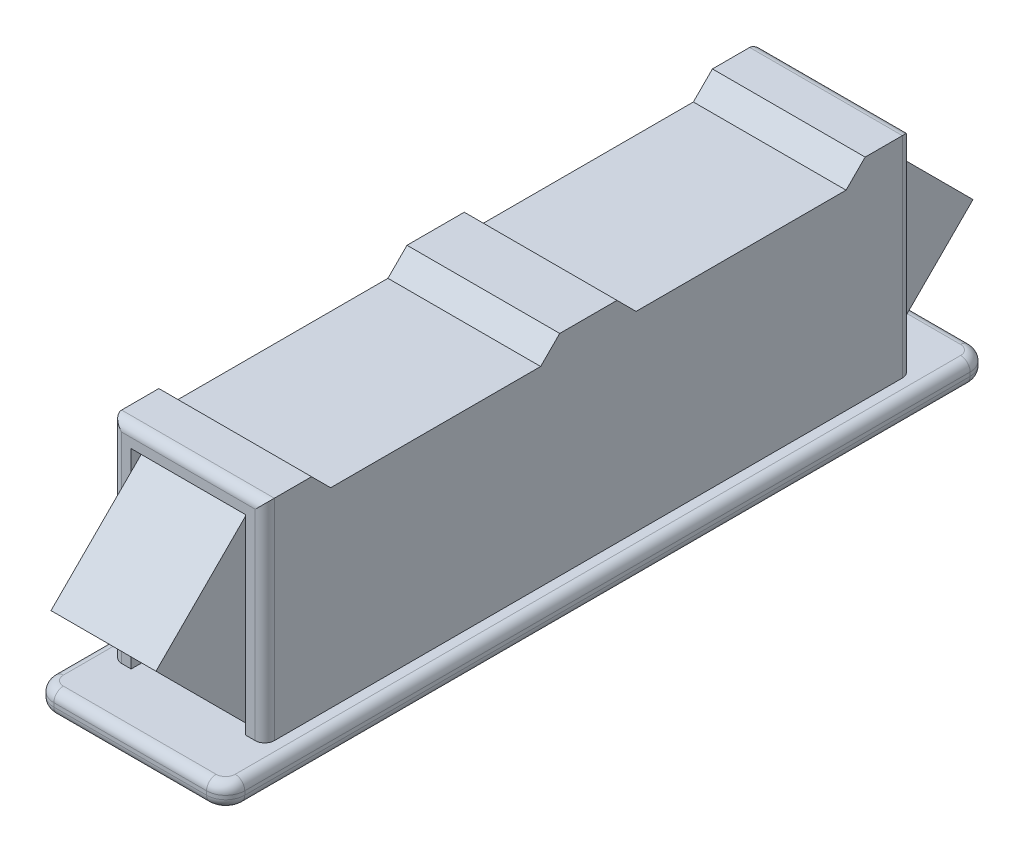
ISO-10303-21;
HEADER;
FILE_DESCRIPTION(('STEP AP214'),'2;1');
FILE_NAME('part.step','',(''),(''),'','','');
FILE_SCHEMA(('AUTOMOTIVE_DESIGN { 1 0 10303 214 1 1 1 1 }'));
ENDSEC;
DATA;
#1=APPLICATION_CONTEXT('core data for automotive mechanical design processes');
#2=APPLICATION_PROTOCOL_DEFINITION('international standard','automotive_design',2000,#1);
#3=PRODUCT_CONTEXT('',#1,'mechanical');
#4=PRODUCT('Part','Part','',(#3));
#5=PRODUCT_RELATED_PRODUCT_CATEGORY('part','',(#4));
#6=PRODUCT_DEFINITION_FORMATION('','',#4);
#7=PRODUCT_DEFINITION_CONTEXT('part definition',#1,'design');
#8=PRODUCT_DEFINITION('design','',#6,#7);
#9=PRODUCT_DEFINITION_SHAPE('','',#8);
#10=(LENGTH_UNIT() NAMED_UNIT(*) SI_UNIT(.MILLI.,.METRE.));
#11=(NAMED_UNIT(*) PLANE_ANGLE_UNIT() SI_UNIT($,.RADIAN.));
#12=(NAMED_UNIT(*) SI_UNIT($,.STERADIAN.) SOLID_ANGLE_UNIT());
#13=UNCERTAINTY_MEASURE_WITH_UNIT(LENGTH_MEASURE(1.E-05),#10,'distance_accuracy_value','');
#14=(GEOMETRIC_REPRESENTATION_CONTEXT(3) GLOBAL_UNCERTAINTY_ASSIGNED_CONTEXT((#13)) GLOBAL_UNIT_ASSIGNED_CONTEXT((#10,
#11,#12)) REPRESENTATION_CONTEXT('',''));
#15=CARTESIAN_POINT('',(0.,0.,0.));
#16=DIRECTION('',(0.,0.,1.));
#17=DIRECTION('',(1.,0.,0.));
#18=AXIS2_PLACEMENT_3D('',#15,#16,#17);
#19=CARTESIAN_POINT('',(0.,11.,0.));
#20=DIRECTION('',(0.,1.,0.));
#21=DIRECTION('',(0.,0.,1.));
#22=AXIS2_PLACEMENT_3D('',#19,#20,#21);
#23=PLANE('',#22);
#24=DIRECTION('',(0.,0.,1.));
#25=VECTOR('',#24,1.);
#26=CARTESIAN_POINT('',(4.,11.,16.95));
#27=LINE('',#26,#25);
#28=CARTESIAN_POINT('',(4.,11.,-1.5));
#29=VERTEX_POINT('',#28);
#30=CARTESIAN_POINT('',(4.,11.,1.5));
#31=VERTEX_POINT('',#30);
#32=EDGE_CURVE('E927',#29,#31,#27,.T.);
#33=ORIENTED_EDGE('',*,*,#32,.F.);
#34=DIRECTION('',(1.,0.,0.));
#35=VECTOR('',#34,1.);
#36=CARTESIAN_POINT('',(-4.,11.,-1.5));
#37=LINE('',#36,#35);
#38=CARTESIAN_POINT('',(-4.,11.,-1.5));
#39=VERTEX_POINT('',#38);
#40=EDGE_CURVE('E687',#39,#29,#37,.T.);
#41=ORIENTED_EDGE('',*,*,#40,.F.);
#42=DIRECTION('',(0.,0.,-1.));
#43=VECTOR('',#42,1.);
#44=CARTESIAN_POINT('',(-4.,11.,16.95));
#45=LINE('',#44,#43);
#46=CARTESIAN_POINT('',(-4.,11.,1.5));
#47=VERTEX_POINT('',#46);
#48=EDGE_CURVE('E670',#47,#39,#45,.T.);
#49=ORIENTED_EDGE('',*,*,#48,.F.);
#50=DIRECTION('',(1.,0.,0.));
#51=VECTOR('',#50,1.);
#52=CARTESIAN_POINT('',(-4.,11.,1.5));
#53=LINE('',#52,#51);
#54=EDGE_CURVE('E707',#47,#31,#53,.T.);
#55=ORIENTED_EDGE('',*,*,#54,.T.);
#56=EDGE_LOOP('',(#33,#41,#49,#55));
#57=FACE_BOUND('',#56,.T.);
#58=ADVANCED_FACE('F42',(#57),#23,.T.);
#59=CARTESIAN_POINT('',(-4.,11.,-14.5));
#60=VERTEX_POINT('',#59);
#61=CARTESIAN_POINT('',(-4.,11.,-16.45));
#62=VERTEX_POINT('',#61);
#63=EDGE_CURVE('E917',#60,#62,#45,.T.);
#64=ORIENTED_EDGE('',*,*,#63,.F.);
#65=DIRECTION('',(1.,0.,0.));
#66=VECTOR('',#65,1.);
#67=CARTESIAN_POINT('',(-4.,11.,-14.5));
#68=LINE('',#67,#66);
#69=CARTESIAN_POINT('',(4.,11.,-14.5));
#70=VERTEX_POINT('',#69);
#71=EDGE_CURVE('E691',#60,#70,#68,.T.);
#72=ORIENTED_EDGE('',*,*,#71,.T.);
#73=CARTESIAN_POINT('',(4.,11.,-16.45));
#74=VERTEX_POINT('',#73);
#75=EDGE_CURVE('E922',#74,#70,#27,.T.);
#76=ORIENTED_EDGE('',*,*,#75,.F.);
#77=DIRECTION('',(1.,0.,0.));
#78=VECTOR('',#77,1.);
#79=CARTESIAN_POINT('',(0.,11.,-16.45));
#80=LINE('',#79,#78);
#81=EDGE_CURVE('E1095',#74,#62,#80,.F.);
#82=ORIENTED_EDGE('',*,*,#81,.T.);
#83=EDGE_LOOP('',(#64,#72,#76,#82));
#84=FACE_BOUND('',#83,.T.);
#85=ADVANCED_FACE('F1865',(#84),#23,.T.);
#86=CARTESIAN_POINT('',(-4.,11.,16.95));
#87=DIRECTION('',(-1.,0.,0.));
#88=DIRECTION('',(0.,0.,1.));
#89=AXIS2_PLACEMENT_3D('',#86,#87,#88);
#90=PLANE('',#89);
#91=ORIENTED_EDGE('',*,*,#48,.T.);
#92=DIRECTION('',(0.,0.707106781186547,0.707106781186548));
#93=VECTOR('',#92,1.);
#94=CARTESIAN_POINT('',(-4.,10.,-2.5));
#95=LINE('',#94,#93);
#96=CARTESIAN_POINT('',(-4.,10.,-2.5));
#97=VERTEX_POINT('',#96);
#98=EDGE_CURVE('E660',#97,#39,#95,.T.);
#99=ORIENTED_EDGE('',*,*,#98,.F.);
#100=DIRECTION('',(0.,0.,1.));
#101=VECTOR('',#100,1.);
#102=CARTESIAN_POINT('',(-4.,10.,-13.5));
#103=LINE('',#102,#101);
#104=CARTESIAN_POINT('',(-4.,10.,-13.5));
#105=VERTEX_POINT('',#104);
#106=EDGE_CURVE('E649',#105,#97,#103,.T.);
#107=ORIENTED_EDGE('',*,*,#106,.F.);
#108=DIRECTION('',(0.,-0.707106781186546,0.707106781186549));
#109=VECTOR('',#108,1.);
#110=CARTESIAN_POINT('',(-4.,11.,-14.5));
#111=LINE('',#110,#109);
#112=EDGE_CURVE('E659',#60,#105,#111,.T.);
#113=ORIENTED_EDGE('',*,*,#112,.F.);
#114=ORIENTED_EDGE('',*,*,#63,.T.);
#115=DIRECTION('',(0.,-1.,0.));
#116=VECTOR('',#115,1.);
#117=CARTESIAN_POINT('',(-4.,11.,-16.45));
#118=LINE('',#117,#116);
#119=CARTESIAN_POINT('',(-4.,0.,-16.45));
#120=VERTEX_POINT('',#119);
#121=EDGE_CURVE('E1078',#62,#120,#118,.T.);
#122=ORIENTED_EDGE('',*,*,#121,.T.);
#123=DIRECTION('',(0.,0.,1.));
#124=VECTOR('',#123,1.);
#125=CARTESIAN_POINT('',(-4.,0.,0.));
#126=LINE('',#125,#124);
#127=CARTESIAN_POINT('',(-4.,0.,16.45));
#128=VERTEX_POINT('',#127);
#129=EDGE_CURVE('E939',#120,#128,#126,.T.);
#130=ORIENTED_EDGE('',*,*,#129,.T.);
#131=DIRECTION('',(0.,-1.,0.));
#132=VECTOR('',#131,1.);
#133=CARTESIAN_POINT('',(-4.,11.,16.45));
#134=LINE('',#133,#132);
#135=CARTESIAN_POINT('',(-4.,11.,16.45));
#136=VERTEX_POINT('',#135);
#137=EDGE_CURVE('E1075',#128,#136,#134,.F.);
#138=ORIENTED_EDGE('',*,*,#137,.T.);
#139=CARTESIAN_POINT('',(-4.,11.,14.5));
#140=VERTEX_POINT('',#139);
#141=EDGE_CURVE('E918',#136,#140,#45,.T.);
#142=ORIENTED_EDGE('',*,*,#141,.T.);
#143=DIRECTION('',(0.,-0.707106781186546,-0.707106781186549));
#144=VECTOR('',#143,1.);
#145=CARTESIAN_POINT('',(-4.,11.,14.5));
#146=LINE('',#145,#144);
#147=CARTESIAN_POINT('',(-4.,10.,13.5));
#148=VERTEX_POINT('',#147);
#149=EDGE_CURVE('E67',#140,#148,#146,.T.);
#150=ORIENTED_EDGE('',*,*,#149,.T.);
#151=DIRECTION('',(0.,0.,-1.));
#152=VECTOR('',#151,1.);
#153=CARTESIAN_POINT('',(-4.,10.,13.5));
#154=LINE('',#153,#152);
#155=CARTESIAN_POINT('',(-4.,10.,2.5));
#156=VERTEX_POINT('',#155);
#157=EDGE_CURVE('E703',#148,#156,#154,.T.);
#158=ORIENTED_EDGE('',*,*,#157,.T.);
#159=DIRECTION('',(0.,0.707106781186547,-0.707106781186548));
#160=VECTOR('',#159,1.);
#161=CARTESIAN_POINT('',(-4.,10.,2.5));
#162=LINE('',#161,#160);
#163=EDGE_CURVE('E697',#156,#47,#162,.T.);
#164=ORIENTED_EDGE('',*,*,#163,.T.);
#165=EDGE_LOOP('',(#91,#99,#107,#113,#114,#122,#130,#138,#142,#150,#158,#164));
#166=FACE_BOUND('',#165,.T.);
#167=ADVANCED_FACE('F667',(#166),#90,.T.);
#168=CARTESIAN_POINT('',(4.,11.,16.95));
#169=DIRECTION('',(1.,0.,0.));
#170=DIRECTION('',(0.,0.,-1.));
#171=AXIS2_PLACEMENT_3D('',#168,#169,#170);
#172=PLANE('',#171);
#173=DIRECTION('',(0.,0.,1.));
#174=VECTOR('',#173,1.);
#175=CARTESIAN_POINT('',(4.,10.,-13.5));
#176=LINE('',#175,#174);
#177=CARTESIAN_POINT('',(4.,10.,-13.5));
#178=VERTEX_POINT('',#177);
#179=CARTESIAN_POINT('',(4.,10.,-2.50000000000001));
#180=VERTEX_POINT('',#179);
#181=EDGE_CURVE('E678',#178,#180,#176,.T.);
#182=ORIENTED_EDGE('',*,*,#181,.T.);
#183=DIRECTION('',(0.,0.707106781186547,0.707106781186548));
#184=VECTOR('',#183,1.);
#185=CARTESIAN_POINT('',(4.,10.,-2.5));
#186=LINE('',#185,#184);
#187=EDGE_CURVE('E59',#180,#29,#186,.T.);
#188=ORIENTED_EDGE('',*,*,#187,.T.);
#189=ORIENTED_EDGE('',*,*,#32,.T.);
#190=DIRECTION('',(0.,0.707106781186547,-0.707106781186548));
#191=VECTOR('',#190,1.);
#192=CARTESIAN_POINT('',(4.,10.,2.5));
#193=LINE('',#192,#191);
#194=CARTESIAN_POINT('',(4.,10.,2.5));
#195=VERTEX_POINT('',#194);
#196=EDGE_CURVE('E690',#195,#31,#193,.T.);
#197=ORIENTED_EDGE('',*,*,#196,.F.);
#198=DIRECTION('',(0.,0.,-1.));
#199=VECTOR('',#198,1.);
#200=CARTESIAN_POINT('',(4.,10.,13.5));
#201=LINE('',#200,#199);
#202=CARTESIAN_POINT('',(4.,10.,13.5));
#203=VERTEX_POINT('',#202);
#204=EDGE_CURVE('E700',#203,#195,#201,.T.);
#205=ORIENTED_EDGE('',*,*,#204,.F.);
#206=DIRECTION('',(0.,-0.707106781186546,-0.707106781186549));
#207=VECTOR('',#206,1.);
#208=CARTESIAN_POINT('',(4.,11.,14.5));
#209=LINE('',#208,#207);
#210=CARTESIAN_POINT('',(4.,11.,14.5));
#211=VERTEX_POINT('',#210);
#212=EDGE_CURVE('E711',#211,#203,#209,.T.);
#213=ORIENTED_EDGE('',*,*,#212,.F.);
#214=CARTESIAN_POINT('',(4.,11.,16.45));
#215=VERTEX_POINT('',#214);
#216=EDGE_CURVE('E921',#211,#215,#27,.T.);
#217=ORIENTED_EDGE('',*,*,#216,.T.);
#218=DIRECTION('',(0.,-1.,0.));
#219=VECTOR('',#218,1.);
#220=CARTESIAN_POINT('',(4.,11.,16.45));
#221=LINE('',#220,#219);
#222=CARTESIAN_POINT('',(4.,0.,16.45));
#223=VERTEX_POINT('',#222);
#224=EDGE_CURVE('E1099',#215,#223,#221,.T.);
#225=ORIENTED_EDGE('',*,*,#224,.T.);
#226=DIRECTION('',(0.,0.,-1.));
#227=VECTOR('',#226,1.);
#228=CARTESIAN_POINT('',(4.,0.,0.));
#229=LINE('',#228,#227);
#230=CARTESIAN_POINT('',(4.,0.,-16.45));
#231=VERTEX_POINT('',#230);
#232=EDGE_CURVE('E931',#223,#231,#229,.T.);
#233=ORIENTED_EDGE('',*,*,#232,.T.);
#234=DIRECTION('',(0.,-1.,0.));
#235=VECTOR('',#234,1.);
#236=CARTESIAN_POINT('',(4.,11.,-16.45));
#237=LINE('',#236,#235);
#238=EDGE_CURVE('E1102',#231,#74,#237,.F.);
#239=ORIENTED_EDGE('',*,*,#238,.T.);
#240=ORIENTED_EDGE('',*,*,#75,.T.);
#241=DIRECTION('',(0.,-0.707106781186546,0.707106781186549));
#242=VECTOR('',#241,1.);
#243=CARTESIAN_POINT('',(4.,11.,-14.5));
#244=LINE('',#243,#242);
#245=EDGE_CURVE('E672',#70,#178,#244,.T.);
#246=ORIENTED_EDGE('',*,*,#245,.T.);
#247=EDGE_LOOP('',(#182,#188,#189,#197,#205,#213,#217,#225,#233,#239,#240,#246));
#248=FACE_BOUND('',#247,.T.);
#249=ADVANCED_FACE('F1827',(#248),#172,.T.);
#250=CARTESIAN_POINT('',(0.,0.,15.45));
#251=DIRECTION('',(0.,0.,1.));
#252=DIRECTION('',(1.,0.,0.));
#253=AXIS2_PLACEMENT_3D('',#250,#251,#252);
#254=PLANE('',#253);
#255=DIRECTION('',(0.,-1.,0.));
#256=VECTOR('',#255,1.);
#257=CARTESIAN_POINT('',(-3.00000000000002,0.,15.45));
#258=LINE('',#257,#256);
#259=CARTESIAN_POINT('',(-3.00000000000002,10.,15.45));
#260=VERTEX_POINT('',#259);
#261=CARTESIAN_POINT('',(-3.00000000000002,0.,15.45));
#262=VERTEX_POINT('',#261);
#263=EDGE_CURVE('E829',#260,#262,#258,.T.);
#264=ORIENTED_EDGE('',*,*,#263,.T.);
#265=DIRECTION('',(1.,0.,0.));
#266=VECTOR('',#265,1.);
#267=CARTESIAN_POINT('',(2.99999999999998,0.,15.45));
#268=LINE('',#267,#266);
#269=CARTESIAN_POINT('',(2.99999999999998,0.,15.45));
#270=VERTEX_POINT('',#269);
#271=EDGE_CURVE('E833',#262,#270,#268,.T.);
#272=ORIENTED_EDGE('',*,*,#271,.T.);
#273=DIRECTION('',(0.,1.,0.));
#274=VECTOR('',#273,1.);
#275=CARTESIAN_POINT('',(2.99999999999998,0.,15.45));
#276=LINE('',#275,#274);
#277=CARTESIAN_POINT('',(2.99999999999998,10.,15.45));
#278=VERTEX_POINT('',#277);
#279=EDGE_CURVE('E838',#270,#278,#276,.T.);
#280=ORIENTED_EDGE('',*,*,#279,.T.);
#281=DIRECTION('',(-1.,0.,0.));
#282=VECTOR('',#281,1.);
#283=CARTESIAN_POINT('',(2.99999999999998,10.,15.45));
#284=LINE('',#283,#282);
#285=EDGE_CURVE('E842',#278,#260,#284,.T.);
#286=ORIENTED_EDGE('',*,*,#285,.T.);
#287=EDGE_LOOP('',(#264,#272,#280,#286));
#288=FACE_BOUND('',#287,.T.);
#289=DIRECTION('',(-1.,0.,0.));
#290=VECTOR('',#289,1.);
#291=CARTESIAN_POINT('',(-2.75,9.95,15.45));
#292=LINE('',#291,#290);
#293=CARTESIAN_POINT('',(2.75,9.95,15.45));
#294=VERTEX_POINT('',#293);
#295=CARTESIAN_POINT('',(-2.75,9.95,15.45));
#296=VERTEX_POINT('',#295);
#297=EDGE_CURVE('E763',#294,#296,#292,.T.);
#298=ORIENTED_EDGE('',*,*,#297,.F.);
#299=DIRECTION('',(0.,1.,0.));
#300=VECTOR('',#299,1.);
#301=CARTESIAN_POINT('',(2.75,0.0500000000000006,15.45));
#302=LINE('',#301,#300);
#303=CARTESIAN_POINT('',(2.75,0.0500000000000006,15.45));
#304=VERTEX_POINT('',#303);
#305=EDGE_CURVE('E759',#304,#294,#302,.T.);
#306=ORIENTED_EDGE('',*,*,#305,.F.);
#307=DIRECTION('',(1.,0.,0.));
#308=VECTOR('',#307,1.);
#309=CARTESIAN_POINT('',(-2.75,0.0500000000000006,15.45));
#310=LINE('',#309,#308);
#311=CARTESIAN_POINT('',(-2.75,0.0500000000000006,15.45));
#312=VERTEX_POINT('',#311);
#313=EDGE_CURVE('E771',#312,#304,#310,.T.);
#314=ORIENTED_EDGE('',*,*,#313,.F.);
#315=DIRECTION('',(0.,-1.,0.));
#316=VECTOR('',#315,1.);
#317=CARTESIAN_POINT('',(-2.75,0.0500000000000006,15.45));
#318=LINE('',#317,#316);
#319=EDGE_CURVE('E767',#296,#312,#318,.T.);
#320=ORIENTED_EDGE('',*,*,#319,.F.);
#321=EDGE_LOOP('',(#298,#306,#314,#320));
#322=FACE_BOUND('',#321,.T.);
#323=ADVANCED_FACE('F1823',(#288,#322),#254,.T.);
#324=CARTESIAN_POINT('',(0.,-1.2,0.));
#325=DIRECTION('',(0.,1.,0.));
#326=DIRECTION('',(0.,0.,1.));
#327=AXIS2_PLACEMENT_3D('',#324,#325,#326);
#328=PLANE('',#327);
#329=DIRECTION('',(-1.,0.,0.));
#330=VECTOR('',#329,1.);
#331=CARTESIAN_POINT('',(-3.25,-1.2,-10.8));
#332=LINE('',#331,#330);
#333=CARTESIAN_POINT('',(-1.94999999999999,-1.2,-10.8));
#334=VERTEX_POINT('',#333);
#335=CARTESIAN_POINT('',(-3.04999999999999,-1.2,-10.8));
#336=VERTEX_POINT('',#335);
#337=EDGE_CURVE('E877',#334,#336,#332,.T.);
#338=ORIENTED_EDGE('',*,*,#337,.T.);
#339=CARTESIAN_POINT('',(-3.04999999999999,-1.2,-10.6));
#340=DIRECTION('',(0.,1.,0.));
#341=DIRECTION('',(0.,0.,1.));
#342=AXIS2_PLACEMENT_3D('',#339,#340,#341);
#343=CIRCLE('',#342,0.2);
#344=CARTESIAN_POINT('',(-3.25,-1.2,-10.6));
#345=VERTEX_POINT('',#344);
#346=EDGE_CURVE('E1669',#336,#345,#343,.T.);
#347=ORIENTED_EDGE('',*,*,#346,.T.);
#348=DIRECTION('',(0.,0.,1.));
#349=VECTOR('',#348,1.);
#350=CARTESIAN_POINT('',(-3.25,-1.2,-1.5));
#351=LINE('',#350,#349);
#352=CARTESIAN_POINT('',(-3.25,-1.2,-1.55));
#353=VERTEX_POINT('',#352);
#354=EDGE_CURVE('E873',#345,#353,#351,.T.);
#355=ORIENTED_EDGE('',*,*,#354,.T.);
#356=CARTESIAN_POINT('',(-3.04999999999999,-1.2,-1.55));
#357=DIRECTION('',(0.,1.,0.));
#358=DIRECTION('',(0.,0.,1.));
#359=AXIS2_PLACEMENT_3D('',#356,#357,#358);
#360=CIRCLE('',#359,0.2);
#361=CARTESIAN_POINT('',(-3.04999999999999,-1.2,-1.35));
#362=VERTEX_POINT('',#361);
#363=EDGE_CURVE('E1672',#353,#362,#360,.T.);
#364=ORIENTED_EDGE('',*,*,#363,.T.);
#365=DIRECTION('',(1.,0.,0.));
#366=VECTOR('',#365,1.);
#367=CARTESIAN_POINT('',(0.,-1.2,-1.35));
#368=LINE('',#367,#366);
#369=CARTESIAN_POINT('',(-1.94999999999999,-1.2,-1.35));
#370=VERTEX_POINT('',#369);
#371=EDGE_CURVE('E1549',#362,#370,#368,.T.);
#372=ORIENTED_EDGE('',*,*,#371,.T.);
#373=CARTESIAN_POINT('',(-1.94999999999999,-1.2,-1.55));
#374=DIRECTION('',(0.,1.,0.));
#375=DIRECTION('',(0.,0.,1.));
#376=AXIS2_PLACEMENT_3D('',#373,#374,#375);
#377=CIRCLE('',#376,0.2);
#378=CARTESIAN_POINT('',(-1.74999999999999,-1.2,-1.55));
#379=VERTEX_POINT('',#378);
#380=EDGE_CURVE('E1663',#370,#379,#377,.T.);
#381=ORIENTED_EDGE('',*,*,#380,.T.);
#382=DIRECTION('',(0.,0.,-1.));
#383=VECTOR('',#382,1.);
#384=CARTESIAN_POINT('',(-1.74999999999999,-1.2,-1.5));
#385=LINE('',#384,#383);
#386=CARTESIAN_POINT('',(-1.75,-1.2,-10.6));
#387=VERTEX_POINT('',#386);
#388=EDGE_CURVE('E860',#379,#387,#385,.T.);
#389=ORIENTED_EDGE('',*,*,#388,.T.);
#390=CARTESIAN_POINT('',(-1.94999999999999,-1.2,-10.6));
#391=DIRECTION('',(0.,1.,0.));
#392=DIRECTION('',(0.,0.,1.));
#393=AXIS2_PLACEMENT_3D('',#390,#391,#392);
#394=CIRCLE('',#393,0.2);
#395=EDGE_CURVE('E1666',#387,#334,#394,.T.);
#396=ORIENTED_EDGE('',*,*,#395,.T.);
#397=EDGE_LOOP('',(#338,#347,#355,#364,#372,#381,#389,#396));
#398=FACE_BOUND('',#397,.T.);
#399=DIRECTION('',(1.,0.,0.));
#400=VECTOR('',#399,1.);
#401=CARTESIAN_POINT('',(0.,-1.2,1.35));
#402=LINE('',#401,#400);
#403=CARTESIAN_POINT('',(-3.04999999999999,-1.2,1.35));
#404=VERTEX_POINT('',#403);
#405=CARTESIAN_POINT('',(-1.94999999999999,-1.2,1.35));
#406=VERTEX_POINT('',#405);
#407=EDGE_CURVE('E1127',#404,#406,#402,.T.);
#408=ORIENTED_EDGE('',*,*,#407,.F.);
#409=CARTESIAN_POINT('',(-3.04999999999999,-1.2,1.55));
#410=DIRECTION('',(0.,1.,0.));
#411=DIRECTION('',(0.,0.,1.));
#412=AXIS2_PLACEMENT_3D('',#409,#410,#411);
#413=CIRCLE('',#412,0.2);
#414=CARTESIAN_POINT('',(-3.25,-1.2,1.55));
#415=VERTEX_POINT('',#414);
#416=EDGE_CURVE('E1291',#404,#415,#413,.T.);
#417=ORIENTED_EDGE('',*,*,#416,.T.);
#418=DIRECTION('',(0.,0.,-1.));
#419=VECTOR('',#418,1.);
#420=CARTESIAN_POINT('',(-3.25,-1.2,1.5));
#421=LINE('',#420,#419);
#422=CARTESIAN_POINT('',(-3.25,-1.2,10.6));
#423=VERTEX_POINT('',#422);
#424=EDGE_CURVE('E913',#423,#415,#421,.T.);
#425=ORIENTED_EDGE('',*,*,#424,.F.);
#426=CARTESIAN_POINT('',(-3.04999999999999,-1.2,10.6));
#427=DIRECTION('',(0.,1.,0.));
#428=DIRECTION('',(0.,0.,1.));
#429=AXIS2_PLACEMENT_3D('',#426,#427,#428);
#430=CIRCLE('',#429,0.2);
#431=CARTESIAN_POINT('',(-3.04999999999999,-1.2,10.8));
#432=VERTEX_POINT('',#431);
#433=EDGE_CURVE('E1294',#423,#432,#430,.T.);
#434=ORIENTED_EDGE('',*,*,#433,.T.);
#435=DIRECTION('',(-1.,0.,0.));
#436=VECTOR('',#435,1.);
#437=CARTESIAN_POINT('',(-3.25,-1.2,10.8));
#438=LINE('',#437,#436);
#439=CARTESIAN_POINT('',(-1.94999999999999,-1.2,10.8));
#440=VERTEX_POINT('',#439);
#441=EDGE_CURVE('E909',#440,#432,#438,.T.);
#442=ORIENTED_EDGE('',*,*,#441,.F.);
#443=CARTESIAN_POINT('',(-1.94999999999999,-1.2,10.6));
#444=DIRECTION('',(0.,1.,0.));
#445=DIRECTION('',(0.,0.,1.));
#446=AXIS2_PLACEMENT_3D('',#443,#444,#445);
#447=CIRCLE('',#446,0.2);
#448=CARTESIAN_POINT('',(-1.75,-1.2,10.6));
#449=VERTEX_POINT('',#448);
#450=EDGE_CURVE('E1288',#440,#449,#447,.T.);
#451=ORIENTED_EDGE('',*,*,#450,.T.);
#452=DIRECTION('',(0.,0.,1.));
#453=VECTOR('',#452,1.);
#454=CARTESIAN_POINT('',(-1.74999999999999,-1.2,1.5));
#455=LINE('',#454,#453);
#456=CARTESIAN_POINT('',(-1.74999999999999,-1.2,1.55));
#457=VERTEX_POINT('',#456);
#458=EDGE_CURVE('E905',#457,#449,#455,.T.);
#459=ORIENTED_EDGE('',*,*,#458,.F.);
#460=CARTESIAN_POINT('',(-1.94999999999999,-1.2,1.55));
#461=DIRECTION('',(0.,1.,0.));
#462=DIRECTION('',(0.,0.,1.));
#463=AXIS2_PLACEMENT_3D('',#460,#461,#462);
#464=CIRCLE('',#463,0.2);
#465=EDGE_CURVE('E1285',#457,#406,#464,.T.);
#466=ORIENTED_EDGE('',*,*,#465,.T.);
#467=EDGE_LOOP('',(#408,#417,#425,#434,#442,#451,#459,#466));
#468=FACE_BOUND('',#467,.T.);
#469=DIRECTION('',(0.,0.,-1.));
#470=VECTOR('',#469,1.);
#471=CARTESIAN_POINT('',(4.5,-1.2,19.));
#472=LINE('',#471,#470);
#473=CARTESIAN_POINT('',(4.5,-1.2,-19.));
#474=VERTEX_POINT('',#473);
#475=CARTESIAN_POINT('',(4.5,-1.2,19.));
#476=VERTEX_POINT('',#475);
#477=EDGE_CURVE('E975',#474,#476,#472,.F.);
#478=ORIENTED_EDGE('',*,*,#477,.T.);
#479=CARTESIAN_POINT('',(4.,-1.2,19.));
#480=DIRECTION('',(0.,1.,0.));
#481=DIRECTION('',(0.,0.,1.));
#482=AXIS2_PLACEMENT_3D('',#479,#480,#481);
#483=CIRCLE('',#482,0.5);
#484=CARTESIAN_POINT('',(4.,-1.2,19.5));
#485=VERTEX_POINT('',#484);
#486=EDGE_CURVE('E996',#476,#485,#483,.F.);
#487=ORIENTED_EDGE('',*,*,#486,.T.);
#488=DIRECTION('',(1.,0.,0.));
#489=VECTOR('',#488,1.);
#490=CARTESIAN_POINT('',(-4.,-1.2,19.5));
#491=LINE('',#490,#489);
#492=CARTESIAN_POINT('',(-4.,-1.2,19.5));
#493=VERTEX_POINT('',#492);
#494=EDGE_CURVE('E993',#485,#493,#491,.F.);
#495=ORIENTED_EDGE('',*,*,#494,.T.);
#496=CARTESIAN_POINT('',(-4.,-1.2,19.));
#497=DIRECTION('',(0.,1.,0.));
#498=DIRECTION('',(0.,0.,1.));
#499=AXIS2_PLACEMENT_3D('',#496,#497,#498);
#500=CIRCLE('',#499,0.5);
#501=CARTESIAN_POINT('',(-4.5,-1.2,19.));
#502=VERTEX_POINT('',#501);
#503=EDGE_CURVE('E990',#493,#502,#500,.F.);
#504=ORIENTED_EDGE('',*,*,#503,.T.);
#505=DIRECTION('',(0.,0.,1.));
#506=VECTOR('',#505,1.);
#507=CARTESIAN_POINT('',(-4.5,-1.2,-19.));
#508=LINE('',#507,#506);
#509=CARTESIAN_POINT('',(-4.5,-1.2,-19.));
#510=VERTEX_POINT('',#509);
#511=EDGE_CURVE('E987',#502,#510,#508,.F.);
#512=ORIENTED_EDGE('',*,*,#511,.T.);
#513=CARTESIAN_POINT('',(-4.,-1.2,-19.));
#514=DIRECTION('',(0.,1.,0.));
#515=DIRECTION('',(0.,0.,1.));
#516=AXIS2_PLACEMENT_3D('',#513,#514,#515);
#517=CIRCLE('',#516,0.5);
#518=CARTESIAN_POINT('',(-4.,-1.2,-19.5));
#519=VERTEX_POINT('',#518);
#520=EDGE_CURVE('E984',#510,#519,#517,.F.);
#521=ORIENTED_EDGE('',*,*,#520,.T.);
#522=DIRECTION('',(-1.,0.,0.));
#523=VECTOR('',#522,1.);
#524=CARTESIAN_POINT('',(4.,-1.2,-19.5));
#525=LINE('',#524,#523);
#526=CARTESIAN_POINT('',(4.,-1.2,-19.5));
#527=VERTEX_POINT('',#526);
#528=EDGE_CURVE('E981',#519,#527,#525,.F.);
#529=ORIENTED_EDGE('',*,*,#528,.T.);
#530=CARTESIAN_POINT('',(4.,-1.2,-19.));
#531=DIRECTION('',(0.,1.,0.));
#532=DIRECTION('',(0.,0.,1.));
#533=AXIS2_PLACEMENT_3D('',#530,#531,#532);
#534=CIRCLE('',#533,0.5);
#535=EDGE_CURVE('E978',#527,#474,#534,.F.);
#536=ORIENTED_EDGE('',*,*,#535,.T.);
#537=EDGE_LOOP('',(#478,#487,#495,#504,#512,#521,#529,#536));
#538=FACE_BOUND('',#537,.T.);
#539=DIRECTION('',(1.,0.,0.));
#540=VECTOR('',#539,1.);
#541=CARTESIAN_POINT('',(3.25,-1.2,10.8));
#542=LINE('',#541,#540);
#543=CARTESIAN_POINT('',(1.94999999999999,-1.2,10.8));
#544=VERTEX_POINT('',#543);
#545=CARTESIAN_POINT('',(3.04999999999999,-1.2,10.8));
#546=VERTEX_POINT('',#545);
#547=EDGE_CURVE('E901',#544,#546,#542,.T.);
#548=ORIENTED_EDGE('',*,*,#547,.T.);
#549=CARTESIAN_POINT('',(3.04999999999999,-1.2,10.6));
#550=DIRECTION('',(0.,1.,0.));
#551=DIRECTION('',(0.,0.,1.));
#552=AXIS2_PLACEMENT_3D('',#549,#550,#551);
#553=CIRCLE('',#552,0.2);
#554=CARTESIAN_POINT('',(3.25,-1.2,10.6));
#555=VERTEX_POINT('',#554);
#556=EDGE_CURVE('E1417',#546,#555,#553,.T.);
#557=ORIENTED_EDGE('',*,*,#556,.T.);
#558=DIRECTION('',(0.,0.,-1.));
#559=VECTOR('',#558,1.);
#560=CARTESIAN_POINT('',(3.25,-1.2,1.5));
#561=LINE('',#560,#559);
#562=CARTESIAN_POINT('',(3.25,-1.2,1.55));
#563=VERTEX_POINT('',#562);
#564=EDGE_CURVE('E897',#555,#563,#561,.T.);
#565=ORIENTED_EDGE('',*,*,#564,.T.);
#566=CARTESIAN_POINT('',(3.04999999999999,-1.2,1.55));
#567=DIRECTION('',(0.,1.,0.));
#568=DIRECTION('',(0.,0.,1.));
#569=AXIS2_PLACEMENT_3D('',#566,#567,#568);
#570=CIRCLE('',#569,0.2);
#571=CARTESIAN_POINT('',(3.04999999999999,-1.2,1.35));
#572=VERTEX_POINT('',#571);
#573=EDGE_CURVE('E1420',#563,#572,#570,.T.);
#574=ORIENTED_EDGE('',*,*,#573,.T.);
#575=DIRECTION('',(-1.,0.,0.));
#576=VECTOR('',#575,1.);
#577=CARTESIAN_POINT('',(0.,-1.2,1.35));
#578=LINE('',#577,#576);
#579=CARTESIAN_POINT('',(1.94999999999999,-1.2,1.35));
#580=VERTEX_POINT('',#579);
#581=EDGE_CURVE('E1297',#572,#580,#578,.T.);
#582=ORIENTED_EDGE('',*,*,#581,.T.);
#583=CARTESIAN_POINT('',(1.94999999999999,-1.2,1.55));
#584=DIRECTION('',(0.,1.,0.));
#585=DIRECTION('',(0.,0.,1.));
#586=AXIS2_PLACEMENT_3D('',#583,#584,#585);
#587=CIRCLE('',#586,0.2);
#588=CARTESIAN_POINT('',(1.74999999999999,-1.2,1.55));
#589=VERTEX_POINT('',#588);
#590=EDGE_CURVE('E1411',#580,#589,#587,.T.);
#591=ORIENTED_EDGE('',*,*,#590,.T.);
#592=DIRECTION('',(0.,0.,1.));
#593=VECTOR('',#592,1.);
#594=CARTESIAN_POINT('',(1.74999999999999,-1.2,1.5));
#595=LINE('',#594,#593);
#596=CARTESIAN_POINT('',(1.75,-1.2,10.6));
#597=VERTEX_POINT('',#596);
#598=EDGE_CURVE('E893',#589,#597,#595,.T.);
#599=ORIENTED_EDGE('',*,*,#598,.T.);
#600=CARTESIAN_POINT('',(1.94999999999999,-1.2,10.6));
#601=DIRECTION('',(0.,1.,0.));
#602=DIRECTION('',(0.,0.,1.));
#603=AXIS2_PLACEMENT_3D('',#600,#601,#602);
#604=CIRCLE('',#603,0.2);
#605=EDGE_CURVE('E1414',#597,#544,#604,.T.);
#606=ORIENTED_EDGE('',*,*,#605,.T.);
#607=EDGE_LOOP('',(#548,#557,#565,#574,#582,#591,#599,#606));
#608=FACE_BOUND('',#607,.T.);
#609=DIRECTION('',(-1.,0.,0.));
#610=VECTOR('',#609,1.);
#611=CARTESIAN_POINT('',(0.,-1.2,-1.35));
#612=LINE('',#611,#610);
#613=CARTESIAN_POINT('',(3.04999999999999,-1.2,-1.35));
#614=VERTEX_POINT('',#613);
#615=CARTESIAN_POINT('',(1.94999999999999,-1.2,-1.35));
#616=VERTEX_POINT('',#615);
#617=EDGE_CURVE('E1423',#614,#616,#612,.T.);
#618=ORIENTED_EDGE('',*,*,#617,.F.);
#619=CARTESIAN_POINT('',(3.04999999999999,-1.2,-1.55));
#620=DIRECTION('',(0.,1.,0.));
#621=DIRECTION('',(0.,0.,1.));
#622=AXIS2_PLACEMENT_3D('',#619,#620,#621);
#623=CIRCLE('',#622,0.2);
#624=CARTESIAN_POINT('',(3.25,-1.2,-1.55));
#625=VERTEX_POINT('',#624);
#626=EDGE_CURVE('E1543',#614,#625,#623,.T.);
#627=ORIENTED_EDGE('',*,*,#626,.T.);
#628=DIRECTION('',(0.,0.,1.));
#629=VECTOR('',#628,1.);
#630=CARTESIAN_POINT('',(3.25,-1.2,-1.5));
#631=LINE('',#630,#629);
#632=CARTESIAN_POINT('',(3.25,-1.2,-10.6));
#633=VERTEX_POINT('',#632);
#634=EDGE_CURVE('E889',#633,#625,#631,.T.);
#635=ORIENTED_EDGE('',*,*,#634,.F.);
#636=CARTESIAN_POINT('',(3.04999999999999,-1.2,-10.6));
#637=DIRECTION('',(0.,1.,0.));
#638=DIRECTION('',(0.,0.,1.));
#639=AXIS2_PLACEMENT_3D('',#636,#637,#638);
#640=CIRCLE('',#639,0.2);
#641=CARTESIAN_POINT('',(3.04999999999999,-1.2,-10.8));
#642=VERTEX_POINT('',#641);
#643=EDGE_CURVE('E1546',#633,#642,#640,.T.);
#644=ORIENTED_EDGE('',*,*,#643,.T.);
#645=DIRECTION('',(1.,0.,0.));
#646=VECTOR('',#645,1.);
#647=CARTESIAN_POINT('',(3.25,-1.2,-10.8));
#648=LINE('',#647,#646);
#649=CARTESIAN_POINT('',(1.94999999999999,-1.2,-10.8));
#650=VERTEX_POINT('',#649);
#651=EDGE_CURVE('E885',#650,#642,#648,.T.);
#652=ORIENTED_EDGE('',*,*,#651,.F.);
#653=CARTESIAN_POINT('',(1.94999999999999,-1.2,-10.6));
#654=DIRECTION('',(0.,1.,0.));
#655=DIRECTION('',(0.,0.,1.));
#656=AXIS2_PLACEMENT_3D('',#653,#654,#655);
#657=CIRCLE('',#656,0.2);
#658=CARTESIAN_POINT('',(1.75,-1.2,-10.6));
#659=VERTEX_POINT('',#658);
#660=EDGE_CURVE('E1540',#650,#659,#657,.T.);
#661=ORIENTED_EDGE('',*,*,#660,.T.);
#662=DIRECTION('',(0.,0.,-1.));
#663=VECTOR('',#662,1.);
#664=CARTESIAN_POINT('',(1.74999999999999,-1.2,-1.5));
#665=LINE('',#664,#663);
#666=CARTESIAN_POINT('',(1.74999999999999,-1.2,-1.55));
#667=VERTEX_POINT('',#666);
#668=EDGE_CURVE('E881',#667,#659,#665,.T.);
#669=ORIENTED_EDGE('',*,*,#668,.F.);
#670=CARTESIAN_POINT('',(1.94999999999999,-1.2,-1.55));
#671=DIRECTION('',(0.,1.,0.));
#672=DIRECTION('',(0.,0.,1.));
#673=AXIS2_PLACEMENT_3D('',#670,#671,#672);
#674=CIRCLE('',#673,0.2);
#675=EDGE_CURVE('E1537',#667,#616,#674,.T.);
#676=ORIENTED_EDGE('',*,*,#675,.T.);
#677=EDGE_LOOP('',(#618,#627,#635,#644,#652,#661,#669,#676));
#678=FACE_BOUND('',#677,.T.);
#679=ADVANCED_FACE('F1826',(#398,#468,#538,#608,#678),#328,.F.);
#680=CARTESIAN_POINT('',(4.,11.,-16.95));
#681=DIRECTION('',(0.,0.,-1.));
#682=DIRECTION('',(-1.,0.,0.));
#683=AXIS2_PLACEMENT_3D('',#680,#681,#682);
#684=PLANE('',#683);
#685=DIRECTION('',(-1.,0.,0.));
#686=VECTOR('',#685,1.);
#687=CARTESIAN_POINT('',(0.,0.,-16.95));
#688=LINE('',#687,#686);
#689=CARTESIAN_POINT('',(-3.00000000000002,0.,-16.95));
#690=VERTEX_POINT('',#689);
#691=CARTESIAN_POINT('',(-3.5,0.,-16.95));
#692=VERTEX_POINT('',#691);
#693=EDGE_CURVE('E926',#690,#692,#688,.T.);
#694=ORIENTED_EDGE('',*,*,#693,.T.);
#695=DIRECTION('',(0.,-1.,0.));
#696=VECTOR('',#695,1.);
#697=CARTESIAN_POINT('',(-3.5,11.,-16.95));
#698=LINE('',#697,#696);
#699=CARTESIAN_POINT('',(-3.5,10.5,-16.95));
#700=VERTEX_POINT('',#699);
#701=EDGE_CURVE('E1088',#692,#700,#698,.F.);
#702=ORIENTED_EDGE('',*,*,#701,.T.);
#703=DIRECTION('',(1.,0.,0.));
#704=VECTOR('',#703,1.);
#705=CARTESIAN_POINT('',(4.,10.5,-16.95));
#706=LINE('',#705,#704);
#707=CARTESIAN_POINT('',(3.5,10.5,-16.95));
#708=VERTEX_POINT('',#707);
#709=EDGE_CURVE('E1085',#700,#708,#706,.T.);
#710=ORIENTED_EDGE('',*,*,#709,.T.);
#711=DIRECTION('',(0.,-1.,0.));
#712=VECTOR('',#711,1.);
#713=CARTESIAN_POINT('',(3.5,11.,-16.95));
#714=LINE('',#713,#712);
#715=CARTESIAN_POINT('',(3.5,0.,-16.95));
#716=VERTEX_POINT('',#715);
#717=EDGE_CURVE('E1082',#708,#716,#714,.T.);
#718=ORIENTED_EDGE('',*,*,#717,.T.);
#719=CARTESIAN_POINT('',(2.99999999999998,0.,-16.95));
#720=VERTEX_POINT('',#719);
#721=EDGE_CURVE('E928',#716,#720,#688,.T.);
#722=ORIENTED_EDGE('',*,*,#721,.T.);
#723=DIRECTION('',(0.,1.,0.));
#724=VECTOR('',#723,1.);
#725=CARTESIAN_POINT('',(2.99999999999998,0.,-16.95));
#726=LINE('',#725,#724);
#727=CARTESIAN_POINT('',(2.99999999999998,10.,-16.95));
#728=VERTEX_POINT('',#727);
#729=EDGE_CURVE('E793',#720,#728,#726,.T.);
#730=ORIENTED_EDGE('',*,*,#729,.T.);
#731=DIRECTION('',(-1.,0.,0.));
#732=VECTOR('',#731,1.);
#733=CARTESIAN_POINT('',(2.99999999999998,10.,-16.95));
#734=LINE('',#733,#732);
#735=CARTESIAN_POINT('',(-3.00000000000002,10.,-16.95));
#736=VERTEX_POINT('',#735);
#737=EDGE_CURVE('E807',#728,#736,#734,.T.);
#738=ORIENTED_EDGE('',*,*,#737,.T.);
#739=DIRECTION('',(0.,-1.,0.));
#740=VECTOR('',#739,1.);
#741=CARTESIAN_POINT('',(-3.00000000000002,0.,-16.95));
#742=LINE('',#741,#740);
#743=EDGE_CURVE('E803',#736,#690,#742,.T.);
#744=ORIENTED_EDGE('',*,*,#743,.T.);
#745=EDGE_LOOP('',(#694,#702,#710,#718,#722,#730,#738,#744));
#746=FACE_BOUND('',#745,.T.);
#747=ADVANCED_FACE('F3108',(#746),#684,.T.);
#748=CARTESIAN_POINT('',(-5.,-1.2,20.));
#749=DIRECTION('',(-1.,0.,0.));
#750=DIRECTION('',(0.,0.,1.));
#751=AXIS2_PLACEMENT_3D('',#748,#749,#750);
#752=PLANE('',#751);
#753=DIRECTION('',(0.,1.,0.));
#754=VECTOR('',#753,1.);
#755=CARTESIAN_POINT('',(-5.,-1.2,-19.));
#756=LINE('',#755,#754);
#757=CARTESIAN_POINT('',(-5.,-0.5,-19.));
#758=VERTEX_POINT('',#757);
#759=CARTESIAN_POINT('',(-5.,-0.7,-19.));
#760=VERTEX_POINT('',#759);
#761=EDGE_CURVE('E955',#758,#760,#756,.F.);
#762=ORIENTED_EDGE('',*,*,#761,.T.);
#763=DIRECTION('',(0.,0.,1.));
#764=VECTOR('',#763,1.);
#765=CARTESIAN_POINT('',(-5.,-0.7,19.));
#766=LINE('',#765,#764);
#767=CARTESIAN_POINT('',(-5.,-0.7,19.));
#768=VERTEX_POINT('',#767);
#769=EDGE_CURVE('E1023',#760,#768,#766,.T.);
#770=ORIENTED_EDGE('',*,*,#769,.T.);
#771=DIRECTION('',(0.,1.,0.));
#772=VECTOR('',#771,1.);
#773=CARTESIAN_POINT('',(-5.,-1.2,19.));
#774=LINE('',#773,#772);
#775=CARTESIAN_POINT('',(-5.,-0.5,19.));
#776=VERTEX_POINT('',#775);
#777=EDGE_CURVE('E951',#768,#776,#774,.T.);
#778=ORIENTED_EDGE('',*,*,#777,.T.);
#779=DIRECTION('',(0.,0.,1.));
#780=VECTOR('',#779,1.);
#781=CARTESIAN_POINT('',(-5.,-0.5,20.));
#782=LINE('',#781,#780);
#783=EDGE_CURVE('E1020',#776,#758,#782,.F.);
#784=ORIENTED_EDGE('',*,*,#783,.T.);
#785=EDGE_LOOP('',(#762,#770,#778,#784));
#786=FACE_BOUND('',#785,.T.);
#787=ADVANCED_FACE('F3416',(#786),#752,.T.);
#788=CARTESIAN_POINT('',(5.,-1.2,-20.));
#789=DIRECTION('',(0.,0.,-1.));
#790=DIRECTION('',(-1.,0.,0.));
#791=AXIS2_PLACEMENT_3D('',#788,#789,#790);
#792=PLANE('',#791);
#793=DIRECTION('',(0.,1.,0.));
#794=VECTOR('',#793,1.);
#795=CARTESIAN_POINT('',(4.,-1.2,-20.));
#796=LINE('',#795,#794);
#797=CARTESIAN_POINT('',(4.,-0.5,-20.));
#798=VERTEX_POINT('',#797);
#799=CARTESIAN_POINT('',(4.,-0.7,-20.));
#800=VERTEX_POINT('',#799);
#801=EDGE_CURVE('E943',#798,#800,#796,.F.);
#802=ORIENTED_EDGE('',*,*,#801,.T.);
#803=DIRECTION('',(-1.,0.,0.));
#804=VECTOR('',#803,1.);
#805=CARTESIAN_POINT('',(-4.,-0.7,-20.));
#806=LINE('',#805,#804);
#807=CARTESIAN_POINT('',(-4.,-0.7,-20.));
#808=VERTEX_POINT('',#807);
#809=EDGE_CURVE('E1035',#800,#808,#806,.T.);
#810=ORIENTED_EDGE('',*,*,#809,.T.);
#811=DIRECTION('',(0.,1.,0.));
#812=VECTOR('',#811,1.);
#813=CARTESIAN_POINT('',(-4.,-1.2,-20.));
#814=LINE('',#813,#812);
#815=CARTESIAN_POINT('',(-4.,-0.5,-20.));
#816=VERTEX_POINT('',#815);
#817=EDGE_CURVE('E947',#808,#816,#814,.T.);
#818=ORIENTED_EDGE('',*,*,#817,.T.);
#819=DIRECTION('',(-1.,0.,0.));
#820=VECTOR('',#819,1.);
#821=CARTESIAN_POINT('',(5.,-0.5,-20.));
#822=LINE('',#821,#820);
#823=EDGE_CURVE('E1032',#816,#798,#822,.F.);
#824=ORIENTED_EDGE('',*,*,#823,.T.);
#825=EDGE_LOOP('',(#802,#810,#818,#824));
#826=FACE_BOUND('',#825,.T.);
#827=ADVANCED_FACE('F3406',(#826),#792,.T.);
#828=CARTESIAN_POINT('',(5.,-1.2,20.));
#829=DIRECTION('',(1.,0.,0.));
#830=DIRECTION('',(0.,0.,-1.));
#831=AXIS2_PLACEMENT_3D('',#828,#829,#830);
#832=PLANE('',#831);
#833=DIRECTION('',(0.,1.,0.));
#834=VECTOR('',#833,1.);
#835=CARTESIAN_POINT('',(5.,-1.2,-19.));
#836=LINE('',#835,#834);
#837=CARTESIAN_POINT('',(5.,-0.7,-19.));
#838=VERTEX_POINT('',#837);
#839=CARTESIAN_POINT('',(5.,-0.5,-19.));
#840=VERTEX_POINT('',#839);
#841=EDGE_CURVE('E963',#838,#840,#836,.T.);
#842=ORIENTED_EDGE('',*,*,#841,.T.);
#843=DIRECTION('',(0.,0.,-1.));
#844=VECTOR('',#843,1.);
#845=CARTESIAN_POINT('',(5.,-0.5,20.));
#846=LINE('',#845,#844);
#847=CARTESIAN_POINT('',(5.,-0.5,19.));
#848=VERTEX_POINT('',#847);
#849=EDGE_CURVE('E1072',#840,#848,#846,.F.);
#850=ORIENTED_EDGE('',*,*,#849,.T.);
#851=DIRECTION('',(0.,1.,0.));
#852=VECTOR('',#851,1.);
#853=CARTESIAN_POINT('',(5.,-1.2,19.));
#854=LINE('',#853,#852);
#855=CARTESIAN_POINT('',(5.,-0.7,19.));
#856=VERTEX_POINT('',#855);
#857=EDGE_CURVE('E959',#848,#856,#854,.F.);
#858=ORIENTED_EDGE('',*,*,#857,.T.);
#859=DIRECTION('',(0.,0.,-1.));
#860=VECTOR('',#859,1.);
#861=CARTESIAN_POINT('',(5.,-0.7,-19.));
#862=LINE('',#861,#860);
#863=EDGE_CURVE('E1069',#856,#838,#862,.T.);
#864=ORIENTED_EDGE('',*,*,#863,.T.);
#865=EDGE_LOOP('',(#842,#850,#858,#864));
#866=FACE_BOUND('',#865,.T.);
#867=ADVANCED_FACE('F3396',(#866),#832,.T.);
#868=CARTESIAN_POINT('',(5.,-1.2,20.));
#869=DIRECTION('',(0.,0.,1.));
#870=DIRECTION('',(1.,0.,0.));
#871=AXIS2_PLACEMENT_3D('',#868,#869,#870);
#872=PLANE('',#871);
#873=DIRECTION('',(0.,1.,0.));
#874=VECTOR('',#873,1.);
#875=CARTESIAN_POINT('',(-4.,-1.2,20.));
#876=LINE('',#875,#874);
#877=CARTESIAN_POINT('',(-4.,-0.5,20.));
#878=VERTEX_POINT('',#877);
#879=CARTESIAN_POINT('',(-4.,-0.7,20.));
#880=VERTEX_POINT('',#879);
#881=EDGE_CURVE('E971',#878,#880,#876,.F.);
#882=ORIENTED_EDGE('',*,*,#881,.T.);
#883=DIRECTION('',(1.,0.,0.));
#884=VECTOR('',#883,1.);
#885=CARTESIAN_POINT('',(4.,-0.7,20.));
#886=LINE('',#885,#884);
#887=CARTESIAN_POINT('',(4.,-0.7,20.));
#888=VERTEX_POINT('',#887);
#889=EDGE_CURVE('E1010',#880,#888,#886,.T.);
#890=ORIENTED_EDGE('',*,*,#889,.T.);
#891=DIRECTION('',(0.,1.,0.));
#892=VECTOR('',#891,1.);
#893=CARTESIAN_POINT('',(4.,-1.2,20.));
#894=LINE('',#893,#892);
#895=CARTESIAN_POINT('',(4.,-0.5,20.));
#896=VERTEX_POINT('',#895);
#897=EDGE_CURVE('E967',#888,#896,#894,.T.);
#898=ORIENTED_EDGE('',*,*,#897,.T.);
#899=DIRECTION('',(1.,0.,0.));
#900=VECTOR('',#899,1.);
#901=CARTESIAN_POINT('',(5.,-0.5,20.));
#902=LINE('',#901,#900);
#903=EDGE_CURVE('E1007',#896,#878,#902,.F.);
#904=ORIENTED_EDGE('',*,*,#903,.T.);
#905=EDGE_LOOP('',(#882,#890,#898,#904));
#906=FACE_BOUND('',#905,.T.);
#907=ADVANCED_FACE('F3383',(#906),#872,.T.);
#908=CARTESIAN_POINT('',(0.,0.,0.));
#909=DIRECTION('',(0.,1.,0.));
#910=DIRECTION('',(0.,0.,1.));
#911=AXIS2_PLACEMENT_3D('',#908,#909,#910);
#912=PLANE('',#911);
#913=DIRECTION('',(0.,0.,1.));
#914=VECTOR('',#913,1.);
#915=CARTESIAN_POINT('',(-4.5,0.,0.));
#916=LINE('',#915,#914);
#917=CARTESIAN_POINT('',(-4.5,0.,-19.));
#918=VERTEX_POINT('',#917);
#919=CARTESIAN_POINT('',(-4.5,0.,19.));
#920=VERTEX_POINT('',#919);
#921=EDGE_CURVE('E1062',#918,#920,#916,.T.);
#922=ORIENTED_EDGE('',*,*,#921,.T.);
#923=CARTESIAN_POINT('',(-4.,0.,19.));
#924=DIRECTION('',(0.,1.,0.));
#925=DIRECTION('',(0.,0.,1.));
#926=AXIS2_PLACEMENT_3D('',#923,#924,#925);
#927=CIRCLE('',#926,0.5);
#928=CARTESIAN_POINT('',(-4.,0.,19.5));
#929=VERTEX_POINT('',#928);
#930=EDGE_CURVE('E1065',#920,#929,#927,.T.);
#931=ORIENTED_EDGE('',*,*,#930,.T.);
#932=DIRECTION('',(1.,0.,0.));
#933=VECTOR('',#932,1.);
#934=CARTESIAN_POINT('',(0.,0.,19.5));
#935=LINE('',#934,#933);
#936=CARTESIAN_POINT('',(4.,0.,19.5));
#937=VERTEX_POINT('',#936);
#938=EDGE_CURVE('E1044',#929,#937,#935,.T.);
#939=ORIENTED_EDGE('',*,*,#938,.T.);
#940=CARTESIAN_POINT('',(4.,0.,19.));
#941=DIRECTION('',(0.,1.,0.));
#942=DIRECTION('',(0.,0.,1.));
#943=AXIS2_PLACEMENT_3D('',#940,#941,#942);
#944=CIRCLE('',#943,0.5);
#945=CARTESIAN_POINT('',(4.5,0.,19.));
#946=VERTEX_POINT('',#945);
#947=EDGE_CURVE('E1047',#937,#946,#944,.T.);
#948=ORIENTED_EDGE('',*,*,#947,.T.);
#949=DIRECTION('',(0.,0.,-1.));
#950=VECTOR('',#949,1.);
#951=CARTESIAN_POINT('',(4.5,0.,0.));
#952=LINE('',#951,#950);
#953=CARTESIAN_POINT('',(4.5,0.,-19.));
#954=VERTEX_POINT('',#953);
#955=EDGE_CURVE('E1050',#946,#954,#952,.T.);
#956=ORIENTED_EDGE('',*,*,#955,.T.);
#957=CARTESIAN_POINT('',(4.,0.,-19.));
#958=DIRECTION('',(0.,1.,0.));
#959=DIRECTION('',(0.,0.,1.));
#960=AXIS2_PLACEMENT_3D('',#957,#958,#959);
#961=CIRCLE('',#960,0.5);
#962=CARTESIAN_POINT('',(4.,0.,-19.5));
#963=VERTEX_POINT('',#962);
#964=EDGE_CURVE('E1053',#954,#963,#961,.T.);
#965=ORIENTED_EDGE('',*,*,#964,.T.);
#966=DIRECTION('',(-1.,0.,0.));
#967=VECTOR('',#966,1.);
#968=CARTESIAN_POINT('',(0.,0.,-19.5));
#969=LINE('',#968,#967);
#970=CARTESIAN_POINT('',(-4.,0.,-19.5));
#971=VERTEX_POINT('',#970);
#972=EDGE_CURVE('E1056',#963,#971,#969,.T.);
#973=ORIENTED_EDGE('',*,*,#972,.T.);
#974=CARTESIAN_POINT('',(-4.,0.,-19.));
#975=DIRECTION('',(0.,1.,0.));
#976=DIRECTION('',(0.,0.,1.));
#977=AXIS2_PLACEMENT_3D('',#974,#975,#976);
#978=CIRCLE('',#977,0.5);
#979=EDGE_CURVE('E1059',#971,#918,#978,.T.);
#980=ORIENTED_EDGE('',*,*,#979,.T.);
#981=EDGE_LOOP('',(#922,#931,#939,#948,#956,#965,#973,#980));
#982=FACE_BOUND('',#981,.T.);
#983=ORIENTED_EDGE('',*,*,#129,.F.);
#984=CARTESIAN_POINT('',(-3.5,0.,-16.45));
#985=DIRECTION('',(0.,1.,0.));
#986=DIRECTION('',(0.,0.,1.));
#987=AXIS2_PLACEMENT_3D('',#984,#985,#986);
#988=CIRCLE('',#987,0.5);
#989=EDGE_CURVE('E1115',#120,#692,#988,.F.);
#990=ORIENTED_EDGE('',*,*,#989,.T.);
#991=ORIENTED_EDGE('',*,*,#693,.F.);
#992=DIRECTION('',(0.,0.,-1.));
#993=VECTOR('',#992,1.);
#994=CARTESIAN_POINT('',(-3.00000000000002,0.,-15.45));
#995=LINE('',#994,#993);
#996=CARTESIAN_POINT('',(-3.00000000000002,0.,-15.45));
#997=VERTEX_POINT('',#996);
#998=EDGE_CURVE('E815',#997,#690,#995,.T.);
#999=ORIENTED_EDGE('',*,*,#998,.F.);
#1000=DIRECTION('',(1.,0.,0.));
#1001=VECTOR('',#1000,1.);
#1002=CARTESIAN_POINT('',(2.99999999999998,0.,-15.45));
#1003=LINE('',#1002,#1001);
#1004=CARTESIAN_POINT('',(2.99999999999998,0.,-15.45));
#1005=VERTEX_POINT('',#1004);
#1006=EDGE_CURVE('E799',#997,#1005,#1003,.T.);
#1007=ORIENTED_EDGE('',*,*,#1006,.T.);
#1008=DIRECTION('',(0.,0.,-1.));
#1009=VECTOR('',#1008,1.);
#1010=CARTESIAN_POINT('',(2.99999999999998,0.,-15.45));
#1011=LINE('',#1010,#1009);
#1012=EDGE_CURVE('E819',#1005,#720,#1011,.T.);
#1013=ORIENTED_EDGE('',*,*,#1012,.T.);
#1014=ORIENTED_EDGE('',*,*,#721,.F.);
#1015=CARTESIAN_POINT('',(3.5,0.,-16.45));
#1016=DIRECTION('',(0.,1.,0.));
#1017=DIRECTION('',(0.,0.,1.));
#1018=AXIS2_PLACEMENT_3D('',#1015,#1016,#1017);
#1019=CIRCLE('',#1018,0.5);
#1020=EDGE_CURVE('E1118',#716,#231,#1019,.F.);
#1021=ORIENTED_EDGE('',*,*,#1020,.T.);
#1022=ORIENTED_EDGE('',*,*,#232,.F.);
#1023=CARTESIAN_POINT('',(3.5,0.,16.45));
#1024=DIRECTION('',(0.,1.,0.));
#1025=DIRECTION('',(0.,0.,1.));
#1026=AXIS2_PLACEMENT_3D('',#1023,#1024,#1025);
#1027=CIRCLE('',#1026,0.5);
#1028=CARTESIAN_POINT('',(3.5,0.,16.95));
#1029=VERTEX_POINT('',#1028);
#1030=EDGE_CURVE('E1124',#223,#1029,#1027,.F.);
#1031=ORIENTED_EDGE('',*,*,#1030,.T.);
#1032=DIRECTION('',(1.,0.,0.));
#1033=VECTOR('',#1032,1.);
#1034=CARTESIAN_POINT('',(0.,0.,16.95));
#1035=LINE('',#1034,#1033);
#1036=CARTESIAN_POINT('',(2.99999999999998,0.,16.95));
#1037=VERTEX_POINT('',#1036);
#1038=EDGE_CURVE('E935',#1037,#1029,#1035,.T.);
#1039=ORIENTED_EDGE('',*,*,#1038,.F.);
#1040=DIRECTION('',(0.,0.,1.));
#1041=VECTOR('',#1040,1.);
#1042=CARTESIAN_POINT('',(2.99999999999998,0.,15.45));
#1043=LINE('',#1042,#1041);
#1044=EDGE_CURVE('E864',#270,#1037,#1043,.T.);
#1045=ORIENTED_EDGE('',*,*,#1044,.F.);
#1046=ORIENTED_EDGE('',*,*,#271,.F.);
#1047=DIRECTION('',(0.,0.,1.));
#1048=VECTOR('',#1047,1.);
#1049=CARTESIAN_POINT('',(-3.00000000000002,0.,15.45));
#1050=LINE('',#1049,#1048);
#1051=CARTESIAN_POINT('',(-3.00000000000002,0.,16.95));
#1052=VERTEX_POINT('',#1051);
#1053=EDGE_CURVE('E846',#262,#1052,#1050,.T.);
#1054=ORIENTED_EDGE('',*,*,#1053,.T.);
#1055=CARTESIAN_POINT('',(-3.5,0.,16.95));
#1056=VERTEX_POINT('',#1055);
#1057=EDGE_CURVE('E936',#1056,#1052,#1035,.T.);
#1058=ORIENTED_EDGE('',*,*,#1057,.F.);
#1059=CARTESIAN_POINT('',(-3.5,0.,16.45));
#1060=DIRECTION('',(0.,1.,0.));
#1061=DIRECTION('',(0.,0.,1.));
#1062=AXIS2_PLACEMENT_3D('',#1059,#1060,#1061);
#1063=CIRCLE('',#1062,0.5);
#1064=EDGE_CURVE('E1121',#1056,#128,#1063,.F.);
#1065=ORIENTED_EDGE('',*,*,#1064,.T.);
#1066=EDGE_LOOP('',(#983,#990,#991,#999,#1007,#1013,#1014,#1021,#1022,#1031,#1039,#1045,#1046,
#1054,#1058,#1065));
#1067=FACE_BOUND('',#1066,.T.);
#1068=ADVANCED_FACE('F1784',(#982,#1067),#912,.T.);
#1069=CARTESIAN_POINT('',(4.,11.,16.95));
#1070=DIRECTION('',(0.,0.,1.));
#1071=DIRECTION('',(1.,0.,0.));
#1072=AXIS2_PLACEMENT_3D('',#1069,#1070,#1071);
#1073=PLANE('',#1072);
#1074=DIRECTION('',(-1.,0.,0.));
#1075=VECTOR('',#1074,1.);
#1076=CARTESIAN_POINT('',(4.,10.5,16.95));
#1077=LINE('',#1076,#1075);
#1078=CARTESIAN_POINT('',(3.5,10.5,16.95));
#1079=VERTEX_POINT('',#1078);
#1080=CARTESIAN_POINT('',(-3.5,10.5,16.95));
#1081=VERTEX_POINT('',#1080);
#1082=EDGE_CURVE('E1108',#1079,#1081,#1077,.T.);
#1083=ORIENTED_EDGE('',*,*,#1082,.T.);
#1084=DIRECTION('',(0.,-1.,0.));
#1085=VECTOR('',#1084,1.);
#1086=CARTESIAN_POINT('',(-3.5,11.,16.95));
#1087=LINE('',#1086,#1085);
#1088=EDGE_CURVE('E1111',#1081,#1056,#1087,.T.);
#1089=ORIENTED_EDGE('',*,*,#1088,.T.);
#1090=ORIENTED_EDGE('',*,*,#1057,.T.);
#1091=DIRECTION('',(0.,-1.,0.));
#1092=VECTOR('',#1091,1.);
#1093=CARTESIAN_POINT('',(-3.00000000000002,0.,16.95));
#1094=LINE('',#1093,#1092);
#1095=CARTESIAN_POINT('',(-3.00000000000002,10.,16.95));
#1096=VERTEX_POINT('',#1095);
#1097=EDGE_CURVE('E818',#1096,#1052,#1094,.T.);
#1098=ORIENTED_EDGE('',*,*,#1097,.F.);
#1099=DIRECTION('',(-1.,0.,0.));
#1100=VECTOR('',#1099,1.);
#1101=CARTESIAN_POINT('',(2.99999999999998,10.,16.95));
#1102=LINE('',#1101,#1100);
#1103=CARTESIAN_POINT('',(2.99999999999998,10.,16.95));
#1104=VERTEX_POINT('',#1103);
#1105=EDGE_CURVE('E834',#1104,#1096,#1102,.T.);
#1106=ORIENTED_EDGE('',*,*,#1105,.F.);
#1107=DIRECTION('',(0.,1.,0.));
#1108=VECTOR('',#1107,1.);
#1109=CARTESIAN_POINT('',(2.99999999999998,0.,16.95));
#1110=LINE('',#1109,#1108);
#1111=EDGE_CURVE('E850',#1037,#1104,#1110,.T.);
#1112=ORIENTED_EDGE('',*,*,#1111,.F.);
#1113=ORIENTED_EDGE('',*,*,#1038,.T.);
#1114=DIRECTION('',(0.,-1.,0.));
#1115=VECTOR('',#1114,1.);
#1116=CARTESIAN_POINT('',(3.5,11.,16.95));
#1117=LINE('',#1116,#1115);
#1118=EDGE_CURVE('E1105',#1029,#1079,#1117,.F.);
#1119=ORIENTED_EDGE('',*,*,#1118,.T.);
#1120=EDGE_LOOP('',(#1083,#1089,#1090,#1098,#1106,#1112,#1113,#1119));
#1121=FACE_BOUND('',#1120,.T.);
#1122=ADVANCED_FACE('F1796',(#1121),#1073,.T.);
#1123=DIRECTION('',(1.,0.,0.));
#1124=VECTOR('',#1123,1.);
#1125=CARTESIAN_POINT('',(-4.,11.,14.5));
#1126=LINE('',#1125,#1124);
#1127=EDGE_CURVE('E724',#140,#211,#1126,.T.);
#1128=ORIENTED_EDGE('',*,*,#1127,.F.);
#1129=ORIENTED_EDGE('',*,*,#141,.F.);
#1130=DIRECTION('',(-1.,0.,0.));
#1131=VECTOR('',#1130,1.);
#1132=CARTESIAN_POINT('',(0.,11.,16.45));
#1133=LINE('',#1132,#1131);
#1134=EDGE_CURVE('E1091',#136,#215,#1133,.F.);
#1135=ORIENTED_EDGE('',*,*,#1134,.T.);
#1136=ORIENTED_EDGE('',*,*,#216,.F.);
#1137=EDGE_LOOP('',(#1128,#1129,#1135,#1136));
#1138=FACE_BOUND('',#1137,.T.);
#1139=ADVANCED_FACE('F1868',(#1138),#23,.T.);
#1140=CARTESIAN_POINT('',(-3.00000000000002,0.,15.45));
#1141=DIRECTION('',(-1.,0.,0.));
#1142=DIRECTION('',(0.,0.,1.));
#1143=AXIS2_PLACEMENT_3D('',#1140,#1141,#1142);
#1144=PLANE('',#1143);
#1145=ORIENTED_EDGE('',*,*,#1097,.T.);
#1146=ORIENTED_EDGE('',*,*,#1053,.F.);
#1147=ORIENTED_EDGE('',*,*,#263,.F.);
#1148=DIRECTION('',(0.,0.,1.));
#1149=VECTOR('',#1148,1.);
#1150=CARTESIAN_POINT('',(-3.00000000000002,10.,15.45));
#1151=LINE('',#1150,#1149);
#1152=EDGE_CURVE('E857',#260,#1096,#1151,.T.);
#1153=ORIENTED_EDGE('',*,*,#1152,.T.);
#1154=EDGE_LOOP('',(#1145,#1146,#1147,#1153));
#1155=FACE_BOUND('',#1154,.T.);
#1156=ADVANCED_FACE('F1815',(#1155),#1144,.F.);
#1157=CARTESIAN_POINT('',(2.99999999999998,10.,15.45));
#1158=DIRECTION('',(0.,1.,0.));
#1159=DIRECTION('',(0.,0.,1.));
#1160=AXIS2_PLACEMENT_3D('',#1157,#1158,#1159);
#1161=PLANE('',#1160);
#1162=ORIENTED_EDGE('',*,*,#1105,.T.);
#1163=ORIENTED_EDGE('',*,*,#1152,.F.);
#1164=ORIENTED_EDGE('',*,*,#285,.F.);
#1165=DIRECTION('',(0.,0.,1.));
#1166=VECTOR('',#1165,1.);
#1167=CARTESIAN_POINT('',(2.99999999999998,10.,15.45));
#1168=LINE('',#1167,#1166);
#1169=EDGE_CURVE('E861',#278,#1104,#1168,.T.);
#1170=ORIENTED_EDGE('',*,*,#1169,.T.);
#1171=EDGE_LOOP('',(#1162,#1163,#1164,#1170));
#1172=FACE_BOUND('',#1171,.T.);
#1173=ADVANCED_FACE('F1817',(#1172),#1161,.F.);
#1174=CARTESIAN_POINT('',(2.99999999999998,0.,15.45));
#1175=DIRECTION('',(1.,0.,0.));
#1176=DIRECTION('',(0.,0.,-1.));
#1177=AXIS2_PLACEMENT_3D('',#1174,#1175,#1176);
#1178=PLANE('',#1177);
#1179=ORIENTED_EDGE('',*,*,#1111,.T.);
#1180=ORIENTED_EDGE('',*,*,#1169,.F.);
#1181=ORIENTED_EDGE('',*,*,#279,.F.);
#1182=ORIENTED_EDGE('',*,*,#1044,.T.);
#1183=EDGE_LOOP('',(#1179,#1180,#1181,#1182));
#1184=FACE_BOUND('',#1183,.T.);
#1185=ADVANCED_FACE('F1821',(#1184),#1178,.F.);
#1186=CARTESIAN_POINT('',(-3.00000000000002,0.,-15.45));
#1187=DIRECTION('',(1.,0.,0.));
#1188=DIRECTION('',(0.,0.,-1.));
#1189=AXIS2_PLACEMENT_3D('',#1186,#1187,#1188);
#1190=PLANE('',#1189);
#1191=ORIENTED_EDGE('',*,*,#743,.F.);
#1192=DIRECTION('',(0.,0.,-1.));
#1193=VECTOR('',#1192,1.);
#1194=CARTESIAN_POINT('',(-3.00000000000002,10.,-15.45));
#1195=LINE('',#1194,#1193);
#1196=CARTESIAN_POINT('',(-3.00000000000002,10.,-15.45));
#1197=VERTEX_POINT('',#1196);
#1198=EDGE_CURVE('E802',#1197,#736,#1195,.T.);
#1199=ORIENTED_EDGE('',*,*,#1198,.F.);
#1200=DIRECTION('',(0.,-1.,0.));
#1201=VECTOR('',#1200,1.);
#1202=CARTESIAN_POINT('',(-3.00000000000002,0.,-15.45));
#1203=LINE('',#1202,#1201);
#1204=EDGE_CURVE('E788',#1197,#997,#1203,.T.);
#1205=ORIENTED_EDGE('',*,*,#1204,.T.);
#1206=ORIENTED_EDGE('',*,*,#998,.T.);
#1207=EDGE_LOOP('',(#1191,#1199,#1205,#1206));
#1208=FACE_BOUND('',#1207,.T.);
#1209=ADVANCED_FACE('F1780',(#1208),#1190,.T.);
#1210=CARTESIAN_POINT('',(2.99999999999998,0.,-15.45));
#1211=DIRECTION('',(-1.,0.,0.));
#1212=DIRECTION('',(0.,0.,1.));
#1213=AXIS2_PLACEMENT_3D('',#1210,#1211,#1212);
#1214=PLANE('',#1213);
#1215=ORIENTED_EDGE('',*,*,#729,.F.);
#1216=ORIENTED_EDGE('',*,*,#1012,.F.);
#1217=DIRECTION('',(0.,1.,0.));
#1218=VECTOR('',#1217,1.);
#1219=CARTESIAN_POINT('',(2.99999999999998,0.,-15.45));
#1220=LINE('',#1219,#1218);
#1221=CARTESIAN_POINT('',(2.99999999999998,10.,-15.45));
#1222=VERTEX_POINT('',#1221);
#1223=EDGE_CURVE('E796',#1005,#1222,#1220,.T.);
#1224=ORIENTED_EDGE('',*,*,#1223,.T.);
#1225=DIRECTION('',(0.,0.,-1.));
#1226=VECTOR('',#1225,1.);
#1227=CARTESIAN_POINT('',(2.99999999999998,10.,-15.45));
#1228=LINE('',#1227,#1226);
#1229=EDGE_CURVE('E823',#1222,#728,#1228,.T.);
#1230=ORIENTED_EDGE('',*,*,#1229,.T.);
#1231=EDGE_LOOP('',(#1215,#1216,#1224,#1230));
#1232=FACE_BOUND('',#1231,.T.);
#1233=ADVANCED_FACE('F2212',(#1232),#1214,.T.);
#1234=CARTESIAN_POINT('',(2.99999999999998,10.,-15.45));
#1235=DIRECTION('',(0.,-1.,0.));
#1236=DIRECTION('',(0.,0.,-1.));
#1237=AXIS2_PLACEMENT_3D('',#1234,#1235,#1236);
#1238=PLANE('',#1237);
#1239=ORIENTED_EDGE('',*,*,#737,.F.);
#1240=ORIENTED_EDGE('',*,*,#1229,.F.);
#1241=DIRECTION('',(-1.,0.,0.));
#1242=VECTOR('',#1241,1.);
#1243=CARTESIAN_POINT('',(2.99999999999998,10.,-15.45));
#1244=LINE('',#1243,#1242);
#1245=EDGE_CURVE('E792',#1222,#1197,#1244,.T.);
#1246=ORIENTED_EDGE('',*,*,#1245,.T.);
#1247=ORIENTED_EDGE('',*,*,#1198,.T.);
#1248=EDGE_LOOP('',(#1239,#1240,#1246,#1247));
#1249=FACE_BOUND('',#1248,.T.);
#1250=ADVANCED_FACE('F1772',(#1249),#1238,.T.);
#1251=CARTESIAN_POINT('',(0.,0.,-15.45));
#1252=DIRECTION('',(0.,0.,-1.));
#1253=DIRECTION('',(1.,0.,0.));
#1254=AXIS2_PLACEMENT_3D('',#1251,#1252,#1253);
#1255=PLANE('',#1254);
#1256=DIRECTION('',(0.,1.,0.));
#1257=VECTOR('',#1256,1.);
#1258=CARTESIAN_POINT('',(2.75,0.0500000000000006,-15.45));
#1259=LINE('',#1258,#1257);
#1260=CARTESIAN_POINT('',(2.75,0.0500000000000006,-15.45));
#1261=VERTEX_POINT('',#1260);
#1262=CARTESIAN_POINT('',(2.75,9.95,-15.45));
#1263=VERTEX_POINT('',#1262);
#1264=EDGE_CURVE('E730',#1261,#1263,#1259,.T.);
#1265=ORIENTED_EDGE('',*,*,#1264,.T.);
#1266=DIRECTION('',(-1.,0.,0.));
#1267=VECTOR('',#1266,1.);
#1268=CARTESIAN_POINT('',(-2.75,9.95,-15.45));
#1269=LINE('',#1268,#1267);
#1270=CARTESIAN_POINT('',(-2.75,9.95,-15.45));
#1271=VERTEX_POINT('',#1270);
#1272=EDGE_CURVE('E742',#1263,#1271,#1269,.T.);
#1273=ORIENTED_EDGE('',*,*,#1272,.T.);
#1274=DIRECTION('',(0.,-1.,0.));
#1275=VECTOR('',#1274,1.);
#1276=CARTESIAN_POINT('',(-2.75,0.0500000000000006,-15.45));
#1277=LINE('',#1276,#1275);
#1278=CARTESIAN_POINT('',(-2.75,0.0500000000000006,-15.45));
#1279=VERTEX_POINT('',#1278);
#1280=EDGE_CURVE('E738',#1271,#1279,#1277,.T.);
#1281=ORIENTED_EDGE('',*,*,#1280,.T.);
#1282=DIRECTION('',(1.,0.,0.));
#1283=VECTOR('',#1282,1.);
#1284=CARTESIAN_POINT('',(-2.75,0.0500000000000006,-15.45));
#1285=LINE('',#1284,#1283);
#1286=EDGE_CURVE('E734',#1279,#1261,#1285,.T.);
#1287=ORIENTED_EDGE('',*,*,#1286,.T.);
#1288=EDGE_LOOP('',(#1265,#1273,#1281,#1287));
#1289=FACE_BOUND('',#1288,.T.);
#1290=ORIENTED_EDGE('',*,*,#1204,.F.);
#1291=ORIENTED_EDGE('',*,*,#1245,.F.);
#1292=ORIENTED_EDGE('',*,*,#1223,.F.);
#1293=ORIENTED_EDGE('',*,*,#1006,.F.);
#1294=EDGE_LOOP('',(#1290,#1291,#1292,#1293));
#1295=FACE_BOUND('',#1294,.T.);
#1296=ADVANCED_FACE('F1768',(#1289,#1295),#1255,.T.);
#1297=CARTESIAN_POINT('',(-4.,-1.2,-19.));
#1298=DIRECTION('',(0.,1.,0.));
#1299=DIRECTION('',(0.,0.,1.));
#1300=AXIS2_PLACEMENT_3D('',#1297,#1298,#1299);
#1301=CYLINDRICAL_SURFACE('',#1300,1.);
#1302=ORIENTED_EDGE('',*,*,#817,.F.);
#1303=CARTESIAN_POINT('',(-4.,-0.7,-19.));
#1304=DIRECTION('',(0.,1.,0.));
#1305=DIRECTION('',(0.,0.,1.));
#1306=AXIS2_PLACEMENT_3D('',#1303,#1304,#1305);
#1307=CIRCLE('',#1306,1.);
#1308=EDGE_CURVE('E1029',#808,#760,#1307,.T.);
#1309=ORIENTED_EDGE('',*,*,#1308,.T.);
#1310=ORIENTED_EDGE('',*,*,#761,.F.);
#1311=CARTESIAN_POINT('',(-4.,-0.5,-19.));
#1312=DIRECTION('',(0.,1.,0.));
#1313=DIRECTION('',(0.,0.,1.));
#1314=AXIS2_PLACEMENT_3D('',#1311,#1312,#1313);
#1315=CIRCLE('',#1314,1.);
#1316=EDGE_CURVE('E1026',#758,#816,#1315,.F.);
#1317=ORIENTED_EDGE('',*,*,#1316,.T.);
#1318=EDGE_LOOP('',(#1302,#1309,#1310,#1317));
#1319=FACE_BOUND('',#1318,.T.);
#1320=ADVANCED_FACE('F1771',(#1319),#1301,.T.);
#1321=CARTESIAN_POINT('',(4.,-1.2,-19.));
#1322=DIRECTION('',(0.,1.,0.));
#1323=DIRECTION('',(0.,0.,1.));
#1324=AXIS2_PLACEMENT_3D('',#1321,#1322,#1323);
#1325=CYLINDRICAL_SURFACE('',#1324,1.);
#1326=ORIENTED_EDGE('',*,*,#841,.F.);
#1327=CARTESIAN_POINT('',(4.,-0.7,-19.));
#1328=DIRECTION('',(0.,1.,0.));
#1329=DIRECTION('',(0.,0.,1.));
#1330=AXIS2_PLACEMENT_3D('',#1327,#1328,#1329);
#1331=CIRCLE('',#1330,1.);
#1332=EDGE_CURVE('E1041',#838,#800,#1331,.T.);
#1333=ORIENTED_EDGE('',*,*,#1332,.T.);
#1334=ORIENTED_EDGE('',*,*,#801,.F.);
#1335=CARTESIAN_POINT('',(4.,-0.5,-19.));
#1336=DIRECTION('',(0.,1.,0.));
#1337=DIRECTION('',(0.,0.,1.));
#1338=AXIS2_PLACEMENT_3D('',#1335,#1336,#1337);
#1339=CIRCLE('',#1338,1.);
#1340=EDGE_CURVE('E1038',#798,#840,#1339,.F.);
#1341=ORIENTED_EDGE('',*,*,#1340,.T.);
#1342=EDGE_LOOP('',(#1326,#1333,#1334,#1341));
#1343=FACE_BOUND('',#1342,.T.);
#1344=ADVANCED_FACE('F2245',(#1343),#1325,.T.);
#1345=CARTESIAN_POINT('',(-4.,-1.2,19.));
#1346=DIRECTION('',(0.,1.,0.));
#1347=DIRECTION('',(0.,0.,1.));
#1348=AXIS2_PLACEMENT_3D('',#1345,#1346,#1347);
#1349=CYLINDRICAL_SURFACE('',#1348,1.);
#1350=ORIENTED_EDGE('',*,*,#777,.F.);
#1351=CARTESIAN_POINT('',(-4.,-0.7,19.));
#1352=DIRECTION('',(0.,1.,0.));
#1353=DIRECTION('',(0.,0.,1.));
#1354=AXIS2_PLACEMENT_3D('',#1351,#1352,#1353);
#1355=CIRCLE('',#1354,1.);
#1356=EDGE_CURVE('E1017',#768,#880,#1355,.T.);
#1357=ORIENTED_EDGE('',*,*,#1356,.T.);
#1358=ORIENTED_EDGE('',*,*,#881,.F.);
#1359=CARTESIAN_POINT('',(-4.,-0.5,19.));
#1360=DIRECTION('',(0.,1.,0.));
#1361=DIRECTION('',(0.,0.,1.));
#1362=AXIS2_PLACEMENT_3D('',#1359,#1360,#1361);
#1363=CIRCLE('',#1362,1.);
#1364=EDGE_CURVE('E1013',#878,#776,#1363,.F.);
#1365=ORIENTED_EDGE('',*,*,#1364,.T.);
#1366=EDGE_LOOP('',(#1350,#1357,#1358,#1365));
#1367=FACE_BOUND('',#1366,.T.);
#1368=ADVANCED_FACE('F2252',(#1367),#1349,.T.);
#1369=CARTESIAN_POINT('',(4.,-1.2,19.));
#1370=DIRECTION('',(0.,1.,0.));
#1371=DIRECTION('',(0.,0.,1.));
#1372=AXIS2_PLACEMENT_3D('',#1369,#1370,#1371);
#1373=CYLINDRICAL_SURFACE('',#1372,1.);
#1374=ORIENTED_EDGE('',*,*,#897,.F.);
#1375=CARTESIAN_POINT('',(4.,-0.7,19.));
#1376=DIRECTION('',(0.,1.,0.));
#1377=DIRECTION('',(0.,0.,1.));
#1378=AXIS2_PLACEMENT_3D('',#1375,#1376,#1377);
#1379=CIRCLE('',#1378,1.);
#1380=EDGE_CURVE('E1003',#888,#856,#1379,.T.);
#1381=ORIENTED_EDGE('',*,*,#1380,.T.);
#1382=ORIENTED_EDGE('',*,*,#857,.F.);
#1383=CARTESIAN_POINT('',(4.,-0.5,19.));
#1384=DIRECTION('',(0.,1.,0.));
#1385=DIRECTION('',(0.,0.,1.));
#1386=AXIS2_PLACEMENT_3D('',#1383,#1384,#1385);
#1387=CIRCLE('',#1386,1.);
#1388=EDGE_CURVE('E1000',#848,#896,#1387,.F.);
#1389=ORIENTED_EDGE('',*,*,#1388,.T.);
#1390=EDGE_LOOP('',(#1374,#1381,#1382,#1389));
#1391=FACE_BOUND('',#1390,.T.);
#1392=ADVANCED_FACE('F2259',(#1391),#1373,.T.);
#1393=CARTESIAN_POINT('',(-4.,-0.7,-19.));
#1394=DIRECTION('',(0.,1.,0.));
#1395=DIRECTION('',(0.,0.,1.));
#1396=AXIS2_PLACEMENT_3D('',#1393,#1394,#1395);
#1397=DEGENERATE_TOROIDAL_SURFACE('',#1396,0.5,0.5,.T.);
#1398=CARTESIAN_POINT('',(-4.5,-0.7,-19.));
#1399=DIRECTION('',(0.,0.,1.));
#1400=DIRECTION('',(1.,0.,0.));
#1401=AXIS2_PLACEMENT_3D('',#1398,#1399,#1400);
#1402=CIRCLE('',#1401,0.5);
#1403=EDGE_CURVE('E1151',#760,#510,#1402,.T.);
#1404=ORIENTED_EDGE('',*,*,#1403,.F.);
#1405=ORIENTED_EDGE('',*,*,#1308,.F.);
#1406=CARTESIAN_POINT('',(-4.,-0.7,-19.5));
#1407=DIRECTION('',(1.,0.,0.));
#1408=DIRECTION('',(0.,0.,-1.));
#1409=AXIS2_PLACEMENT_3D('',#1406,#1407,#1408);
#1410=CIRCLE('',#1409,0.5);
#1411=EDGE_CURVE('E808',#519,#808,#1410,.T.);
#1412=ORIENTED_EDGE('',*,*,#1411,.F.);
#1413=ORIENTED_EDGE('',*,*,#520,.F.);
#1414=EDGE_LOOP('',(#1404,#1405,#1412,#1413));
#1415=FACE_BOUND('',#1414,.T.);
#1416=ADVANCED_FACE('F2266',(#1415),#1397,.T.);
#1417=CARTESIAN_POINT('',(5.,-0.7,-19.5));
#1418=DIRECTION('',(1.,0.,0.));
#1419=DIRECTION('',(0.,0.,-1.));
#1420=AXIS2_PLACEMENT_3D('',#1417,#1418,#1419);
#1421=CYLINDRICAL_SURFACE('',#1420,0.5);
#1422=ORIENTED_EDGE('',*,*,#1411,.T.);
#1423=ORIENTED_EDGE('',*,*,#809,.F.);
#1424=CARTESIAN_POINT('',(4.,-0.7,-19.5));
#1425=DIRECTION('',(1.,0.,0.));
#1426=DIRECTION('',(0.,0.,-1.));
#1427=AXIS2_PLACEMENT_3D('',#1424,#1425,#1426);
#1428=CIRCLE('',#1427,0.5);
#1429=EDGE_CURVE('E1147',#527,#800,#1428,.T.);
#1430=ORIENTED_EDGE('',*,*,#1429,.F.);
#1431=ORIENTED_EDGE('',*,*,#528,.F.);
#1432=EDGE_LOOP('',(#1422,#1423,#1430,#1431));
#1433=FACE_BOUND('',#1432,.T.);
#1434=ADVANCED_FACE('F2273',(#1433),#1421,.T.);
#1435=CARTESIAN_POINT('',(-4.5,-0.7,20.));
#1436=DIRECTION('',(0.,0.,-1.));
#1437=DIRECTION('',(-1.,0.,0.));
#1438=AXIS2_PLACEMENT_3D('',#1435,#1436,#1437);
#1439=CYLINDRICAL_SURFACE('',#1438,0.5);
#1440=ORIENTED_EDGE('',*,*,#1403,.T.);
#1441=ORIENTED_EDGE('',*,*,#511,.F.);
#1442=CARTESIAN_POINT('',(-4.5,-0.7,19.));
#1443=DIRECTION('',(0.,0.,1.));
#1444=DIRECTION('',(1.,0.,0.));
#1445=AXIS2_PLACEMENT_3D('',#1442,#1443,#1444);
#1446=CIRCLE('',#1445,0.5);
#1447=EDGE_CURVE('E1143',#768,#502,#1446,.T.);
#1448=ORIENTED_EDGE('',*,*,#1447,.F.);
#1449=ORIENTED_EDGE('',*,*,#769,.F.);
#1450=EDGE_LOOP('',(#1440,#1441,#1448,#1449));
#1451=FACE_BOUND('',#1450,.T.);
#1452=ADVANCED_FACE('F2280',(#1451),#1439,.T.);
#1453=CARTESIAN_POINT('',(4.,-0.7,-19.));
#1454=DIRECTION('',(0.,1.,0.));
#1455=DIRECTION('',(0.,0.,1.));
#1456=AXIS2_PLACEMENT_3D('',#1453,#1454,#1455);
#1457=DEGENERATE_TOROIDAL_SURFACE('',#1456,0.5,0.5,.T.);
#1458=ORIENTED_EDGE('',*,*,#1429,.T.);
#1459=ORIENTED_EDGE('',*,*,#1332,.F.);
#1460=CARTESIAN_POINT('',(4.5,-0.7,-19.));
#1461=DIRECTION('',(0.,0.,1.));
#1462=DIRECTION('',(1.,0.,0.));
#1463=AXIS2_PLACEMENT_3D('',#1460,#1461,#1462);
#1464=CIRCLE('',#1463,0.5);
#1465=EDGE_CURVE('E1139',#474,#838,#1464,.T.);
#1466=ORIENTED_EDGE('',*,*,#1465,.F.);
#1467=ORIENTED_EDGE('',*,*,#535,.F.);
#1468=EDGE_LOOP('',(#1458,#1459,#1466,#1467));
#1469=FACE_BOUND('',#1468,.T.);
#1470=ADVANCED_FACE('F2287',(#1469),#1457,.T.);
#1471=CARTESIAN_POINT('',(-4.,-0.7,19.));
#1472=DIRECTION('',(0.,1.,0.));
#1473=DIRECTION('',(0.,0.,1.));
#1474=AXIS2_PLACEMENT_3D('',#1471,#1472,#1473);
#1475=DEGENERATE_TOROIDAL_SURFACE('',#1474,0.5,0.5,.T.);
#1476=ORIENTED_EDGE('',*,*,#1447,.T.);
#1477=ORIENTED_EDGE('',*,*,#503,.F.);
#1478=CARTESIAN_POINT('',(-4.,-0.7,19.5));
#1479=DIRECTION('',(1.,0.,0.));
#1480=DIRECTION('',(0.,0.,-1.));
#1481=AXIS2_PLACEMENT_3D('',#1478,#1479,#1480);
#1482=CIRCLE('',#1481,0.5);
#1483=EDGE_CURVE('E1135',#880,#493,#1482,.T.);
#1484=ORIENTED_EDGE('',*,*,#1483,.F.);
#1485=ORIENTED_EDGE('',*,*,#1356,.F.);
#1486=EDGE_LOOP('',(#1476,#1477,#1484,#1485));
#1487=FACE_BOUND('',#1486,.T.);
#1488=ADVANCED_FACE('F2294',(#1487),#1475,.T.);
#1489=CARTESIAN_POINT('',(4.5,-0.7,20.));
#1490=DIRECTION('',(0.,0.,1.));
#1491=DIRECTION('',(1.,0.,0.));
#1492=AXIS2_PLACEMENT_3D('',#1489,#1490,#1491);
#1493=CYLINDRICAL_SURFACE('',#1492,0.5);
#1494=ORIENTED_EDGE('',*,*,#1465,.T.);
#1495=ORIENTED_EDGE('',*,*,#863,.F.);
#1496=CARTESIAN_POINT('',(4.5,-0.7,19.));
#1497=DIRECTION('',(0.,0.,1.));
#1498=DIRECTION('',(1.,0.,0.));
#1499=AXIS2_PLACEMENT_3D('',#1496,#1497,#1498);
#1500=CIRCLE('',#1499,0.5);
#1501=EDGE_CURVE('E1131',#476,#856,#1500,.T.);
#1502=ORIENTED_EDGE('',*,*,#1501,.F.);
#1503=ORIENTED_EDGE('',*,*,#477,.F.);
#1504=EDGE_LOOP('',(#1494,#1495,#1502,#1503));
#1505=FACE_BOUND('',#1504,.T.);
#1506=ADVANCED_FACE('F2301',(#1505),#1493,.T.);
#1507=CARTESIAN_POINT('',(5.,-0.7,19.5));
#1508=DIRECTION('',(-1.,0.,0.));
#1509=DIRECTION('',(0.,0.,1.));
#1510=AXIS2_PLACEMENT_3D('',#1507,#1508,#1509);
#1511=CYLINDRICAL_SURFACE('',#1510,0.5);
#1512=ORIENTED_EDGE('',*,*,#1483,.T.);
#1513=ORIENTED_EDGE('',*,*,#494,.F.);
#1514=CARTESIAN_POINT('',(4.,-0.7,19.5));
#1515=DIRECTION('',(1.,0.,0.));
#1516=DIRECTION('',(0.,0.,-1.));
#1517=AXIS2_PLACEMENT_3D('',#1514,#1515,#1516);
#1518=CIRCLE('',#1517,0.5);
#1519=EDGE_CURVE('E1128',#888,#485,#1518,.T.);
#1520=ORIENTED_EDGE('',*,*,#1519,.F.);
#1521=ORIENTED_EDGE('',*,*,#889,.F.);
#1522=EDGE_LOOP('',(#1512,#1513,#1520,#1521));
#1523=FACE_BOUND('',#1522,.T.);
#1524=ADVANCED_FACE('F2308',(#1523),#1511,.T.);
#1525=CARTESIAN_POINT('',(4.,-0.7,19.));
#1526=DIRECTION('',(0.,1.,0.));
#1527=DIRECTION('',(0.,0.,1.));
#1528=AXIS2_PLACEMENT_3D('',#1525,#1526,#1527);
#1529=DEGENERATE_TOROIDAL_SURFACE('',#1528,0.5,0.5,.T.);
#1530=ORIENTED_EDGE('',*,*,#1501,.T.);
#1531=ORIENTED_EDGE('',*,*,#1380,.F.);
#1532=ORIENTED_EDGE('',*,*,#1519,.T.);
#1533=ORIENTED_EDGE('',*,*,#486,.F.);
#1534=EDGE_LOOP('',(#1530,#1531,#1532,#1533));
#1535=FACE_BOUND('',#1534,.T.);
#1536=ADVANCED_FACE('F2315',(#1535),#1529,.T.);
#1537=CARTESIAN_POINT('',(4.,-0.5,-19.));
#1538=DIRECTION('',(0.,1.,0.));
#1539=DIRECTION('',(0.,0.,1.));
#1540=AXIS2_PLACEMENT_3D('',#1537,#1538,#1539);
#1541=DEGENERATE_TOROIDAL_SURFACE('',#1540,0.5,0.5,.T.);
#1542=CARTESIAN_POINT('',(4.5,-0.5,-19.));
#1543=DIRECTION('',(0.,0.,1.));
#1544=DIRECTION('',(1.,0.,0.));
#1545=AXIS2_PLACEMENT_3D('',#1542,#1543,#1544);
#1546=CIRCLE('',#1545,0.5);
#1547=EDGE_CURVE('E1181',#840,#954,#1546,.T.);
#1548=ORIENTED_EDGE('',*,*,#1547,.F.);
#1549=ORIENTED_EDGE('',*,*,#1340,.F.);
#1550=CARTESIAN_POINT('',(4.,-0.5,-19.5));
#1551=DIRECTION('',(-1.,0.,0.));
#1552=DIRECTION('',(0.,0.,1.));
#1553=AXIS2_PLACEMENT_3D('',#1550,#1551,#1552);
#1554=CIRCLE('',#1553,0.5);
#1555=EDGE_CURVE('E1132',#963,#798,#1554,.T.);
#1556=ORIENTED_EDGE('',*,*,#1555,.F.);
#1557=ORIENTED_EDGE('',*,*,#964,.F.);
#1558=EDGE_LOOP('',(#1548,#1549,#1556,#1557));
#1559=FACE_BOUND('',#1558,.T.);
#1560=ADVANCED_FACE('F2322',(#1559),#1541,.T.);
#1561=CARTESIAN_POINT('',(0.,-0.5,-19.5));
#1562=DIRECTION('',(-1.,0.,0.));
#1563=DIRECTION('',(0.,0.,1.));
#1564=AXIS2_PLACEMENT_3D('',#1561,#1562,#1563);
#1565=CYLINDRICAL_SURFACE('',#1564,0.5);
#1566=ORIENTED_EDGE('',*,*,#1555,.T.);
#1567=ORIENTED_EDGE('',*,*,#823,.F.);
#1568=CARTESIAN_POINT('',(-4.,-0.5,-19.5));
#1569=DIRECTION('',(-1.,0.,0.));
#1570=DIRECTION('',(0.,0.,1.));
#1571=AXIS2_PLACEMENT_3D('',#1568,#1569,#1570);
#1572=CIRCLE('',#1571,0.5);
#1573=EDGE_CURVE('E1177',#971,#816,#1572,.T.);
#1574=ORIENTED_EDGE('',*,*,#1573,.F.);
#1575=ORIENTED_EDGE('',*,*,#972,.F.);
#1576=EDGE_LOOP('',(#1566,#1567,#1574,#1575));
#1577=FACE_BOUND('',#1576,.T.);
#1578=ADVANCED_FACE('F2329',(#1577),#1565,.T.);
#1579=CARTESIAN_POINT('',(4.5,-0.5,0.));
#1580=DIRECTION('',(0.,0.,-1.));
#1581=DIRECTION('',(-1.,0.,0.));
#1582=AXIS2_PLACEMENT_3D('',#1579,#1580,#1581);
#1583=CYLINDRICAL_SURFACE('',#1582,0.5);
#1584=ORIENTED_EDGE('',*,*,#1547,.T.);
#1585=ORIENTED_EDGE('',*,*,#955,.F.);
#1586=CARTESIAN_POINT('',(4.5,-0.5,19.));
#1587=DIRECTION('',(0.,0.,1.));
#1588=DIRECTION('',(1.,0.,0.));
#1589=AXIS2_PLACEMENT_3D('',#1586,#1587,#1588);
#1590=CIRCLE('',#1589,0.5);
#1591=EDGE_CURVE('E1173',#848,#946,#1590,.T.);
#1592=ORIENTED_EDGE('',*,*,#1591,.F.);
#1593=ORIENTED_EDGE('',*,*,#849,.F.);
#1594=EDGE_LOOP('',(#1584,#1585,#1592,#1593));
#1595=FACE_BOUND('',#1594,.T.);
#1596=ADVANCED_FACE('F2336',(#1595),#1583,.T.);
#1597=CARTESIAN_POINT('',(-4.,-0.5,-19.));
#1598=DIRECTION('',(0.,1.,0.));
#1599=DIRECTION('',(0.,0.,1.));
#1600=AXIS2_PLACEMENT_3D('',#1597,#1598,#1599);
#1601=DEGENERATE_TOROIDAL_SURFACE('',#1600,0.5,0.5,.T.);
#1602=ORIENTED_EDGE('',*,*,#1573,.T.);
#1603=ORIENTED_EDGE('',*,*,#1316,.F.);
#1604=CARTESIAN_POINT('',(-4.5,-0.5,-19.));
#1605=DIRECTION('',(0.,0.,1.));
#1606=DIRECTION('',(1.,0.,0.));
#1607=AXIS2_PLACEMENT_3D('',#1604,#1605,#1606);
#1608=CIRCLE('',#1607,0.5);
#1609=EDGE_CURVE('E1169',#918,#758,#1608,.T.);
#1610=ORIENTED_EDGE('',*,*,#1609,.F.);
#1611=ORIENTED_EDGE('',*,*,#979,.F.);
#1612=EDGE_LOOP('',(#1602,#1603,#1610,#1611));
#1613=FACE_BOUND('',#1612,.T.);
#1614=ADVANCED_FACE('F2343',(#1613),#1601,.T.);
#1615=CARTESIAN_POINT('',(4.,-0.5,19.));
#1616=DIRECTION('',(0.,1.,0.));
#1617=DIRECTION('',(0.,0.,1.));
#1618=AXIS2_PLACEMENT_3D('',#1615,#1616,#1617);
#1619=DEGENERATE_TOROIDAL_SURFACE('',#1618,0.5,0.5,.T.);
#1620=ORIENTED_EDGE('',*,*,#1591,.T.);
#1621=ORIENTED_EDGE('',*,*,#947,.F.);
#1622=CARTESIAN_POINT('',(4.,-0.5,19.5));
#1623=DIRECTION('',(-1.,0.,0.));
#1624=DIRECTION('',(0.,0.,1.));
#1625=AXIS2_PLACEMENT_3D('',#1622,#1623,#1624);
#1626=CIRCLE('',#1625,0.5);
#1627=EDGE_CURVE('E1165',#896,#937,#1626,.T.);
#1628=ORIENTED_EDGE('',*,*,#1627,.F.);
#1629=ORIENTED_EDGE('',*,*,#1388,.F.);
#1630=EDGE_LOOP('',(#1620,#1621,#1628,#1629));
#1631=FACE_BOUND('',#1630,.T.);
#1632=ADVANCED_FACE('F2350',(#1631),#1619,.T.);
#1633=CARTESIAN_POINT('',(-4.5,-0.5,0.));
#1634=DIRECTION('',(0.,0.,1.));
#1635=DIRECTION('',(1.,0.,0.));
#1636=AXIS2_PLACEMENT_3D('',#1633,#1634,#1635);
#1637=CYLINDRICAL_SURFACE('',#1636,0.5);
#1638=ORIENTED_EDGE('',*,*,#1609,.T.);
#1639=ORIENTED_EDGE('',*,*,#783,.F.);
#1640=CARTESIAN_POINT('',(-4.5,-0.5,19.));
#1641=DIRECTION('',(0.,0.,1.));
#1642=DIRECTION('',(1.,0.,0.));
#1643=AXIS2_PLACEMENT_3D('',#1640,#1641,#1642);
#1644=CIRCLE('',#1643,0.5);
#1645=EDGE_CURVE('E1161',#920,#776,#1644,.T.);
#1646=ORIENTED_EDGE('',*,*,#1645,.F.);
#1647=ORIENTED_EDGE('',*,*,#921,.F.);
#1648=EDGE_LOOP('',(#1638,#1639,#1646,#1647));
#1649=FACE_BOUND('',#1648,.T.);
#1650=ADVANCED_FACE('F2357',(#1649),#1637,.T.);
#1651=CARTESIAN_POINT('',(0.,-0.5,19.5));
#1652=DIRECTION('',(1.,0.,0.));
#1653=DIRECTION('',(0.,0.,-1.));
#1654=AXIS2_PLACEMENT_3D('',#1651,#1652,#1653);
#1655=CYLINDRICAL_SURFACE('',#1654,0.5);
#1656=ORIENTED_EDGE('',*,*,#1627,.T.);
#1657=ORIENTED_EDGE('',*,*,#938,.F.);
#1658=CARTESIAN_POINT('',(-4.,-0.5,19.5));
#1659=DIRECTION('',(-1.,0.,0.));
#1660=DIRECTION('',(0.,0.,1.));
#1661=AXIS2_PLACEMENT_3D('',#1658,#1659,#1660);
#1662=CIRCLE('',#1661,0.5);
#1663=EDGE_CURVE('E1158',#878,#929,#1662,.T.);
#1664=ORIENTED_EDGE('',*,*,#1663,.F.);
#1665=ORIENTED_EDGE('',*,*,#903,.F.);
#1666=EDGE_LOOP('',(#1656,#1657,#1664,#1665));
#1667=FACE_BOUND('',#1666,.T.);
#1668=ADVANCED_FACE('F2364',(#1667),#1655,.T.);
#1669=CARTESIAN_POINT('',(-4.,-0.5,19.));
#1670=DIRECTION('',(0.,1.,0.));
#1671=DIRECTION('',(0.,0.,1.));
#1672=AXIS2_PLACEMENT_3D('',#1669,#1670,#1671);
#1673=DEGENERATE_TOROIDAL_SURFACE('',#1672,0.5,0.5,.T.);
#1674=ORIENTED_EDGE('',*,*,#1645,.T.);
#1675=ORIENTED_EDGE('',*,*,#1364,.F.);
#1676=ORIENTED_EDGE('',*,*,#1663,.T.);
#1677=ORIENTED_EDGE('',*,*,#930,.F.);
#1678=EDGE_LOOP('',(#1674,#1675,#1676,#1677));
#1679=FACE_BOUND('',#1678,.T.);
#1680=ADVANCED_FACE('F2371',(#1679),#1673,.T.);
#1681=CARTESIAN_POINT('',(3.5,11.,-16.45));
#1682=DIRECTION('',(0.,-1.,0.));
#1683=DIRECTION('',(0.,0.,-1.));
#1684=AXIS2_PLACEMENT_3D('',#1681,#1682,#1683);
#1685=CYLINDRICAL_SURFACE('',#1684,0.5);
#1686=ORIENTED_EDGE('',*,*,#1020,.F.);
#1687=ORIENTED_EDGE('',*,*,#717,.F.);
#1688=CARTESIAN_POINT('',(3.5,10.5,-16.45));
#1689=DIRECTION('',(0.707106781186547,-0.707106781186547,0.));
#1690=DIRECTION('',(-0.707106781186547,-0.707106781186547,0.));
#1691=AXIS2_PLACEMENT_3D('',#1688,#1689,#1690);
#1692=ELLIPSE('',#1691,0.707106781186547,0.5);
#1693=EDGE_CURVE('E1162',#74,#708,#1692,.F.);
#1694=ORIENTED_EDGE('',*,*,#1693,.F.);
#1695=ORIENTED_EDGE('',*,*,#238,.F.);
#1696=EDGE_LOOP('',(#1686,#1687,#1694,#1695));
#1697=FACE_BOUND('',#1696,.T.);
#1698=ADVANCED_FACE('F1899',(#1697),#1685,.T.);
#1699=CARTESIAN_POINT('',(4.,10.5,-16.45));
#1700=DIRECTION('',(1.,0.,0.));
#1701=DIRECTION('',(0.,0.,-1.));
#1702=AXIS2_PLACEMENT_3D('',#1699,#1700,#1701);
#1703=CYLINDRICAL_SURFACE('',#1702,0.5);
#1704=ORIENTED_EDGE('',*,*,#1693,.T.);
#1705=ORIENTED_EDGE('',*,*,#709,.F.);
#1706=CARTESIAN_POINT('',(-3.5,10.5,-16.45));
#1707=DIRECTION('',(0.707106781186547,0.707106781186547,0.));
#1708=DIRECTION('',(0.707106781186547,-0.707106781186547,0.));
#1709=AXIS2_PLACEMENT_3D('',#1706,#1707,#1708);
#1710=ELLIPSE('',#1709,0.707106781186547,0.5);
#1711=EDGE_CURVE('E1188',#62,#700,#1710,.F.);
#1712=ORIENTED_EDGE('',*,*,#1711,.F.);
#1713=ORIENTED_EDGE('',*,*,#81,.F.);
#1714=EDGE_LOOP('',(#1704,#1705,#1712,#1713));
#1715=FACE_BOUND('',#1714,.T.);
#1716=ADVANCED_FACE('F2384',(#1715),#1703,.T.);
#1717=CARTESIAN_POINT('',(-3.5,11.,-16.45));
#1718=DIRECTION('',(0.,-1.,0.));
#1719=DIRECTION('',(0.,0.,-1.));
#1720=AXIS2_PLACEMENT_3D('',#1717,#1718,#1719);
#1721=CYLINDRICAL_SURFACE('',#1720,0.5);
#1722=ORIENTED_EDGE('',*,*,#1711,.T.);
#1723=ORIENTED_EDGE('',*,*,#701,.F.);
#1724=ORIENTED_EDGE('',*,*,#989,.F.);
#1725=ORIENTED_EDGE('',*,*,#121,.F.);
#1726=EDGE_LOOP('',(#1722,#1723,#1724,#1725));
#1727=FACE_BOUND('',#1726,.T.);
#1728=ADVANCED_FACE('F1904',(#1727),#1721,.T.);
#1729=CARTESIAN_POINT('',(3.5,11.,16.45));
#1730=DIRECTION('',(0.,-1.,0.));
#1731=DIRECTION('',(0.,0.,-1.));
#1732=AXIS2_PLACEMENT_3D('',#1729,#1730,#1731);
#1733=CYLINDRICAL_SURFACE('',#1732,0.5);
#1734=ORIENTED_EDGE('',*,*,#1030,.F.);
#1735=ORIENTED_EDGE('',*,*,#224,.F.);
#1736=CARTESIAN_POINT('',(3.5,10.5,16.45));
#1737=DIRECTION('',(0.707106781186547,-0.707106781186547,0.));
#1738=DIRECTION('',(-0.707106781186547,-0.707106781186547,0.));
#1739=AXIS2_PLACEMENT_3D('',#1736,#1737,#1738);
#1740=ELLIPSE('',#1739,0.707106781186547,0.5);
#1741=EDGE_CURVE('E1192',#1079,#215,#1740,.F.);
#1742=ORIENTED_EDGE('',*,*,#1741,.F.);
#1743=ORIENTED_EDGE('',*,*,#1118,.F.);
#1744=EDGE_LOOP('',(#1734,#1735,#1742,#1743));
#1745=FACE_BOUND('',#1744,.T.);
#1746=ADVANCED_FACE('F1801',(#1745),#1733,.T.);
#1747=CARTESIAN_POINT('',(4.,10.5,16.45));
#1748=DIRECTION('',(-1.,0.,0.));
#1749=DIRECTION('',(0.,0.,1.));
#1750=AXIS2_PLACEMENT_3D('',#1747,#1748,#1749);
#1751=CYLINDRICAL_SURFACE('',#1750,0.5);
#1752=ORIENTED_EDGE('',*,*,#1741,.T.);
#1753=ORIENTED_EDGE('',*,*,#1134,.F.);
#1754=CARTESIAN_POINT('',(-3.5,10.5,16.45));
#1755=DIRECTION('',(-0.707106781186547,-0.707106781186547,0.));
#1756=DIRECTION('',(-0.707106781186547,0.707106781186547,0.));
#1757=AXIS2_PLACEMENT_3D('',#1754,#1755,#1756);
#1758=ELLIPSE('',#1757,0.707106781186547,0.5);
#1759=EDGE_CURVE('E1196',#1081,#136,#1758,.T.);
#1760=ORIENTED_EDGE('',*,*,#1759,.F.);
#1761=ORIENTED_EDGE('',*,*,#1082,.F.);
#1762=EDGE_LOOP('',(#1752,#1753,#1760,#1761));
#1763=FACE_BOUND('',#1762,.T.);
#1764=ADVANCED_FACE('F1807',(#1763),#1751,.T.);
#1765=CARTESIAN_POINT('',(-3.5,11.,16.45));
#1766=DIRECTION('',(0.,-1.,0.));
#1767=DIRECTION('',(0.,0.,-1.));
#1768=AXIS2_PLACEMENT_3D('',#1765,#1766,#1767);
#1769=CYLINDRICAL_SURFACE('',#1768,0.5);
#1770=ORIENTED_EDGE('',*,*,#1759,.T.);
#1771=ORIENTED_EDGE('',*,*,#137,.F.);
#1772=ORIENTED_EDGE('',*,*,#1064,.F.);
#1773=ORIENTED_EDGE('',*,*,#1088,.F.);
#1774=EDGE_LOOP('',(#1770,#1771,#1772,#1773));
#1775=FACE_BOUND('',#1774,.T.);
#1776=ADVANCED_FACE('F1886',(#1775),#1769,.T.);
#1777=CARTESIAN_POINT('',(-1.74999999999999,-2.5,1.35));
#1778=DIRECTION('',(0.,0.,1.));
#1779=DIRECTION('',(1.,0.,0.));
#1780=AXIS2_PLACEMENT_3D('',#1777,#1778,#1779);
#1781=PLANE('',#1780);
#1782=ORIENTED_EDGE('',*,*,#407,.T.);
#1783=DIRECTION('',(0.,1.,0.));
#1784=VECTOR('',#1783,1.);
#1785=CARTESIAN_POINT('',(-1.94999999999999,-2.5,1.35));
#1786=LINE('',#1785,#1784);
#1787=CARTESIAN_POINT('',(-1.94999999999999,-1.5,1.35));
#1788=VERTEX_POINT('',#1787);
#1789=EDGE_CURVE('E1243',#406,#1788,#1786,.F.);
#1790=ORIENTED_EDGE('',*,*,#1789,.T.);
#1791=DIRECTION('',(1.,0.,0.));
#1792=VECTOR('',#1791,1.);
#1793=CARTESIAN_POINT('',(-3.24999999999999,-1.5,1.35));
#1794=LINE('',#1793,#1792);
#1795=CARTESIAN_POINT('',(-3.04999999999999,-1.5,1.35));
#1796=VERTEX_POINT('',#1795);
#1797=EDGE_CURVE('E1215',#1788,#1796,#1794,.F.);
#1798=ORIENTED_EDGE('',*,*,#1797,.T.);
#1799=DIRECTION('',(0.,1.,0.));
#1800=VECTOR('',#1799,1.);
#1801=CARTESIAN_POINT('',(-3.04999999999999,-2.5,1.35));
#1802=LINE('',#1801,#1800);
#1803=EDGE_CURVE('E1239',#1796,#404,#1802,.T.);
#1804=ORIENTED_EDGE('',*,*,#1803,.T.);
#1805=EDGE_LOOP('',(#1782,#1790,#1798,#1804));
#1806=FACE_BOUND('',#1805,.T.);
#1807=ADVANCED_FACE('F1888',(#1806),#1781,.F.);
#1808=CARTESIAN_POINT('',(-3.24999999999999,-2.5,1.35));
#1809=DIRECTION('',(1.,0.,0.));
#1810=DIRECTION('',(0.,0.,-1.));
#1811=AXIS2_PLACEMENT_3D('',#1808,#1809,#1810);
#1812=PLANE('',#1811);
#1813=ORIENTED_EDGE('',*,*,#424,.T.);
#1814=DIRECTION('',(0.,1.,0.));
#1815=VECTOR('',#1814,1.);
#1816=CARTESIAN_POINT('',(-3.24999999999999,-2.5,1.55));
#1817=LINE('',#1816,#1815);
#1818=CARTESIAN_POINT('',(-3.24999999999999,-1.5,1.55));
#1819=VERTEX_POINT('',#1818);
#1820=EDGE_CURVE('E1276',#415,#1819,#1817,.F.);
#1821=ORIENTED_EDGE('',*,*,#1820,.T.);
#1822=CARTESIAN_POINT('',(-3.24999999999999,-1.5,2.35));
#1823=DIRECTION('',(1.,0.,0.));
#1824=DIRECTION('',(0.,0.,-1.));
#1825=AXIS2_PLACEMENT_3D('',#1822,#1823,#1824);
#1826=CIRCLE('',#1825,0.8);
#1827=CARTESIAN_POINT('',(-3.24999999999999,-2.3,2.35));
#1828=VERTEX_POINT('',#1827);
#1829=EDGE_CURVE('E1264',#1819,#1828,#1826,.F.);
#1830=ORIENTED_EDGE('',*,*,#1829,.T.);
#1831=DIRECTION('',(0.,0.,-1.));
#1832=VECTOR('',#1831,1.);
#1833=CARTESIAN_POINT('',(-3.24999999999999,-2.3,9.8));
#1834=LINE('',#1833,#1832);
#1835=CARTESIAN_POINT('',(-3.24999999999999,-2.3,9.8));
#1836=VERTEX_POINT('',#1835);
#1837=EDGE_CURVE('E1267',#1828,#1836,#1834,.F.);
#1838=ORIENTED_EDGE('',*,*,#1837,.T.);
#1839=CARTESIAN_POINT('',(-3.24999999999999,-1.5,9.8));
#1840=DIRECTION('',(1.,0.,0.));
#1841=DIRECTION('',(0.,0.,-1.));
#1842=AXIS2_PLACEMENT_3D('',#1839,#1840,#1841);
#1843=CIRCLE('',#1842,0.8);
#1844=CARTESIAN_POINT('',(-3.24999999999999,-1.5,10.6));
#1845=VERTEX_POINT('',#1844);
#1846=EDGE_CURVE('E1270',#1836,#1845,#1843,.F.);
#1847=ORIENTED_EDGE('',*,*,#1846,.T.);
#1848=DIRECTION('',(0.,1.,0.));
#1849=VECTOR('',#1848,1.);
#1850=CARTESIAN_POINT('',(-3.24999999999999,-2.5,10.6));
#1851=LINE('',#1850,#1849);
#1852=EDGE_CURVE('E1273',#1845,#423,#1851,.T.);
#1853=ORIENTED_EDGE('',*,*,#1852,.T.);
#1854=EDGE_LOOP('',(#1813,#1821,#1830,#1838,#1847,#1853));
#1855=FACE_BOUND('',#1854,.T.);
#1856=ADVANCED_FACE('F1894',(#1855),#1812,.F.);
#1857=CARTESIAN_POINT('',(-1.74999999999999,-2.5,1.35));
#1858=DIRECTION('',(-1.,0.,0.));
#1859=DIRECTION('',(0.,0.,1.));
#1860=AXIS2_PLACEMENT_3D('',#1857,#1858,#1859);
#1861=PLANE('',#1860);
#1862=CARTESIAN_POINT('',(-1.74999999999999,-1.5,2.35));
#1863=DIRECTION('',(-1.,0.,0.));
#1864=DIRECTION('',(0.,0.,1.));
#1865=AXIS2_PLACEMENT_3D('',#1862,#1863,#1864);
#1866=CIRCLE('',#1865,0.8);
#1867=CARTESIAN_POINT('',(-1.74999999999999,-2.3,2.35));
#1868=VERTEX_POINT('',#1867);
#1869=CARTESIAN_POINT('',(-1.74999999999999,-1.5,1.55));
#1870=VERTEX_POINT('',#1869);
#1871=EDGE_CURVE('E1232',#1868,#1870,#1866,.F.);
#1872=ORIENTED_EDGE('',*,*,#1871,.T.);
#1873=DIRECTION('',(0.,1.,0.));
#1874=VECTOR('',#1873,1.);
#1875=CARTESIAN_POINT('',(-1.74999999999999,-2.5,1.55));
#1876=LINE('',#1875,#1874);
#1877=EDGE_CURVE('E1235',#1870,#457,#1876,.T.);
#1878=ORIENTED_EDGE('',*,*,#1877,.T.);
#1879=ORIENTED_EDGE('',*,*,#458,.T.);
#1880=DIRECTION('',(0.,1.,0.));
#1881=VECTOR('',#1880,1.);
#1882=CARTESIAN_POINT('',(-1.74999999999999,-2.5,10.6));
#1883=LINE('',#1882,#1881);
#1884=CARTESIAN_POINT('',(-1.74999999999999,-1.5,10.6));
#1885=VERTEX_POINT('',#1884);
#1886=EDGE_CURVE('E1229',#449,#1885,#1883,.F.);
#1887=ORIENTED_EDGE('',*,*,#1886,.T.);
#1888=CARTESIAN_POINT('',(-1.74999999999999,-1.5,9.8));
#1889=DIRECTION('',(-1.,0.,0.));
#1890=DIRECTION('',(0.,0.,1.));
#1891=AXIS2_PLACEMENT_3D('',#1888,#1889,#1890);
#1892=CIRCLE('',#1891,0.8);
#1893=CARTESIAN_POINT('',(-1.74999999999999,-2.3,9.8));
#1894=VERTEX_POINT('',#1893);
#1895=EDGE_CURVE('E1226',#1885,#1894,#1892,.F.);
#1896=ORIENTED_EDGE('',*,*,#1895,.T.);
#1897=DIRECTION('',(0.,0.,1.));
#1898=VECTOR('',#1897,1.);
#1899=CARTESIAN_POINT('',(-1.74999999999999,-2.3,2.35));
#1900=LINE('',#1899,#1898);
#1901=EDGE_CURVE('E1223',#1894,#1868,#1900,.F.);
#1902=ORIENTED_EDGE('',*,*,#1901,.T.);
#1903=EDGE_LOOP('',(#1872,#1878,#1879,#1887,#1896,#1902));
#1904=FACE_BOUND('',#1903,.T.);
#1905=ADVANCED_FACE('F2204',(#1904),#1861,.F.);
#1906=CARTESIAN_POINT('',(-1.74999999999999,-2.5,10.8));
#1907=DIRECTION('',(0.,0.,-1.));
#1908=DIRECTION('',(-1.,0.,0.));
#1909=AXIS2_PLACEMENT_3D('',#1906,#1907,#1908);
#1910=PLANE('',#1909);
#1911=DIRECTION('',(-1.,0.,0.));
#1912=VECTOR('',#1911,1.);
#1913=CARTESIAN_POINT('',(-1.74999999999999,-1.5,10.8));
#1914=LINE('',#1913,#1912);
#1915=CARTESIAN_POINT('',(-3.04999999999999,-1.5,10.8));
#1916=VERTEX_POINT('',#1915);
#1917=CARTESIAN_POINT('',(-1.94999999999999,-1.5,10.8));
#1918=VERTEX_POINT('',#1917);
#1919=EDGE_CURVE('E1219',#1916,#1918,#1914,.F.);
#1920=ORIENTED_EDGE('',*,*,#1919,.T.);
#1921=DIRECTION('',(0.,1.,0.));
#1922=VECTOR('',#1921,1.);
#1923=CARTESIAN_POINT('',(-1.94999999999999,-2.5,10.8));
#1924=LINE('',#1923,#1922);
#1925=EDGE_CURVE('E1255',#1918,#440,#1924,.T.);
#1926=ORIENTED_EDGE('',*,*,#1925,.T.);
#1927=ORIENTED_EDGE('',*,*,#441,.T.);
#1928=DIRECTION('',(0.,1.,0.));
#1929=VECTOR('',#1928,1.);
#1930=CARTESIAN_POINT('',(-3.04999999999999,-2.5,10.8));
#1931=LINE('',#1930,#1929);
#1932=EDGE_CURVE('E1252',#432,#1916,#1931,.F.);
#1933=ORIENTED_EDGE('',*,*,#1932,.T.);
#1934=EDGE_LOOP('',(#1920,#1926,#1927,#1933));
#1935=FACE_BOUND('',#1934,.T.);
#1936=ADVANCED_FACE('F2200',(#1935),#1910,.F.);
#1937=CARTESIAN_POINT('',(0.,-2.5,0.));
#1938=DIRECTION('',(0.,-1.,0.));
#1939=DIRECTION('',(0.,0.,-1.));
#1940=AXIS2_PLACEMENT_3D('',#1937,#1938,#1939);
#1941=PLANE('',#1940);
#1942=DIRECTION('',(-1.,0.,0.));
#1943=VECTOR('',#1942,1.);
#1944=CARTESIAN_POINT('',(-3.24999999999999,-2.5,9.8));
#1945=LINE('',#1944,#1943);
#1946=CARTESIAN_POINT('',(-1.94999999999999,-2.5,9.8));
#1947=VERTEX_POINT('',#1946);
#1948=CARTESIAN_POINT('',(-3.04999999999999,-2.5,9.8));
#1949=VERTEX_POINT('',#1948);
#1950=EDGE_CURVE('E1207',#1947,#1949,#1945,.T.);
#1951=ORIENTED_EDGE('',*,*,#1950,.T.);
#1952=DIRECTION('',(0.,0.,-1.));
#1953=VECTOR('',#1952,1.);
#1954=CARTESIAN_POINT('',(-3.04999999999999,-2.5,2.35));
#1955=LINE('',#1954,#1953);
#1956=CARTESIAN_POINT('',(-3.04999999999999,-2.5,2.35));
#1957=VERTEX_POINT('',#1956);
#1958=EDGE_CURVE('E1282',#1949,#1957,#1955,.T.);
#1959=ORIENTED_EDGE('',*,*,#1958,.T.);
#1960=DIRECTION('',(1.,0.,0.));
#1961=VECTOR('',#1960,1.);
#1962=CARTESIAN_POINT('',(-1.74999999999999,-2.5,2.35));
#1963=LINE('',#1962,#1961);
#1964=CARTESIAN_POINT('',(-1.94999999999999,-2.5,2.35));
#1965=VERTEX_POINT('',#1964);
#1966=EDGE_CURVE('E1211',#1957,#1965,#1963,.T.);
#1967=ORIENTED_EDGE('',*,*,#1966,.T.);
#1968=DIRECTION('',(0.,0.,1.));
#1969=VECTOR('',#1968,1.);
#1970=CARTESIAN_POINT('',(-1.94999999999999,-2.5,9.8));
#1971=LINE('',#1970,#1969);
#1972=EDGE_CURVE('E1279',#1965,#1947,#1971,.T.);
#1973=ORIENTED_EDGE('',*,*,#1972,.T.);
#1974=EDGE_LOOP('',(#1951,#1959,#1967,#1973));
#1975=FACE_BOUND('',#1974,.T.);
#1976=ADVANCED_FACE('F1909',(#1975),#1941,.T.);
#1977=CARTESIAN_POINT('',(0.,-1.5,2.35));
#1978=DIRECTION('',(-1.,0.,0.));
#1979=DIRECTION('',(0.,0.,1.));
#1980=AXIS2_PLACEMENT_3D('',#1977,#1978,#1979);
#1981=CYLINDRICAL_SURFACE('',#1980,1.);
#1982=ORIENTED_EDGE('',*,*,#1797,.F.);
#1983=CARTESIAN_POINT('',(-1.94999999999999,-1.5,2.35));
#1984=DIRECTION('',(-1.,0.,0.));
#1985=DIRECTION('',(0.,0.,1.));
#1986=AXIS2_PLACEMENT_3D('',#1983,#1984,#1985);
#1987=CIRCLE('',#1986,1.);
#1988=EDGE_CURVE('E1249',#1788,#1965,#1987,.T.);
#1989=ORIENTED_EDGE('',*,*,#1988,.T.);
#1990=ORIENTED_EDGE('',*,*,#1966,.F.);
#1991=CARTESIAN_POINT('',(-3.04999999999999,-1.5,2.35));
#1992=DIRECTION('',(1.,0.,0.));
#1993=DIRECTION('',(0.,0.,-1.));
#1994=AXIS2_PLACEMENT_3D('',#1991,#1992,#1993);
#1995=CIRCLE('',#1994,1.);
#1996=EDGE_CURVE('E1246',#1957,#1796,#1995,.T.);
#1997=ORIENTED_EDGE('',*,*,#1996,.T.);
#1998=EDGE_LOOP('',(#1982,#1989,#1990,#1997));
#1999=FACE_BOUND('',#1998,.T.);
#2000=ADVANCED_FACE('F1905',(#1999),#1981,.T.);
#2001=CARTESIAN_POINT('',(0.,-1.5,9.8));
#2002=DIRECTION('',(1.,0.,0.));
#2003=DIRECTION('',(0.,0.,-1.));
#2004=AXIS2_PLACEMENT_3D('',#2001,#2002,#2003);
#2005=CYLINDRICAL_SURFACE('',#2004,1.);
#2006=ORIENTED_EDGE('',*,*,#1950,.F.);
#2007=CARTESIAN_POINT('',(-1.94999999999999,-1.5,9.8));
#2008=DIRECTION('',(-1.,0.,0.));
#2009=DIRECTION('',(0.,0.,1.));
#2010=AXIS2_PLACEMENT_3D('',#2007,#2008,#2009);
#2011=CIRCLE('',#2010,1.);
#2012=EDGE_CURVE('E1261',#1947,#1918,#2011,.T.);
#2013=ORIENTED_EDGE('',*,*,#2012,.T.);
#2014=ORIENTED_EDGE('',*,*,#1919,.F.);
#2015=CARTESIAN_POINT('',(-3.04999999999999,-1.5,9.8));
#2016=DIRECTION('',(1.,0.,0.));
#2017=DIRECTION('',(0.,0.,-1.));
#2018=AXIS2_PLACEMENT_3D('',#2015,#2016,#2017);
#2019=CIRCLE('',#2018,1.);
#2020=EDGE_CURVE('E1258',#1916,#1949,#2019,.T.);
#2021=ORIENTED_EDGE('',*,*,#2020,.T.);
#2022=EDGE_LOOP('',(#2006,#2013,#2014,#2021));
#2023=FACE_BOUND('',#2022,.T.);
#2024=ADVANCED_FACE('F1908',(#2023),#2005,.T.);
#2025=CARTESIAN_POINT('',(-1.94999999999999,-2.5,10.6));
#2026=DIRECTION('',(0.,1.,0.));
#2027=DIRECTION('',(0.,0.,1.));
#2028=AXIS2_PLACEMENT_3D('',#2025,#2026,#2027);
#2029=CYLINDRICAL_SURFACE('',#2028,0.2);
#2030=ORIENTED_EDGE('',*,*,#450,.F.);
#2031=ORIENTED_EDGE('',*,*,#1925,.F.);
#2032=CARTESIAN_POINT('',(-1.94999999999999,-1.5,10.6));
#2033=DIRECTION('',(0.,-1.,0.));
#2034=DIRECTION('',(0.,0.,-1.));
#2035=AXIS2_PLACEMENT_3D('',#2032,#2033,#2034);
#2036=CIRCLE('',#2035,0.2);
#2037=EDGE_CURVE('E1200',#1885,#1918,#2036,.T.);
#2038=ORIENTED_EDGE('',*,*,#2037,.F.);
#2039=ORIENTED_EDGE('',*,*,#1886,.F.);
#2040=EDGE_LOOP('',(#2030,#2031,#2038,#2039));
#2041=FACE_BOUND('',#2040,.T.);
#2042=ADVANCED_FACE('F1913',(#2041),#2029,.T.);
#2043=CARTESIAN_POINT('',(-1.94999999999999,-1.5,9.8));
#2044=DIRECTION('',(-1.,0.,0.));
#2045=DIRECTION('',(0.,0.,1.));
#2046=AXIS2_PLACEMENT_3D('',#2043,#2044,#2045);
#2047=TOROIDAL_SURFACE('',#2046,0.8,0.2);
#2048=ORIENTED_EDGE('',*,*,#2037,.T.);
#2049=ORIENTED_EDGE('',*,*,#2012,.F.);
#2050=CARTESIAN_POINT('',(-1.94999999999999,-2.3,9.8));
#2051=DIRECTION('',(0.,0.,-1.));
#2052=DIRECTION('',(-1.,0.,0.));
#2053=AXIS2_PLACEMENT_3D('',#2050,#2051,#2052);
#2054=CIRCLE('',#2053,0.2);
#2055=EDGE_CURVE('E1307',#1894,#1947,#2054,.T.);
#2056=ORIENTED_EDGE('',*,*,#2055,.F.);
#2057=ORIENTED_EDGE('',*,*,#1895,.F.);
#2058=EDGE_LOOP('',(#2048,#2049,#2056,#2057));
#2059=FACE_BOUND('',#2058,.T.);
#2060=ADVANCED_FACE('F1927',(#2059),#2047,.T.);
#2061=CARTESIAN_POINT('',(-1.94999999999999,-2.3,0.));
#2062=DIRECTION('',(0.,0.,-1.));
#2063=DIRECTION('',(-1.,0.,0.));
#2064=AXIS2_PLACEMENT_3D('',#2061,#2062,#2063);
#2065=CYLINDRICAL_SURFACE('',#2064,0.2);
#2066=ORIENTED_EDGE('',*,*,#2055,.T.);
#2067=ORIENTED_EDGE('',*,*,#1972,.F.);
#2068=CARTESIAN_POINT('',(-1.94999999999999,-2.3,2.35));
#2069=DIRECTION('',(0.,0.,-1.));
#2070=DIRECTION('',(-1.,0.,0.));
#2071=AXIS2_PLACEMENT_3D('',#2068,#2069,#2070);
#2072=CIRCLE('',#2071,0.2);
#2073=EDGE_CURVE('E1302',#1868,#1965,#2072,.T.);
#2074=ORIENTED_EDGE('',*,*,#2073,.F.);
#2075=ORIENTED_EDGE('',*,*,#1901,.F.);
#2076=EDGE_LOOP('',(#2066,#2067,#2074,#2075));
#2077=FACE_BOUND('',#2076,.T.);
#2078=ADVANCED_FACE('F1923',(#2077),#2065,.T.);
#2079=CARTESIAN_POINT('',(-1.94999999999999,-1.5,2.35));
#2080=DIRECTION('',(-1.,0.,0.));
#2081=DIRECTION('',(0.,0.,1.));
#2082=AXIS2_PLACEMENT_3D('',#2079,#2080,#2081);
#2083=TOROIDAL_SURFACE('',#2082,0.8,0.2);
#2084=ORIENTED_EDGE('',*,*,#2073,.T.);
#2085=ORIENTED_EDGE('',*,*,#1988,.F.);
#2086=CARTESIAN_POINT('',(-1.94999999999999,-1.5,1.55));
#2087=DIRECTION('',(0.,1.,0.));
#2088=DIRECTION('',(0.,0.,1.));
#2089=AXIS2_PLACEMENT_3D('',#2086,#2087,#2088);
#2090=CIRCLE('',#2089,0.2);
#2091=EDGE_CURVE('E1298',#1870,#1788,#2090,.T.);
#2092=ORIENTED_EDGE('',*,*,#2091,.F.);
#2093=ORIENTED_EDGE('',*,*,#1871,.F.);
#2094=EDGE_LOOP('',(#2084,#2085,#2092,#2093));
#2095=FACE_BOUND('',#2094,.T.);
#2096=ADVANCED_FACE('F1919',(#2095),#2083,.T.);
#2097=CARTESIAN_POINT('',(-1.94999999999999,-2.5,1.55));
#2098=DIRECTION('',(0.,1.,0.));
#2099=DIRECTION('',(0.,0.,1.));
#2100=AXIS2_PLACEMENT_3D('',#2097,#2098,#2099);
#2101=CYLINDRICAL_SURFACE('',#2100,0.2);
#2102=ORIENTED_EDGE('',*,*,#2091,.T.);
#2103=ORIENTED_EDGE('',*,*,#1789,.F.);
#2104=ORIENTED_EDGE('',*,*,#465,.F.);
#2105=ORIENTED_EDGE('',*,*,#1877,.F.);
#2106=EDGE_LOOP('',(#2102,#2103,#2104,#2105));
#2107=FACE_BOUND('',#2106,.T.);
#2108=ADVANCED_FACE('F1915',(#2107),#2101,.T.);
#2109=CARTESIAN_POINT('',(-3.04999999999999,-2.5,10.6));
#2110=DIRECTION('',(0.,1.,0.));
#2111=DIRECTION('',(0.,0.,1.));
#2112=AXIS2_PLACEMENT_3D('',#2109,#2110,#2111);
#2113=CYLINDRICAL_SURFACE('',#2112,0.2);
#2114=ORIENTED_EDGE('',*,*,#433,.F.);
#2115=ORIENTED_EDGE('',*,*,#1852,.F.);
#2116=CARTESIAN_POINT('',(-3.04999999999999,-1.5,10.6));
#2117=DIRECTION('',(0.,-1.,0.));
#2118=DIRECTION('',(0.,0.,-1.));
#2119=AXIS2_PLACEMENT_3D('',#2116,#2117,#2118);
#2120=CIRCLE('',#2119,0.2);
#2121=EDGE_CURVE('E1303',#1916,#1845,#2120,.T.);
#2122=ORIENTED_EDGE('',*,*,#2121,.F.);
#2123=ORIENTED_EDGE('',*,*,#1932,.F.);
#2124=EDGE_LOOP('',(#2114,#2115,#2122,#2123));
#2125=FACE_BOUND('',#2124,.T.);
#2126=ADVANCED_FACE('F1918',(#2125),#2113,.T.);
#2127=CARTESIAN_POINT('',(-3.04999999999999,-1.5,9.8));
#2128=DIRECTION('',(1.,0.,0.));
#2129=DIRECTION('',(0.,0.,-1.));
#2130=AXIS2_PLACEMENT_3D('',#2127,#2128,#2129);
#2131=TOROIDAL_SURFACE('',#2130,0.8,0.2);
#2132=ORIENTED_EDGE('',*,*,#2121,.T.);
#2133=ORIENTED_EDGE('',*,*,#1846,.F.);
#2134=CARTESIAN_POINT('',(-3.04999999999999,-2.3,9.8));
#2135=DIRECTION('',(0.,0.,-1.));
#2136=DIRECTION('',(-1.,0.,0.));
#2137=AXIS2_PLACEMENT_3D('',#2134,#2135,#2136);
#2138=CIRCLE('',#2137,0.2);
#2139=EDGE_CURVE('E1323',#1949,#1836,#2138,.T.);
#2140=ORIENTED_EDGE('',*,*,#2139,.F.);
#2141=ORIENTED_EDGE('',*,*,#2020,.F.);
#2142=EDGE_LOOP('',(#2132,#2133,#2140,#2141));
#2143=FACE_BOUND('',#2142,.T.);
#2144=ADVANCED_FACE('F1947',(#2143),#2131,.T.);
#2145=CARTESIAN_POINT('',(-3.04999999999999,-2.3,0.));
#2146=DIRECTION('',(0.,0.,1.));
#2147=DIRECTION('',(1.,0.,0.));
#2148=AXIS2_PLACEMENT_3D('',#2145,#2146,#2147);
#2149=CYLINDRICAL_SURFACE('',#2148,0.2);
#2150=ORIENTED_EDGE('',*,*,#2139,.T.);
#2151=ORIENTED_EDGE('',*,*,#1837,.F.);
#2152=CARTESIAN_POINT('',(-3.04999999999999,-2.3,2.35));
#2153=DIRECTION('',(0.,0.,-1.));
#2154=DIRECTION('',(-1.,0.,0.));
#2155=AXIS2_PLACEMENT_3D('',#2152,#2153,#2154);
#2156=CIRCLE('',#2155,0.2);
#2157=EDGE_CURVE('E1318',#1957,#1828,#2156,.T.);
#2158=ORIENTED_EDGE('',*,*,#2157,.F.);
#2159=ORIENTED_EDGE('',*,*,#1958,.F.);
#2160=EDGE_LOOP('',(#2150,#2151,#2158,#2159));
#2161=FACE_BOUND('',#2160,.T.);
#2162=ADVANCED_FACE('F1943',(#2161),#2149,.T.);
#2163=CARTESIAN_POINT('',(-3.04999999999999,-1.5,2.35));
#2164=DIRECTION('',(1.,0.,0.));
#2165=DIRECTION('',(0.,0.,-1.));
#2166=AXIS2_PLACEMENT_3D('',#2163,#2164,#2165);
#2167=TOROIDAL_SURFACE('',#2166,0.8,0.2);
#2168=ORIENTED_EDGE('',*,*,#2157,.T.);
#2169=ORIENTED_EDGE('',*,*,#1829,.F.);
#2170=CARTESIAN_POINT('',(-3.04999999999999,-1.5,1.55));
#2171=DIRECTION('',(0.,1.,0.));
#2172=DIRECTION('',(0.,0.,1.));
#2173=AXIS2_PLACEMENT_3D('',#2170,#2171,#2172);
#2174=CIRCLE('',#2173,0.2);
#2175=EDGE_CURVE('E1314',#1796,#1819,#2174,.T.);
#2176=ORIENTED_EDGE('',*,*,#2175,.F.);
#2177=ORIENTED_EDGE('',*,*,#1996,.F.);
#2178=EDGE_LOOP('',(#2168,#2169,#2176,#2177));
#2179=FACE_BOUND('',#2178,.T.);
#2180=ADVANCED_FACE('F1939',(#2179),#2167,.T.);
#2181=CARTESIAN_POINT('',(-3.04999999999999,-2.5,1.55));
#2182=DIRECTION('',(0.,1.,0.));
#2183=DIRECTION('',(0.,0.,1.));
#2184=AXIS2_PLACEMENT_3D('',#2181,#2182,#2183);
#2185=CYLINDRICAL_SURFACE('',#2184,0.2);
#2186=ORIENTED_EDGE('',*,*,#2175,.T.);
#2187=ORIENTED_EDGE('',*,*,#1820,.F.);
#2188=ORIENTED_EDGE('',*,*,#416,.F.);
#2189=ORIENTED_EDGE('',*,*,#1803,.F.);
#2190=EDGE_LOOP('',(#2186,#2187,#2188,#2189));
#2191=FACE_BOUND('',#2190,.T.);
#2192=ADVANCED_FACE('F1935',(#2191),#2185,.T.);
#2193=CARTESIAN_POINT('',(1.74999999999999,-2.5,1.35));
#2194=DIRECTION('',(0.,0.,-1.));
#2195=DIRECTION('',(-1.,0.,0.));
#2196=AXIS2_PLACEMENT_3D('',#2193,#2194,#2195);
#2197=PLANE('',#2196);
#2198=DIRECTION('',(-1.,0.,0.));
#2199=VECTOR('',#2198,1.);
#2200=CARTESIAN_POINT('',(1.74999999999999,-1.5,1.35));
#2201=LINE('',#2200,#2199);
#2202=CARTESIAN_POINT('',(3.04999999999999,-1.5,1.35));
#2203=VERTEX_POINT('',#2202);
#2204=CARTESIAN_POINT('',(1.94999999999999,-1.5,1.35));
#2205=VERTEX_POINT('',#2204);
#2206=EDGE_CURVE('E1333',#2203,#2205,#2201,.T.);
#2207=ORIENTED_EDGE('',*,*,#2206,.T.);
#2208=DIRECTION('',(0.,1.,0.));
#2209=VECTOR('',#2208,1.);
#2210=CARTESIAN_POINT('',(1.94999999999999,-2.5,1.35));
#2211=LINE('',#2210,#2209);
#2212=EDGE_CURVE('E1352',#2205,#580,#2211,.T.);
#2213=ORIENTED_EDGE('',*,*,#2212,.T.);
#2214=ORIENTED_EDGE('',*,*,#581,.F.);
#2215=DIRECTION('',(0.,1.,0.));
#2216=VECTOR('',#2215,1.);
#2217=CARTESIAN_POINT('',(3.04999999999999,-2.5,1.35));
#2218=LINE('',#2217,#2216);
#2219=EDGE_CURVE('E1349',#572,#2203,#2218,.F.);
#2220=ORIENTED_EDGE('',*,*,#2219,.T.);
#2221=EDGE_LOOP('',(#2207,#2213,#2214,#2220));
#2222=FACE_BOUND('',#2221,.T.);
#2223=ADVANCED_FACE('F1938',(#2222),#2197,.T.);
#2224=CARTESIAN_POINT('',(3.24999999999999,-2.5,1.35));
#2225=DIRECTION('',(1.,0.,0.));
#2226=DIRECTION('',(0.,0.,-1.));
#2227=AXIS2_PLACEMENT_3D('',#2224,#2225,#2226);
#2228=PLANE('',#2227);
#2229=ORIENTED_EDGE('',*,*,#564,.F.);
#2230=DIRECTION('',(0.,1.,0.));
#2231=VECTOR('',#2230,1.);
#2232=CARTESIAN_POINT('',(3.24999999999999,-2.5,10.6));
#2233=LINE('',#2232,#2231);
#2234=CARTESIAN_POINT('',(3.24999999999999,-1.5,10.6));
#2235=VERTEX_POINT('',#2234);
#2236=EDGE_CURVE('E1402',#555,#2235,#2233,.F.);
#2237=ORIENTED_EDGE('',*,*,#2236,.T.);
#2238=CARTESIAN_POINT('',(3.24999999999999,-1.5,9.8));
#2239=DIRECTION('',(1.,0.,0.));
#2240=DIRECTION('',(0.,0.,-1.));
#2241=AXIS2_PLACEMENT_3D('',#2238,#2239,#2240);
#2242=CIRCLE('',#2241,0.8);
#2243=CARTESIAN_POINT('',(3.24999999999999,-2.3,9.8));
#2244=VERTEX_POINT('',#2243);
#2245=EDGE_CURVE('E1399',#2235,#2244,#2242,.T.);
#2246=ORIENTED_EDGE('',*,*,#2245,.T.);
#2247=DIRECTION('',(0.,0.,-1.));
#2248=VECTOR('',#2247,1.);
#2249=CARTESIAN_POINT('',(3.24999999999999,-2.3,1.35));
#2250=LINE('',#2249,#2248);
#2251=CARTESIAN_POINT('',(3.24999999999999,-2.3,2.35));
#2252=VERTEX_POINT('',#2251);
#2253=EDGE_CURVE('E1396',#2244,#2252,#2250,.T.);
#2254=ORIENTED_EDGE('',*,*,#2253,.T.);
#2255=CARTESIAN_POINT('',(3.24999999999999,-1.5,2.35));
#2256=DIRECTION('',(1.,0.,0.));
#2257=DIRECTION('',(0.,0.,-1.));
#2258=AXIS2_PLACEMENT_3D('',#2255,#2256,#2257);
#2259=CIRCLE('',#2258,0.8);
#2260=CARTESIAN_POINT('',(3.24999999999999,-1.5,1.55));
#2261=VERTEX_POINT('',#2260);
#2262=EDGE_CURVE('E1390',#2252,#2261,#2259,.T.);
#2263=ORIENTED_EDGE('',*,*,#2262,.T.);
#2264=DIRECTION('',(0.,1.,0.));
#2265=VECTOR('',#2264,1.);
#2266=CARTESIAN_POINT('',(3.24999999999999,-2.5,1.55));
#2267=LINE('',#2266,#2265);
#2268=EDGE_CURVE('E1393',#2261,#563,#2267,.T.);
#2269=ORIENTED_EDGE('',*,*,#2268,.T.);
#2270=EDGE_LOOP('',(#2229,#2237,#2246,#2254,#2263,#2269));
#2271=FACE_BOUND('',#2270,.T.);
#2272=ADVANCED_FACE('F2186',(#2271),#2228,.T.);
#2273=CARTESIAN_POINT('',(1.74999999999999,-2.5,10.8));
#2274=DIRECTION('',(0.,0.,1.));
#2275=DIRECTION('',(1.,0.,0.));
#2276=AXIS2_PLACEMENT_3D('',#2273,#2274,#2275);
#2277=PLANE('',#2276);
#2278=ORIENTED_EDGE('',*,*,#547,.F.);
#2279=DIRECTION('',(0.,1.,0.));
#2280=VECTOR('',#2279,1.);
#2281=CARTESIAN_POINT('',(1.94999999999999,-2.5,10.8));
#2282=LINE('',#2281,#2280);
#2283=CARTESIAN_POINT('',(1.94999999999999,-1.5,10.8));
#2284=VERTEX_POINT('',#2283);
#2285=EDGE_CURVE('E1381',#544,#2284,#2282,.F.);
#2286=ORIENTED_EDGE('',*,*,#2285,.T.);
#2287=DIRECTION('',(1.,0.,0.));
#2288=VECTOR('',#2287,1.);
#2289=CARTESIAN_POINT('',(1.74999999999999,-1.5,10.8));
#2290=LINE('',#2289,#2288);
#2291=CARTESIAN_POINT('',(3.04999999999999,-1.5,10.8));
#2292=VERTEX_POINT('',#2291);
#2293=EDGE_CURVE('E1345',#2284,#2292,#2290,.T.);
#2294=ORIENTED_EDGE('',*,*,#2293,.T.);
#2295=DIRECTION('',(0.,1.,0.));
#2296=VECTOR('',#2295,1.);
#2297=CARTESIAN_POINT('',(3.04999999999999,-2.5,10.8));
#2298=LINE('',#2297,#2296);
#2299=EDGE_CURVE('E1377',#2292,#546,#2298,.T.);
#2300=ORIENTED_EDGE('',*,*,#2299,.T.);
#2301=EDGE_LOOP('',(#2278,#2286,#2294,#2300));
#2302=FACE_BOUND('',#2301,.T.);
#2303=ADVANCED_FACE('F2190',(#2302),#2277,.T.);
#2304=CARTESIAN_POINT('',(1.74999999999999,-2.5,1.35));
#2305=DIRECTION('',(-1.,0.,0.));
#2306=DIRECTION('',(0.,0.,1.));
#2307=AXIS2_PLACEMENT_3D('',#2304,#2305,#2306);
#2308=PLANE('',#2307);
#2309=ORIENTED_EDGE('',*,*,#598,.F.);
#2310=DIRECTION('',(0.,1.,0.));
#2311=VECTOR('',#2310,1.);
#2312=CARTESIAN_POINT('',(1.74999999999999,-2.5,1.55));
#2313=LINE('',#2312,#2311);
#2314=CARTESIAN_POINT('',(1.74999999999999,-1.5,1.55));
#2315=VERTEX_POINT('',#2314);
#2316=EDGE_CURVE('E1368',#589,#2315,#2313,.F.);
#2317=ORIENTED_EDGE('',*,*,#2316,.T.);
#2318=CARTESIAN_POINT('',(1.74999999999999,-1.5,2.35));
#2319=DIRECTION('',(-1.,0.,0.));
#2320=DIRECTION('',(0.,0.,1.));
#2321=AXIS2_PLACEMENT_3D('',#2318,#2319,#2320);
#2322=CIRCLE('',#2321,0.8);
#2323=CARTESIAN_POINT('',(1.74999999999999,-2.3,2.35));
#2324=VERTEX_POINT('',#2323);
#2325=EDGE_CURVE('E1365',#2315,#2324,#2322,.T.);
#2326=ORIENTED_EDGE('',*,*,#2325,.T.);
#2327=DIRECTION('',(0.,0.,1.));
#2328=VECTOR('',#2327,1.);
#2329=CARTESIAN_POINT('',(1.74999999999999,-2.3,1.35));
#2330=LINE('',#2329,#2328);
#2331=CARTESIAN_POINT('',(1.74999999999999,-2.3,9.8));
#2332=VERTEX_POINT('',#2331);
#2333=EDGE_CURVE('E1356',#2324,#2332,#2330,.T.);
#2334=ORIENTED_EDGE('',*,*,#2333,.T.);
#2335=CARTESIAN_POINT('',(1.74999999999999,-1.5,9.8));
#2336=DIRECTION('',(-1.,0.,0.));
#2337=DIRECTION('',(0.,0.,1.));
#2338=AXIS2_PLACEMENT_3D('',#2335,#2336,#2337);
#2339=CIRCLE('',#2338,0.8);
#2340=CARTESIAN_POINT('',(1.74999999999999,-1.5,10.6));
#2341=VERTEX_POINT('',#2340);
#2342=EDGE_CURVE('E1359',#2332,#2341,#2339,.T.);
#2343=ORIENTED_EDGE('',*,*,#2342,.T.);
#2344=DIRECTION('',(0.,1.,0.));
#2345=VECTOR('',#2344,1.);
#2346=CARTESIAN_POINT('',(1.74999999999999,-2.5,10.6));
#2347=LINE('',#2346,#2345);
#2348=EDGE_CURVE('E1362',#2341,#597,#2347,.T.);
#2349=ORIENTED_EDGE('',*,*,#2348,.T.);
#2350=EDGE_LOOP('',(#2309,#2317,#2326,#2334,#2343,#2349));
#2351=FACE_BOUND('',#2350,.T.);
#2352=ADVANCED_FACE('F2182',(#2351),#2308,.T.);
#2353=CARTESIAN_POINT('',(0.,-2.5,0.));
#2354=DIRECTION('',(0.,-1.,0.));
#2355=DIRECTION('',(0.,0.,-1.));
#2356=AXIS2_PLACEMENT_3D('',#2353,#2354,#2355);
#2357=PLANE('',#2356);
#2358=DIRECTION('',(-1.,0.,0.));
#2359=VECTOR('',#2358,1.);
#2360=CARTESIAN_POINT('',(0.,-2.5,2.35));
#2361=LINE('',#2360,#2359);
#2362=CARTESIAN_POINT('',(1.94999999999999,-2.5,2.35));
#2363=VERTEX_POINT('',#2362);
#2364=CARTESIAN_POINT('',(3.04999999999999,-2.5,2.35));
#2365=VERTEX_POINT('',#2364);
#2366=EDGE_CURVE('E1341',#2363,#2365,#2361,.F.);
#2367=ORIENTED_EDGE('',*,*,#2366,.T.);
#2368=DIRECTION('',(0.,0.,-1.));
#2369=VECTOR('',#2368,1.);
#2370=CARTESIAN_POINT('',(3.04999999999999,-2.5,0.));
#2371=LINE('',#2370,#2369);
#2372=CARTESIAN_POINT('',(3.04999999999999,-2.5,9.8));
#2373=VERTEX_POINT('',#2372);
#2374=EDGE_CURVE('E1408',#2365,#2373,#2371,.F.);
#2375=ORIENTED_EDGE('',*,*,#2374,.T.);
#2376=DIRECTION('',(1.,0.,0.));
#2377=VECTOR('',#2376,1.);
#2378=CARTESIAN_POINT('',(0.,-2.5,9.8));
#2379=LINE('',#2378,#2377);
#2380=CARTESIAN_POINT('',(1.94999999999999,-2.5,9.8));
#2381=VERTEX_POINT('',#2380);
#2382=EDGE_CURVE('E1337',#2373,#2381,#2379,.F.);
#2383=ORIENTED_EDGE('',*,*,#2382,.T.);
#2384=DIRECTION('',(0.,0.,1.));
#2385=VECTOR('',#2384,1.);
#2386=CARTESIAN_POINT('',(1.94999999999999,-2.5,0.));
#2387=LINE('',#2386,#2385);
#2388=EDGE_CURVE('E1405',#2381,#2363,#2387,.F.);
#2389=ORIENTED_EDGE('',*,*,#2388,.T.);
#2390=EDGE_LOOP('',(#2367,#2375,#2383,#2389));
#2391=FACE_BOUND('',#2390,.T.);
#2392=ADVANCED_FACE('F1959',(#2391),#2357,.T.);
#2393=CARTESIAN_POINT('',(1.74999999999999,-1.5,2.35));
#2394=DIRECTION('',(-1.,0.,0.));
#2395=DIRECTION('',(0.,0.,1.));
#2396=AXIS2_PLACEMENT_3D('',#2393,#2394,#2395);
#2397=CYLINDRICAL_SURFACE('',#2396,1.);
#2398=ORIENTED_EDGE('',*,*,#2366,.F.);
#2399=CARTESIAN_POINT('',(1.94999999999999,-1.5,2.35));
#2400=DIRECTION('',(-1.,0.,0.));
#2401=DIRECTION('',(0.,0.,1.));
#2402=AXIS2_PLACEMENT_3D('',#2399,#2400,#2401);
#2403=CIRCLE('',#2402,1.);
#2404=EDGE_CURVE('E1374',#2363,#2205,#2403,.F.);
#2405=ORIENTED_EDGE('',*,*,#2404,.T.);
#2406=ORIENTED_EDGE('',*,*,#2206,.F.);
#2407=CARTESIAN_POINT('',(3.04999999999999,-1.5,2.35));
#2408=DIRECTION('',(1.,0.,0.));
#2409=DIRECTION('',(0.,0.,-1.));
#2410=AXIS2_PLACEMENT_3D('',#2407,#2408,#2409);
#2411=CIRCLE('',#2410,1.);
#2412=EDGE_CURVE('E1371',#2203,#2365,#2411,.F.);
#2413=ORIENTED_EDGE('',*,*,#2412,.T.);
#2414=EDGE_LOOP('',(#2398,#2405,#2406,#2413));
#2415=FACE_BOUND('',#2414,.T.);
#2416=ADVANCED_FACE('F1955',(#2415),#2397,.T.);
#2417=CARTESIAN_POINT('',(1.74999999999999,-1.5,9.8));
#2418=DIRECTION('',(1.,0.,0.));
#2419=DIRECTION('',(0.,0.,-1.));
#2420=AXIS2_PLACEMENT_3D('',#2417,#2418,#2419);
#2421=CYLINDRICAL_SURFACE('',#2420,1.);
#2422=ORIENTED_EDGE('',*,*,#2293,.F.);
#2423=CARTESIAN_POINT('',(1.94999999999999,-1.5,9.8));
#2424=DIRECTION('',(-1.,0.,0.));
#2425=DIRECTION('',(0.,0.,1.));
#2426=AXIS2_PLACEMENT_3D('',#2423,#2424,#2425);
#2427=CIRCLE('',#2426,1.);
#2428=EDGE_CURVE('E1387',#2284,#2381,#2427,.F.);
#2429=ORIENTED_EDGE('',*,*,#2428,.T.);
#2430=ORIENTED_EDGE('',*,*,#2382,.F.);
#2431=CARTESIAN_POINT('',(3.04999999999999,-1.5,9.8));
#2432=DIRECTION('',(1.,0.,0.));
#2433=DIRECTION('',(0.,0.,-1.));
#2434=AXIS2_PLACEMENT_3D('',#2431,#2432,#2433);
#2435=CIRCLE('',#2434,1.);
#2436=EDGE_CURVE('E1384',#2373,#2292,#2435,.F.);
#2437=ORIENTED_EDGE('',*,*,#2436,.T.);
#2438=EDGE_LOOP('',(#2422,#2429,#2430,#2437));
#2439=FACE_BOUND('',#2438,.T.);
#2440=ADVANCED_FACE('F1958',(#2439),#2421,.T.);
#2441=CARTESIAN_POINT('',(1.94999999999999,-2.5,10.6));
#2442=DIRECTION('',(0.,1.,0.));
#2443=DIRECTION('',(0.,0.,1.));
#2444=AXIS2_PLACEMENT_3D('',#2441,#2442,#2443);
#2445=CYLINDRICAL_SURFACE('',#2444,0.2);
#2446=ORIENTED_EDGE('',*,*,#605,.F.);
#2447=ORIENTED_EDGE('',*,*,#2348,.F.);
#2448=CARTESIAN_POINT('',(1.94999999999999,-1.5,10.6));
#2449=DIRECTION('',(0.,-1.,0.));
#2450=DIRECTION('',(0.,0.,-1.));
#2451=AXIS2_PLACEMENT_3D('',#2448,#2449,#2450);
#2452=CIRCLE('',#2451,0.2);
#2453=EDGE_CURVE('E1319',#2284,#2341,#2452,.T.);
#2454=ORIENTED_EDGE('',*,*,#2453,.F.);
#2455=ORIENTED_EDGE('',*,*,#2285,.F.);
#2456=EDGE_LOOP('',(#2446,#2447,#2454,#2455));
#2457=FACE_BOUND('',#2456,.T.);
#2458=ADVANCED_FACE('F1963',(#2457),#2445,.T.);
#2459=CARTESIAN_POINT('',(1.94999999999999,-1.5,9.8));
#2460=DIRECTION('',(-1.,0.,0.));
#2461=DIRECTION('',(0.,0.,1.));
#2462=AXIS2_PLACEMENT_3D('',#2459,#2460,#2461);
#2463=TOROIDAL_SURFACE('',#2462,0.8,0.2);
#2464=ORIENTED_EDGE('',*,*,#2453,.T.);
#2465=ORIENTED_EDGE('',*,*,#2342,.F.);
#2466=CARTESIAN_POINT('',(1.94999999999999,-2.3,9.8));
#2467=DIRECTION('',(0.,0.,-1.));
#2468=DIRECTION('',(-1.,0.,0.));
#2469=AXIS2_PLACEMENT_3D('',#2466,#2467,#2468);
#2470=CIRCLE('',#2469,0.2);
#2471=EDGE_CURVE('E1433',#2381,#2332,#2470,.T.);
#2472=ORIENTED_EDGE('',*,*,#2471,.F.);
#2473=ORIENTED_EDGE('',*,*,#2428,.F.);
#2474=EDGE_LOOP('',(#2464,#2465,#2472,#2473));
#2475=FACE_BOUND('',#2474,.T.);
#2476=ADVANCED_FACE('F1977',(#2475),#2463,.T.);
#2477=CARTESIAN_POINT('',(1.94999999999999,-2.3,1.35));
#2478=DIRECTION('',(0.,0.,1.));
#2479=DIRECTION('',(1.,0.,0.));
#2480=AXIS2_PLACEMENT_3D('',#2477,#2478,#2479);
#2481=CYLINDRICAL_SURFACE('',#2480,0.2);
#2482=ORIENTED_EDGE('',*,*,#2471,.T.);
#2483=ORIENTED_EDGE('',*,*,#2333,.F.);
#2484=CARTESIAN_POINT('',(1.94999999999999,-2.3,2.35));
#2485=DIRECTION('',(0.,0.,-1.));
#2486=DIRECTION('',(-1.,0.,0.));
#2487=AXIS2_PLACEMENT_3D('',#2484,#2485,#2486);
#2488=CIRCLE('',#2487,0.2);
#2489=EDGE_CURVE('E1428',#2363,#2324,#2488,.T.);
#2490=ORIENTED_EDGE('',*,*,#2489,.F.);
#2491=ORIENTED_EDGE('',*,*,#2388,.F.);
#2492=EDGE_LOOP('',(#2482,#2483,#2490,#2491));
#2493=FACE_BOUND('',#2492,.T.);
#2494=ADVANCED_FACE('F1973',(#2493),#2481,.T.);
#2495=CARTESIAN_POINT('',(1.94999999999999,-1.5,2.35));
#2496=DIRECTION('',(-1.,0.,0.));
#2497=DIRECTION('',(0.,0.,1.));
#2498=AXIS2_PLACEMENT_3D('',#2495,#2496,#2497);
#2499=TOROIDAL_SURFACE('',#2498,0.8,0.2);
#2500=ORIENTED_EDGE('',*,*,#2489,.T.);
#2501=ORIENTED_EDGE('',*,*,#2325,.F.);
#2502=CARTESIAN_POINT('',(1.94999999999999,-1.5,1.55));
#2503=DIRECTION('',(0.,1.,0.));
#2504=DIRECTION('',(0.,0.,1.));
#2505=AXIS2_PLACEMENT_3D('',#2502,#2503,#2504);
#2506=CIRCLE('',#2505,0.2);
#2507=EDGE_CURVE('E1424',#2205,#2315,#2506,.T.);
#2508=ORIENTED_EDGE('',*,*,#2507,.F.);
#2509=ORIENTED_EDGE('',*,*,#2404,.F.);
#2510=EDGE_LOOP('',(#2500,#2501,#2508,#2509));
#2511=FACE_BOUND('',#2510,.T.);
#2512=ADVANCED_FACE('F1969',(#2511),#2499,.T.);
#2513=CARTESIAN_POINT('',(1.94999999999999,-2.5,1.55));
#2514=DIRECTION('',(0.,1.,0.));
#2515=DIRECTION('',(0.,0.,1.));
#2516=AXIS2_PLACEMENT_3D('',#2513,#2514,#2515);
#2517=CYLINDRICAL_SURFACE('',#2516,0.2);
#2518=ORIENTED_EDGE('',*,*,#2507,.T.);
#2519=ORIENTED_EDGE('',*,*,#2316,.F.);
#2520=ORIENTED_EDGE('',*,*,#590,.F.);
#2521=ORIENTED_EDGE('',*,*,#2212,.F.);
#2522=EDGE_LOOP('',(#2518,#2519,#2520,#2521));
#2523=FACE_BOUND('',#2522,.T.);
#2524=ADVANCED_FACE('F1965',(#2523),#2517,.T.);
#2525=CARTESIAN_POINT('',(3.04999999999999,-2.5,1.55));
#2526=DIRECTION('',(0.,1.,0.));
#2527=DIRECTION('',(0.,0.,1.));
#2528=AXIS2_PLACEMENT_3D('',#2525,#2526,#2527);
#2529=CYLINDRICAL_SURFACE('',#2528,0.2);
#2530=ORIENTED_EDGE('',*,*,#573,.F.);
#2531=ORIENTED_EDGE('',*,*,#2268,.F.);
#2532=CARTESIAN_POINT('',(3.04999999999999,-1.5,1.55));
#2533=DIRECTION('',(0.,-1.,0.));
#2534=DIRECTION('',(0.,0.,-1.));
#2535=AXIS2_PLACEMENT_3D('',#2532,#2533,#2534);
#2536=CIRCLE('',#2535,0.2);
#2537=EDGE_CURVE('E1429',#2203,#2261,#2536,.T.);
#2538=ORIENTED_EDGE('',*,*,#2537,.F.);
#2539=ORIENTED_EDGE('',*,*,#2219,.F.);
#2540=EDGE_LOOP('',(#2530,#2531,#2538,#2539));
#2541=FACE_BOUND('',#2540,.T.);
#2542=ADVANCED_FACE('F1968',(#2541),#2529,.T.);
#2543=CARTESIAN_POINT('',(3.04999999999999,-1.5,2.35));
#2544=DIRECTION('',(1.,0.,0.));
#2545=DIRECTION('',(0.,0.,-1.));
#2546=AXIS2_PLACEMENT_3D('',#2543,#2544,#2545);
#2547=TOROIDAL_SURFACE('',#2546,0.8,0.2);
#2548=ORIENTED_EDGE('',*,*,#2537,.T.);
#2549=ORIENTED_EDGE('',*,*,#2262,.F.);
#2550=CARTESIAN_POINT('',(3.04999999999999,-2.3,2.35));
#2551=DIRECTION('',(0.,0.,1.));
#2552=DIRECTION('',(1.,0.,0.));
#2553=AXIS2_PLACEMENT_3D('',#2550,#2551,#2552);
#2554=CIRCLE('',#2553,0.2);
#2555=EDGE_CURVE('E1449',#2365,#2252,#2554,.T.);
#2556=ORIENTED_EDGE('',*,*,#2555,.F.);
#2557=ORIENTED_EDGE('',*,*,#2412,.F.);
#2558=EDGE_LOOP('',(#2548,#2549,#2556,#2557));
#2559=FACE_BOUND('',#2558,.T.);
#2560=ADVANCED_FACE('F1997',(#2559),#2547,.T.);
#2561=CARTESIAN_POINT('',(3.04999999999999,-2.3,1.35));
#2562=DIRECTION('',(0.,0.,-1.));
#2563=DIRECTION('',(-1.,0.,0.));
#2564=AXIS2_PLACEMENT_3D('',#2561,#2562,#2563);
#2565=CYLINDRICAL_SURFACE('',#2564,0.2);
#2566=ORIENTED_EDGE('',*,*,#2555,.T.);
#2567=ORIENTED_EDGE('',*,*,#2253,.F.);
#2568=CARTESIAN_POINT('',(3.04999999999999,-2.3,9.8));
#2569=DIRECTION('',(0.,0.,1.));
#2570=DIRECTION('',(1.,0.,0.));
#2571=AXIS2_PLACEMENT_3D('',#2568,#2569,#2570);
#2572=CIRCLE('',#2571,0.2);
#2573=EDGE_CURVE('E1444',#2373,#2244,#2572,.T.);
#2574=ORIENTED_EDGE('',*,*,#2573,.F.);
#2575=ORIENTED_EDGE('',*,*,#2374,.F.);
#2576=EDGE_LOOP('',(#2566,#2567,#2574,#2575));
#2577=FACE_BOUND('',#2576,.T.);
#2578=ADVANCED_FACE('F1993',(#2577),#2565,.T.);
#2579=CARTESIAN_POINT('',(3.04999999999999,-1.5,9.8));
#2580=DIRECTION('',(1.,0.,0.));
#2581=DIRECTION('',(0.,0.,-1.));
#2582=AXIS2_PLACEMENT_3D('',#2579,#2580,#2581);
#2583=TOROIDAL_SURFACE('',#2582,0.8,0.2);
#2584=ORIENTED_EDGE('',*,*,#2573,.T.);
#2585=ORIENTED_EDGE('',*,*,#2245,.F.);
#2586=CARTESIAN_POINT('',(3.04999999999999,-1.5,10.6));
#2587=DIRECTION('',(0.,1.,0.));
#2588=DIRECTION('',(0.,0.,1.));
#2589=AXIS2_PLACEMENT_3D('',#2586,#2587,#2588);
#2590=CIRCLE('',#2589,0.2);
#2591=EDGE_CURVE('E1440',#2292,#2235,#2590,.T.);
#2592=ORIENTED_EDGE('',*,*,#2591,.F.);
#2593=ORIENTED_EDGE('',*,*,#2436,.F.);
#2594=EDGE_LOOP('',(#2584,#2585,#2592,#2593));
#2595=FACE_BOUND('',#2594,.T.);
#2596=ADVANCED_FACE('F1989',(#2595),#2583,.T.);
#2597=CARTESIAN_POINT('',(3.04999999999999,-2.5,10.6));
#2598=DIRECTION('',(0.,1.,0.));
#2599=DIRECTION('',(0.,0.,1.));
#2600=AXIS2_PLACEMENT_3D('',#2597,#2598,#2599);
#2601=CYLINDRICAL_SURFACE('',#2600,0.2);
#2602=ORIENTED_EDGE('',*,*,#2591,.T.);
#2603=ORIENTED_EDGE('',*,*,#2236,.F.);
#2604=ORIENTED_EDGE('',*,*,#556,.F.);
#2605=ORIENTED_EDGE('',*,*,#2299,.F.);
#2606=EDGE_LOOP('',(#2602,#2603,#2604,#2605));
#2607=FACE_BOUND('',#2606,.T.);
#2608=ADVANCED_FACE('F1985',(#2607),#2601,.T.);
#2609=CARTESIAN_POINT('',(1.74999999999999,-2.5,-1.35));
#2610=DIRECTION('',(0.,0.,-1.));
#2611=DIRECTION('',(-1.,0.,0.));
#2612=AXIS2_PLACEMENT_3D('',#2609,#2610,#2611);
#2613=PLANE('',#2612);
#2614=ORIENTED_EDGE('',*,*,#617,.T.);
#2615=DIRECTION('',(0.,1.,0.));
#2616=VECTOR('',#2615,1.);
#2617=CARTESIAN_POINT('',(1.94999999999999,-2.5,-1.35));
#2618=LINE('',#2617,#2616);
#2619=CARTESIAN_POINT('',(1.94999999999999,-1.5,-1.35));
#2620=VERTEX_POINT('',#2619);
#2621=EDGE_CURVE('E1495',#616,#2620,#2618,.F.);
#2622=ORIENTED_EDGE('',*,*,#2621,.T.);
#2623=DIRECTION('',(-1.,0.,0.));
#2624=VECTOR('',#2623,1.);
#2625=CARTESIAN_POINT('',(3.24999999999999,-1.5,-1.35));
#2626=LINE('',#2625,#2624);
#2627=CARTESIAN_POINT('',(3.04999999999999,-1.5,-1.35));
#2628=VERTEX_POINT('',#2627);
#2629=EDGE_CURVE('E1467',#2620,#2628,#2626,.F.);
#2630=ORIENTED_EDGE('',*,*,#2629,.T.);
#2631=DIRECTION('',(0.,1.,0.));
#2632=VECTOR('',#2631,1.);
#2633=CARTESIAN_POINT('',(3.04999999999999,-2.5,-1.35));
#2634=LINE('',#2633,#2632);
#2635=EDGE_CURVE('E1491',#2628,#614,#2634,.T.);
#2636=ORIENTED_EDGE('',*,*,#2635,.T.);
#2637=EDGE_LOOP('',(#2614,#2622,#2630,#2636));
#2638=FACE_BOUND('',#2637,.T.);
#2639=ADVANCED_FACE('F1988',(#2638),#2613,.F.);
#2640=CARTESIAN_POINT('',(3.24999999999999,-2.5,-1.35));
#2641=DIRECTION('',(-1.,0.,0.));
#2642=DIRECTION('',(0.,0.,1.));
#2643=AXIS2_PLACEMENT_3D('',#2640,#2641,#2642);
#2644=PLANE('',#2643);
#2645=ORIENTED_EDGE('',*,*,#634,.T.);
#2646=DIRECTION('',(0.,1.,0.));
#2647=VECTOR('',#2646,1.);
#2648=CARTESIAN_POINT('',(3.24999999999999,-2.5,-1.55));
#2649=LINE('',#2648,#2647);
#2650=CARTESIAN_POINT('',(3.24999999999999,-1.5,-1.55));
#2651=VERTEX_POINT('',#2650);
#2652=EDGE_CURVE('E1528',#625,#2651,#2649,.F.);
#2653=ORIENTED_EDGE('',*,*,#2652,.T.);
#2654=CARTESIAN_POINT('',(3.24999999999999,-1.5,-2.35));
#2655=DIRECTION('',(-1.,0.,0.));
#2656=DIRECTION('',(0.,0.,1.));
#2657=AXIS2_PLACEMENT_3D('',#2654,#2655,#2656);
#2658=CIRCLE('',#2657,0.8);
#2659=CARTESIAN_POINT('',(3.24999999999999,-2.3,-2.35));
#2660=VERTEX_POINT('',#2659);
#2661=EDGE_CURVE('E1516',#2651,#2660,#2658,.F.);
#2662=ORIENTED_EDGE('',*,*,#2661,.T.);
#2663=DIRECTION('',(0.,0.,1.));
#2664=VECTOR('',#2663,1.);
#2665=CARTESIAN_POINT('',(3.24999999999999,-2.3,-9.8));
#2666=LINE('',#2665,#2664);
#2667=CARTESIAN_POINT('',(3.24999999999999,-2.3,-9.8));
#2668=VERTEX_POINT('',#2667);
#2669=EDGE_CURVE('E1519',#2660,#2668,#2666,.F.);
#2670=ORIENTED_EDGE('',*,*,#2669,.T.);
#2671=CARTESIAN_POINT('',(3.24999999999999,-1.5,-9.8));
#2672=DIRECTION('',(-1.,0.,0.));
#2673=DIRECTION('',(0.,0.,1.));
#2674=AXIS2_PLACEMENT_3D('',#2671,#2672,#2673);
#2675=CIRCLE('',#2674,0.8);
#2676=CARTESIAN_POINT('',(3.24999999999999,-1.5,-10.6));
#2677=VERTEX_POINT('',#2676);
#2678=EDGE_CURVE('E1522',#2668,#2677,#2675,.F.);
#2679=ORIENTED_EDGE('',*,*,#2678,.T.);
#2680=DIRECTION('',(0.,1.,0.));
#2681=VECTOR('',#2680,1.);
#2682=CARTESIAN_POINT('',(3.24999999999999,-2.5,-10.6));
#2683=LINE('',#2682,#2681);
#2684=EDGE_CURVE('E1525',#2677,#633,#2683,.T.);
#2685=ORIENTED_EDGE('',*,*,#2684,.T.);
#2686=EDGE_LOOP('',(#2645,#2653,#2662,#2670,#2679,#2685));
#2687=FACE_BOUND('',#2686,.T.);
#2688=ADVANCED_FACE('F2172',(#2687),#2644,.F.);
#2689=CARTESIAN_POINT('',(1.74999999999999,-2.5,-1.35));
#2690=DIRECTION('',(1.,0.,0.));
#2691=DIRECTION('',(0.,0.,-1.));
#2692=AXIS2_PLACEMENT_3D('',#2689,#2690,#2691);
#2693=PLANE('',#2692);
#2694=CARTESIAN_POINT('',(1.74999999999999,-1.5,-2.35));
#2695=DIRECTION('',(1.,0.,0.));
#2696=DIRECTION('',(0.,0.,-1.));
#2697=AXIS2_PLACEMENT_3D('',#2694,#2695,#2696);
#2698=CIRCLE('',#2697,0.8);
#2699=CARTESIAN_POINT('',(1.74999999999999,-2.3,-2.35));
#2700=VERTEX_POINT('',#2699);
#2701=CARTESIAN_POINT('',(1.74999999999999,-1.5,-1.55));
#2702=VERTEX_POINT('',#2701);
#2703=EDGE_CURVE('E1484',#2700,#2702,#2698,.F.);
#2704=ORIENTED_EDGE('',*,*,#2703,.T.);
#2705=DIRECTION('',(0.,1.,0.));
#2706=VECTOR('',#2705,1.);
#2707=CARTESIAN_POINT('',(1.74999999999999,-2.5,-1.55));
#2708=LINE('',#2707,#2706);
#2709=EDGE_CURVE('E1487',#2702,#667,#2708,.T.);
#2710=ORIENTED_EDGE('',*,*,#2709,.T.);
#2711=ORIENTED_EDGE('',*,*,#668,.T.);
#2712=DIRECTION('',(0.,1.,0.));
#2713=VECTOR('',#2712,1.);
#2714=CARTESIAN_POINT('',(1.74999999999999,-2.5,-10.6));
#2715=LINE('',#2714,#2713);
#2716=CARTESIAN_POINT('',(1.74999999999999,-1.5,-10.6));
#2717=VERTEX_POINT('',#2716);
#2718=EDGE_CURVE('E1481',#659,#2717,#2715,.F.);
#2719=ORIENTED_EDGE('',*,*,#2718,.T.);
#2720=CARTESIAN_POINT('',(1.74999999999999,-1.5,-9.8));
#2721=DIRECTION('',(1.,0.,0.));
#2722=DIRECTION('',(0.,0.,-1.));
#2723=AXIS2_PLACEMENT_3D('',#2720,#2721,#2722);
#2724=CIRCLE('',#2723,0.8);
#2725=CARTESIAN_POINT('',(1.74999999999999,-2.3,-9.8));
#2726=VERTEX_POINT('',#2725);
#2727=EDGE_CURVE('E1478',#2717,#2726,#2724,.F.);
#2728=ORIENTED_EDGE('',*,*,#2727,.T.);
#2729=DIRECTION('',(0.,0.,-1.));
#2730=VECTOR('',#2729,1.);
#2731=CARTESIAN_POINT('',(1.74999999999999,-2.3,-2.35));
#2732=LINE('',#2731,#2730);
#2733=EDGE_CURVE('E1475',#2726,#2700,#2732,.F.);
#2734=ORIENTED_EDGE('',*,*,#2733,.T.);
#2735=EDGE_LOOP('',(#2704,#2710,#2711,#2719,#2728,#2734));
#2736=FACE_BOUND('',#2735,.T.);
#2737=ADVANCED_FACE('F2168',(#2736),#2693,.F.);
#2738=CARTESIAN_POINT('',(1.74999999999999,-2.5,-10.8));
#2739=DIRECTION('',(0.,0.,1.));
#2740=DIRECTION('',(1.,0.,0.));
#2741=AXIS2_PLACEMENT_3D('',#2738,#2739,#2740);
#2742=PLANE('',#2741);
#2743=DIRECTION('',(1.,0.,0.));
#2744=VECTOR('',#2743,1.);
#2745=CARTESIAN_POINT('',(1.74999999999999,-1.5,-10.8));
#2746=LINE('',#2745,#2744);
#2747=CARTESIAN_POINT('',(3.04999999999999,-1.5,-10.8));
#2748=VERTEX_POINT('',#2747);
#2749=CARTESIAN_POINT('',(1.94999999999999,-1.5,-10.8));
#2750=VERTEX_POINT('',#2749);
#2751=EDGE_CURVE('E1471',#2748,#2750,#2746,.F.);
#2752=ORIENTED_EDGE('',*,*,#2751,.T.);
#2753=DIRECTION('',(0.,1.,0.));
#2754=VECTOR('',#2753,1.);
#2755=CARTESIAN_POINT('',(1.94999999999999,-2.5,-10.8));
#2756=LINE('',#2755,#2754);
#2757=EDGE_CURVE('E1507',#2750,#650,#2756,.T.);
#2758=ORIENTED_EDGE('',*,*,#2757,.T.);
#2759=ORIENTED_EDGE('',*,*,#651,.T.);
#2760=DIRECTION('',(0.,1.,0.));
#2761=VECTOR('',#2760,1.);
#2762=CARTESIAN_POINT('',(3.04999999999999,-2.5,-10.8));
#2763=LINE('',#2762,#2761);
#2764=EDGE_CURVE('E1504',#642,#2748,#2763,.F.);
#2765=ORIENTED_EDGE('',*,*,#2764,.T.);
#2766=EDGE_LOOP('',(#2752,#2758,#2759,#2765));
#2767=FACE_BOUND('',#2766,.T.);
#2768=ADVANCED_FACE('F2164',(#2767),#2742,.F.);
#2769=CARTESIAN_POINT('',(0.,-2.5,0.));
#2770=DIRECTION('',(0.,-1.,0.));
#2771=DIRECTION('',(0.,0.,1.));
#2772=AXIS2_PLACEMENT_3D('',#2769,#2770,#2771);
#2773=PLANE('',#2772);
#2774=DIRECTION('',(1.,0.,0.));
#2775=VECTOR('',#2774,1.);
#2776=CARTESIAN_POINT('',(3.24999999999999,-2.5,-9.8));
#2777=LINE('',#2776,#2775);
#2778=CARTESIAN_POINT('',(1.94999999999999,-2.5,-9.8));
#2779=VERTEX_POINT('',#2778);
#2780=CARTESIAN_POINT('',(3.04999999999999,-2.5,-9.8));
#2781=VERTEX_POINT('',#2780);
#2782=EDGE_CURVE('E1459',#2779,#2781,#2777,.T.);
#2783=ORIENTED_EDGE('',*,*,#2782,.T.);
#2784=DIRECTION('',(0.,0.,1.));
#2785=VECTOR('',#2784,1.);
#2786=CARTESIAN_POINT('',(3.04999999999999,-2.5,-2.35));
#2787=LINE('',#2786,#2785);
#2788=CARTESIAN_POINT('',(3.04999999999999,-2.5,-2.35));
#2789=VERTEX_POINT('',#2788);
#2790=EDGE_CURVE('E1534',#2781,#2789,#2787,.T.);
#2791=ORIENTED_EDGE('',*,*,#2790,.T.);
#2792=DIRECTION('',(-1.,0.,0.));
#2793=VECTOR('',#2792,1.);
#2794=CARTESIAN_POINT('',(1.74999999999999,-2.5,-2.35));
#2795=LINE('',#2794,#2793);
#2796=CARTESIAN_POINT('',(1.94999999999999,-2.5,-2.35));
#2797=VERTEX_POINT('',#2796);
#2798=EDGE_CURVE('E1463',#2789,#2797,#2795,.T.);
#2799=ORIENTED_EDGE('',*,*,#2798,.T.);
#2800=DIRECTION('',(0.,0.,-1.));
#2801=VECTOR('',#2800,1.);
#2802=CARTESIAN_POINT('',(1.94999999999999,-2.5,-9.8));
#2803=LINE('',#2802,#2801);
#2804=EDGE_CURVE('E1531',#2797,#2779,#2803,.T.);
#2805=ORIENTED_EDGE('',*,*,#2804,.T.);
#2806=EDGE_LOOP('',(#2783,#2791,#2799,#2805));
#2807=FACE_BOUND('',#2806,.T.);
#2808=ADVANCED_FACE('F2009',(#2807),#2773,.T.);
#2809=CARTESIAN_POINT('',(0.,-1.5,-2.35));
#2810=DIRECTION('',(1.,0.,0.));
#2811=DIRECTION('',(0.,0.,-1.));
#2812=AXIS2_PLACEMENT_3D('',#2809,#2810,#2811);
#2813=CYLINDRICAL_SURFACE('',#2812,1.);
#2814=ORIENTED_EDGE('',*,*,#2629,.F.);
#2815=CARTESIAN_POINT('',(1.94999999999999,-1.5,-2.35));
#2816=DIRECTION('',(1.,0.,0.));
#2817=DIRECTION('',(0.,0.,-1.));
#2818=AXIS2_PLACEMENT_3D('',#2815,#2816,#2817);
#2819=CIRCLE('',#2818,1.);
#2820=EDGE_CURVE('E1501',#2620,#2797,#2819,.T.);
#2821=ORIENTED_EDGE('',*,*,#2820,.T.);
#2822=ORIENTED_EDGE('',*,*,#2798,.F.);
#2823=CARTESIAN_POINT('',(3.04999999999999,-1.5,-2.35));
#2824=DIRECTION('',(-1.,0.,0.));
#2825=DIRECTION('',(0.,0.,1.));
#2826=AXIS2_PLACEMENT_3D('',#2823,#2824,#2825);
#2827=CIRCLE('',#2826,1.);
#2828=EDGE_CURVE('E1498',#2789,#2628,#2827,.T.);
#2829=ORIENTED_EDGE('',*,*,#2828,.T.);
#2830=EDGE_LOOP('',(#2814,#2821,#2822,#2829));
#2831=FACE_BOUND('',#2830,.T.);
#2832=ADVANCED_FACE('F2005',(#2831),#2813,.T.);
#2833=CARTESIAN_POINT('',(0.,-1.5,-9.8));
#2834=DIRECTION('',(-1.,0.,0.));
#2835=DIRECTION('',(0.,0.,1.));
#2836=AXIS2_PLACEMENT_3D('',#2833,#2834,#2835);
#2837=CYLINDRICAL_SURFACE('',#2836,1.);
#2838=ORIENTED_EDGE('',*,*,#2782,.F.);
#2839=CARTESIAN_POINT('',(1.94999999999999,-1.5,-9.8));
#2840=DIRECTION('',(1.,0.,0.));
#2841=DIRECTION('',(0.,0.,-1.));
#2842=AXIS2_PLACEMENT_3D('',#2839,#2840,#2841);
#2843=CIRCLE('',#2842,1.);
#2844=EDGE_CURVE('E1513',#2779,#2750,#2843,.T.);
#2845=ORIENTED_EDGE('',*,*,#2844,.T.);
#2846=ORIENTED_EDGE('',*,*,#2751,.F.);
#2847=CARTESIAN_POINT('',(3.04999999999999,-1.5,-9.8));
#2848=DIRECTION('',(-1.,0.,0.));
#2849=DIRECTION('',(0.,0.,1.));
#2850=AXIS2_PLACEMENT_3D('',#2847,#2848,#2849);
#2851=CIRCLE('',#2850,1.);
#2852=EDGE_CURVE('E1510',#2748,#2781,#2851,.T.);
#2853=ORIENTED_EDGE('',*,*,#2852,.T.);
#2854=EDGE_LOOP('',(#2838,#2845,#2846,#2853));
#2855=FACE_BOUND('',#2854,.T.);
#2856=ADVANCED_FACE('F2008',(#2855),#2837,.T.);
#2857=CARTESIAN_POINT('',(1.94999999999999,-2.5,-10.6));
#2858=DIRECTION('',(0.,1.,0.));
#2859=DIRECTION('',(0.,0.,1.));
#2860=AXIS2_PLACEMENT_3D('',#2857,#2858,#2859);
#2861=CYLINDRICAL_SURFACE('',#2860,0.2);
#2862=ORIENTED_EDGE('',*,*,#660,.F.);
#2863=ORIENTED_EDGE('',*,*,#2757,.F.);
#2864=CARTESIAN_POINT('',(1.94999999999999,-1.5,-10.6));
#2865=DIRECTION('',(0.,-1.,0.));
#2866=DIRECTION('',(0.,0.,-1.));
#2867=AXIS2_PLACEMENT_3D('',#2864,#2865,#2866);
#2868=CIRCLE('',#2867,0.2);
#2869=EDGE_CURVE('E1445',#2717,#2750,#2868,.T.);
#2870=ORIENTED_EDGE('',*,*,#2869,.F.);
#2871=ORIENTED_EDGE('',*,*,#2718,.F.);
#2872=EDGE_LOOP('',(#2862,#2863,#2870,#2871));
#2873=FACE_BOUND('',#2872,.T.);
#2874=ADVANCED_FACE('F2013',(#2873),#2861,.T.);
#2875=CARTESIAN_POINT('',(1.94999999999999,-1.5,-9.8));
#2876=DIRECTION('',(1.,0.,0.));
#2877=DIRECTION('',(0.,0.,-1.));
#2878=AXIS2_PLACEMENT_3D('',#2875,#2876,#2877);
#2879=TOROIDAL_SURFACE('',#2878,0.8,0.2);
#2880=ORIENTED_EDGE('',*,*,#2869,.T.);
#2881=ORIENTED_EDGE('',*,*,#2844,.F.);
#2882=CARTESIAN_POINT('',(1.94999999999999,-2.3,-9.8));
#2883=DIRECTION('',(0.,0.,1.));
#2884=DIRECTION('',(1.,0.,0.));
#2885=AXIS2_PLACEMENT_3D('',#2882,#2883,#2884);
#2886=CIRCLE('',#2885,0.2);
#2887=EDGE_CURVE('E1559',#2726,#2779,#2886,.T.);
#2888=ORIENTED_EDGE('',*,*,#2887,.F.);
#2889=ORIENTED_EDGE('',*,*,#2727,.F.);
#2890=EDGE_LOOP('',(#2880,#2881,#2888,#2889));
#2891=FACE_BOUND('',#2890,.T.);
#2892=ADVANCED_FACE('F2027',(#2891),#2879,.T.);
#2893=CARTESIAN_POINT('',(1.94999999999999,-2.3,0.));
#2894=DIRECTION('',(0.,0.,1.));
#2895=DIRECTION('',(1.,0.,0.));
#2896=AXIS2_PLACEMENT_3D('',#2893,#2894,#2895);
#2897=CYLINDRICAL_SURFACE('',#2896,0.2);
#2898=ORIENTED_EDGE('',*,*,#2887,.T.);
#2899=ORIENTED_EDGE('',*,*,#2804,.F.);
#2900=CARTESIAN_POINT('',(1.94999999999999,-2.3,-2.35));
#2901=DIRECTION('',(0.,0.,1.));
#2902=DIRECTION('',(1.,0.,0.));
#2903=AXIS2_PLACEMENT_3D('',#2900,#2901,#2902);
#2904=CIRCLE('',#2903,0.2);
#2905=EDGE_CURVE('E1554',#2700,#2797,#2904,.T.);
#2906=ORIENTED_EDGE('',*,*,#2905,.F.);
#2907=ORIENTED_EDGE('',*,*,#2733,.F.);
#2908=EDGE_LOOP('',(#2898,#2899,#2906,#2907));
#2909=FACE_BOUND('',#2908,.T.);
#2910=ADVANCED_FACE('F2023',(#2909),#2897,.T.);
#2911=CARTESIAN_POINT('',(1.94999999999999,-1.5,-2.35));
#2912=DIRECTION('',(1.,0.,0.));
#2913=DIRECTION('',(0.,0.,-1.));
#2914=AXIS2_PLACEMENT_3D('',#2911,#2912,#2913);
#2915=TOROIDAL_SURFACE('',#2914,0.8,0.2);
#2916=ORIENTED_EDGE('',*,*,#2905,.T.);
#2917=ORIENTED_EDGE('',*,*,#2820,.F.);
#2918=CARTESIAN_POINT('',(1.94999999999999,-1.5,-1.55));
#2919=DIRECTION('',(0.,1.,0.));
#2920=DIRECTION('',(0.,0.,1.));
#2921=AXIS2_PLACEMENT_3D('',#2918,#2919,#2920);
#2922=CIRCLE('',#2921,0.2);
#2923=EDGE_CURVE('E1550',#2702,#2620,#2922,.T.);
#2924=ORIENTED_EDGE('',*,*,#2923,.F.);
#2925=ORIENTED_EDGE('',*,*,#2703,.F.);
#2926=EDGE_LOOP('',(#2916,#2917,#2924,#2925));
#2927=FACE_BOUND('',#2926,.T.);
#2928=ADVANCED_FACE('F2019',(#2927),#2915,.T.);
#2929=CARTESIAN_POINT('',(1.94999999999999,-2.5,-1.55));
#2930=DIRECTION('',(0.,1.,0.));
#2931=DIRECTION('',(0.,0.,1.));
#2932=AXIS2_PLACEMENT_3D('',#2929,#2930,#2931);
#2933=CYLINDRICAL_SURFACE('',#2932,0.2);
#2934=ORIENTED_EDGE('',*,*,#2923,.T.);
#2935=ORIENTED_EDGE('',*,*,#2621,.F.);
#2936=ORIENTED_EDGE('',*,*,#675,.F.);
#2937=ORIENTED_EDGE('',*,*,#2709,.F.);
#2938=EDGE_LOOP('',(#2934,#2935,#2936,#2937));
#2939=FACE_BOUND('',#2938,.T.);
#2940=ADVANCED_FACE('F2015',(#2939),#2933,.T.);
#2941=CARTESIAN_POINT('',(3.04999999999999,-2.5,-10.6));
#2942=DIRECTION('',(0.,1.,0.));
#2943=DIRECTION('',(0.,0.,1.));
#2944=AXIS2_PLACEMENT_3D('',#2941,#2942,#2943);
#2945=CYLINDRICAL_SURFACE('',#2944,0.2);
#2946=ORIENTED_EDGE('',*,*,#643,.F.);
#2947=ORIENTED_EDGE('',*,*,#2684,.F.);
#2948=CARTESIAN_POINT('',(3.04999999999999,-1.5,-10.6));
#2949=DIRECTION('',(0.,-1.,0.));
#2950=DIRECTION('',(0.,0.,-1.));
#2951=AXIS2_PLACEMENT_3D('',#2948,#2949,#2950);
#2952=CIRCLE('',#2951,0.2);
#2953=EDGE_CURVE('E1555',#2748,#2677,#2952,.T.);
#2954=ORIENTED_EDGE('',*,*,#2953,.F.);
#2955=ORIENTED_EDGE('',*,*,#2764,.F.);
#2956=EDGE_LOOP('',(#2946,#2947,#2954,#2955));
#2957=FACE_BOUND('',#2956,.T.);
#2958=ADVANCED_FACE('F2018',(#2957),#2945,.T.);
#2959=CARTESIAN_POINT('',(3.04999999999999,-1.5,-9.8));
#2960=DIRECTION('',(-1.,0.,0.));
#2961=DIRECTION('',(0.,0.,1.));
#2962=AXIS2_PLACEMENT_3D('',#2959,#2960,#2961);
#2963=TOROIDAL_SURFACE('',#2962,0.8,0.2);
#2964=ORIENTED_EDGE('',*,*,#2953,.T.);
#2965=ORIENTED_EDGE('',*,*,#2678,.F.);
#2966=CARTESIAN_POINT('',(3.04999999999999,-2.3,-9.8));
#2967=DIRECTION('',(0.,0.,1.));
#2968=DIRECTION('',(1.,0.,0.));
#2969=AXIS2_PLACEMENT_3D('',#2966,#2967,#2968);
#2970=CIRCLE('',#2969,0.2);
#2971=EDGE_CURVE('E1575',#2781,#2668,#2970,.T.);
#2972=ORIENTED_EDGE('',*,*,#2971,.F.);
#2973=ORIENTED_EDGE('',*,*,#2852,.F.);
#2974=EDGE_LOOP('',(#2964,#2965,#2972,#2973));
#2975=FACE_BOUND('',#2974,.T.);
#2976=ADVANCED_FACE('F2047',(#2975),#2963,.T.);
#2977=CARTESIAN_POINT('',(3.04999999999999,-2.3,0.));
#2978=DIRECTION('',(0.,0.,-1.));
#2979=DIRECTION('',(-1.,0.,0.));
#2980=AXIS2_PLACEMENT_3D('',#2977,#2978,#2979);
#2981=CYLINDRICAL_SURFACE('',#2980,0.2);
#2982=ORIENTED_EDGE('',*,*,#2971,.T.);
#2983=ORIENTED_EDGE('',*,*,#2669,.F.);
#2984=CARTESIAN_POINT('',(3.04999999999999,-2.3,-2.35));
#2985=DIRECTION('',(0.,0.,1.));
#2986=DIRECTION('',(1.,0.,0.));
#2987=AXIS2_PLACEMENT_3D('',#2984,#2985,#2986);
#2988=CIRCLE('',#2987,0.2);
#2989=EDGE_CURVE('E1570',#2789,#2660,#2988,.T.);
#2990=ORIENTED_EDGE('',*,*,#2989,.F.);
#2991=ORIENTED_EDGE('',*,*,#2790,.F.);
#2992=EDGE_LOOP('',(#2982,#2983,#2990,#2991));
#2993=FACE_BOUND('',#2992,.T.);
#2994=ADVANCED_FACE('F2043',(#2993),#2981,.T.);
#2995=CARTESIAN_POINT('',(3.04999999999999,-1.5,-2.35));
#2996=DIRECTION('',(-1.,0.,0.));
#2997=DIRECTION('',(0.,0.,1.));
#2998=AXIS2_PLACEMENT_3D('',#2995,#2996,#2997);
#2999=TOROIDAL_SURFACE('',#2998,0.8,0.2);
#3000=ORIENTED_EDGE('',*,*,#2989,.T.);
#3001=ORIENTED_EDGE('',*,*,#2661,.F.);
#3002=CARTESIAN_POINT('',(3.04999999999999,-1.5,-1.55));
#3003=DIRECTION('',(0.,1.,0.));
#3004=DIRECTION('',(0.,0.,1.));
#3005=AXIS2_PLACEMENT_3D('',#3002,#3003,#3004);
#3006=CIRCLE('',#3005,0.2);
#3007=EDGE_CURVE('E1566',#2628,#2651,#3006,.T.);
#3008=ORIENTED_EDGE('',*,*,#3007,.F.);
#3009=ORIENTED_EDGE('',*,*,#2828,.F.);
#3010=EDGE_LOOP('',(#3000,#3001,#3008,#3009));
#3011=FACE_BOUND('',#3010,.T.);
#3012=ADVANCED_FACE('F2039',(#3011),#2999,.T.);
#3013=CARTESIAN_POINT('',(3.04999999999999,-2.5,-1.55));
#3014=DIRECTION('',(0.,1.,0.));
#3015=DIRECTION('',(0.,0.,1.));
#3016=AXIS2_PLACEMENT_3D('',#3013,#3014,#3015);
#3017=CYLINDRICAL_SURFACE('',#3016,0.2);
#3018=ORIENTED_EDGE('',*,*,#3007,.T.);
#3019=ORIENTED_EDGE('',*,*,#2652,.F.);
#3020=ORIENTED_EDGE('',*,*,#626,.F.);
#3021=ORIENTED_EDGE('',*,*,#2635,.F.);
#3022=EDGE_LOOP('',(#3018,#3019,#3020,#3021));
#3023=FACE_BOUND('',#3022,.T.);
#3024=ADVANCED_FACE('F2035',(#3023),#3017,.T.);
#3025=CARTESIAN_POINT('',(-1.74999999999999,-2.5,-1.35));
#3026=DIRECTION('',(0.,0.,1.));
#3027=DIRECTION('',(1.,0.,0.));
#3028=AXIS2_PLACEMENT_3D('',#3025,#3026,#3027);
#3029=PLANE('',#3028);
#3030=DIRECTION('',(1.,0.,0.));
#3031=VECTOR('',#3030,1.);
#3032=CARTESIAN_POINT('',(-1.74999999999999,-1.5,-1.35));
#3033=LINE('',#3032,#3031);
#3034=CARTESIAN_POINT('',(-3.04999999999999,-1.5,-1.35));
#3035=VERTEX_POINT('',#3034);
#3036=CARTESIAN_POINT('',(-1.94999999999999,-1.5,-1.35));
#3037=VERTEX_POINT('',#3036);
#3038=EDGE_CURVE('E1585',#3035,#3037,#3033,.T.);
#3039=ORIENTED_EDGE('',*,*,#3038,.T.);
#3040=DIRECTION('',(0.,1.,0.));
#3041=VECTOR('',#3040,1.);
#3042=CARTESIAN_POINT('',(-1.94999999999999,-2.5,-1.35));
#3043=LINE('',#3042,#3041);
#3044=EDGE_CURVE('E1604',#3037,#370,#3043,.T.);
#3045=ORIENTED_EDGE('',*,*,#3044,.T.);
#3046=ORIENTED_EDGE('',*,*,#371,.F.);
#3047=DIRECTION('',(0.,1.,0.));
#3048=VECTOR('',#3047,1.);
#3049=CARTESIAN_POINT('',(-3.04999999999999,-2.5,-1.35));
#3050=LINE('',#3049,#3048);
#3051=EDGE_CURVE('E1601',#362,#3035,#3050,.F.);
#3052=ORIENTED_EDGE('',*,*,#3051,.T.);
#3053=EDGE_LOOP('',(#3039,#3045,#3046,#3052));
#3054=FACE_BOUND('',#3053,.T.);
#3055=ADVANCED_FACE('F2038',(#3054),#3029,.T.);
#3056=CARTESIAN_POINT('',(-3.24999999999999,-2.5,-1.35));
#3057=DIRECTION('',(-1.,0.,0.));
#3058=DIRECTION('',(0.,0.,1.));
#3059=AXIS2_PLACEMENT_3D('',#3056,#3057,#3058);
#3060=PLANE('',#3059);
#3061=ORIENTED_EDGE('',*,*,#354,.F.);
#3062=DIRECTION('',(0.,1.,0.));
#3063=VECTOR('',#3062,1.);
#3064=CARTESIAN_POINT('',(-3.24999999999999,-2.5,-10.6));
#3065=LINE('',#3064,#3063);
#3066=CARTESIAN_POINT('',(-3.24999999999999,-1.5,-10.6));
#3067=VERTEX_POINT('',#3066);
#3068=EDGE_CURVE('E1654',#345,#3067,#3065,.F.);
#3069=ORIENTED_EDGE('',*,*,#3068,.T.);
#3070=CARTESIAN_POINT('',(-3.24999999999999,-1.5,-9.8));
#3071=DIRECTION('',(-1.,0.,0.));
#3072=DIRECTION('',(0.,0.,1.));
#3073=AXIS2_PLACEMENT_3D('',#3070,#3071,#3072);
#3074=CIRCLE('',#3073,0.8);
#3075=CARTESIAN_POINT('',(-3.24999999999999,-2.3,-9.8));
#3076=VERTEX_POINT('',#3075);
#3077=EDGE_CURVE('E1651',#3067,#3076,#3074,.T.);
#3078=ORIENTED_EDGE('',*,*,#3077,.T.);
#3079=DIRECTION('',(0.,0.,1.));
#3080=VECTOR('',#3079,1.);
#3081=CARTESIAN_POINT('',(-3.24999999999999,-2.3,-1.35));
#3082=LINE('',#3081,#3080);
#3083=CARTESIAN_POINT('',(-3.24999999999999,-2.3,-2.35));
#3084=VERTEX_POINT('',#3083);
#3085=EDGE_CURVE('E1648',#3076,#3084,#3082,.T.);
#3086=ORIENTED_EDGE('',*,*,#3085,.T.);
#3087=CARTESIAN_POINT('',(-3.24999999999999,-1.5,-2.35));
#3088=DIRECTION('',(-1.,0.,0.));
#3089=DIRECTION('',(0.,0.,1.));
#3090=AXIS2_PLACEMENT_3D('',#3087,#3088,#3089);
#3091=CIRCLE('',#3090,0.8);
#3092=CARTESIAN_POINT('',(-3.24999999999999,-1.5,-1.55));
#3093=VERTEX_POINT('',#3092);
#3094=EDGE_CURVE('E1642',#3084,#3093,#3091,.T.);
#3095=ORIENTED_EDGE('',*,*,#3094,.T.);
#3096=DIRECTION('',(0.,1.,0.));
#3097=VECTOR('',#3096,1.);
#3098=CARTESIAN_POINT('',(-3.24999999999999,-2.5,-1.55));
#3099=LINE('',#3098,#3097);
#3100=EDGE_CURVE('E1645',#3093,#353,#3099,.T.);
#3101=ORIENTED_EDGE('',*,*,#3100,.T.);
#3102=EDGE_LOOP('',(#3061,#3069,#3078,#3086,#3095,#3101));
#3103=FACE_BOUND('',#3102,.T.);
#3104=ADVANCED_FACE('F2146',(#3103),#3060,.T.);
#3105=CARTESIAN_POINT('',(-1.74999999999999,-2.5,-10.8));
#3106=DIRECTION('',(0.,0.,-1.));
#3107=DIRECTION('',(-1.,0.,0.));
#3108=AXIS2_PLACEMENT_3D('',#3105,#3106,#3107);
#3109=PLANE('',#3108);
#3110=ORIENTED_EDGE('',*,*,#337,.F.);
#3111=DIRECTION('',(0.,1.,0.));
#3112=VECTOR('',#3111,1.);
#3113=CARTESIAN_POINT('',(-1.94999999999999,-2.5,-10.8));
#3114=LINE('',#3113,#3112);
#3115=CARTESIAN_POINT('',(-1.94999999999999,-1.5,-10.8));
#3116=VERTEX_POINT('',#3115);
#3117=EDGE_CURVE('E1633',#334,#3116,#3114,.F.);
#3118=ORIENTED_EDGE('',*,*,#3117,.T.);
#3119=DIRECTION('',(-1.,0.,0.));
#3120=VECTOR('',#3119,1.);
#3121=CARTESIAN_POINT('',(-1.74999999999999,-1.5,-10.8));
#3122=LINE('',#3121,#3120);
#3123=CARTESIAN_POINT('',(-3.04999999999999,-1.5,-10.8));
#3124=VERTEX_POINT('',#3123);
#3125=EDGE_CURVE('E1597',#3116,#3124,#3122,.T.);
#3126=ORIENTED_EDGE('',*,*,#3125,.T.);
#3127=DIRECTION('',(0.,1.,0.));
#3128=VECTOR('',#3127,1.);
#3129=CARTESIAN_POINT('',(-3.04999999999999,-2.5,-10.8));
#3130=LINE('',#3129,#3128);
#3131=EDGE_CURVE('E1629',#3124,#336,#3130,.T.);
#3132=ORIENTED_EDGE('',*,*,#3131,.T.);
#3133=EDGE_LOOP('',(#3110,#3118,#3126,#3132));
#3134=FACE_BOUND('',#3133,.T.);
#3135=ADVANCED_FACE('F2143',(#3134),#3109,.T.);
#3136=CARTESIAN_POINT('',(-1.74999999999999,-2.5,-1.35));
#3137=DIRECTION('',(1.,0.,0.));
#3138=DIRECTION('',(0.,0.,-1.));
#3139=AXIS2_PLACEMENT_3D('',#3136,#3137,#3138);
#3140=PLANE('',#3139);
#3141=ORIENTED_EDGE('',*,*,#388,.F.);
#3142=DIRECTION('',(0.,1.,0.));
#3143=VECTOR('',#3142,1.);
#3144=CARTESIAN_POINT('',(-1.74999999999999,-2.5,-1.55));
#3145=LINE('',#3144,#3143);
#3146=CARTESIAN_POINT('',(-1.74999999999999,-1.5,-1.55));
#3147=VERTEX_POINT('',#3146);
#3148=EDGE_CURVE('E1620',#379,#3147,#3145,.F.);
#3149=ORIENTED_EDGE('',*,*,#3148,.T.);
#3150=CARTESIAN_POINT('',(-1.74999999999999,-1.5,-2.35));
#3151=DIRECTION('',(1.,0.,0.));
#3152=DIRECTION('',(0.,0.,-1.));
#3153=AXIS2_PLACEMENT_3D('',#3150,#3151,#3152);
#3154=CIRCLE('',#3153,0.8);
#3155=CARTESIAN_POINT('',(-1.74999999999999,-2.3,-2.35));
#3156=VERTEX_POINT('',#3155);
#3157=EDGE_CURVE('E1617',#3147,#3156,#3154,.T.);
#3158=ORIENTED_EDGE('',*,*,#3157,.T.);
#3159=DIRECTION('',(0.,0.,-1.));
#3160=VECTOR('',#3159,1.);
#3161=CARTESIAN_POINT('',(-1.74999999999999,-2.3,-1.35));
#3162=LINE('',#3161,#3160);
#3163=CARTESIAN_POINT('',(-1.74999999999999,-2.3,-9.8));
#3164=VERTEX_POINT('',#3163);
#3165=EDGE_CURVE('E1608',#3156,#3164,#3162,.T.);
#3166=ORIENTED_EDGE('',*,*,#3165,.T.);
#3167=CARTESIAN_POINT('',(-1.74999999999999,-1.5,-9.8));
#3168=DIRECTION('',(1.,0.,0.));
#3169=DIRECTION('',(0.,0.,-1.));
#3170=AXIS2_PLACEMENT_3D('',#3167,#3168,#3169);
#3171=CIRCLE('',#3170,0.8);
#3172=CARTESIAN_POINT('',(-1.74999999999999,-1.5,-10.6));
#3173=VERTEX_POINT('',#3172);
#3174=EDGE_CURVE('E1611',#3164,#3173,#3171,.T.);
#3175=ORIENTED_EDGE('',*,*,#3174,.T.);
#3176=DIRECTION('',(0.,1.,0.));
#3177=VECTOR('',#3176,1.);
#3178=CARTESIAN_POINT('',(-1.74999999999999,-2.5,-10.6));
#3179=LINE('',#3178,#3177);
#3180=EDGE_CURVE('E1614',#3173,#387,#3179,.T.);
#3181=ORIENTED_EDGE('',*,*,#3180,.T.);
#3182=EDGE_LOOP('',(#3141,#3149,#3158,#3166,#3175,#3181));
#3183=FACE_BOUND('',#3182,.T.);
#3184=ADVANCED_FACE('F2120',(#3183),#3140,.T.);
#3185=CARTESIAN_POINT('',(0.,-2.5,0.));
#3186=DIRECTION('',(0.,-1.,0.));
#3187=DIRECTION('',(0.,0.,1.));
#3188=AXIS2_PLACEMENT_3D('',#3185,#3186,#3187);
#3189=PLANE('',#3188);
#3190=DIRECTION('',(1.,0.,0.));
#3191=VECTOR('',#3190,1.);
#3192=CARTESIAN_POINT('',(0.,-2.5,-2.35));
#3193=LINE('',#3192,#3191);
#3194=CARTESIAN_POINT('',(-1.94999999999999,-2.5,-2.35));
#3195=VERTEX_POINT('',#3194);
#3196=CARTESIAN_POINT('',(-3.04999999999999,-2.5,-2.35));
#3197=VERTEX_POINT('',#3196);
#3198=EDGE_CURVE('E1593',#3195,#3197,#3193,.F.);
#3199=ORIENTED_EDGE('',*,*,#3198,.T.);
#3200=DIRECTION('',(0.,0.,1.));
#3201=VECTOR('',#3200,1.);
#3202=CARTESIAN_POINT('',(-3.04999999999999,-2.5,0.));
#3203=LINE('',#3202,#3201);
#3204=CARTESIAN_POINT('',(-3.04999999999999,-2.5,-9.8));
#3205=VERTEX_POINT('',#3204);
#3206=EDGE_CURVE('E1660',#3197,#3205,#3203,.F.);
#3207=ORIENTED_EDGE('',*,*,#3206,.T.);
#3208=DIRECTION('',(-1.,0.,0.));
#3209=VECTOR('',#3208,1.);
#3210=CARTESIAN_POINT('',(0.,-2.5,-9.8));
#3211=LINE('',#3210,#3209);
#3212=CARTESIAN_POINT('',(-1.94999999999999,-2.5,-9.8));
#3213=VERTEX_POINT('',#3212);
#3214=EDGE_CURVE('E1589',#3205,#3213,#3211,.F.);
#3215=ORIENTED_EDGE('',*,*,#3214,.T.);
#3216=DIRECTION('',(0.,0.,-1.));
#3217=VECTOR('',#3216,1.);
#3218=CARTESIAN_POINT('',(-1.94999999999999,-2.5,0.));
#3219=LINE('',#3218,#3217);
#3220=EDGE_CURVE('E1657',#3213,#3195,#3219,.F.);
#3221=ORIENTED_EDGE('',*,*,#3220,.T.);
#3222=EDGE_LOOP('',(#3199,#3207,#3215,#3221));
#3223=FACE_BOUND('',#3222,.T.);
#3224=ADVANCED_FACE('F2059',(#3223),#3189,.T.);
#3225=CARTESIAN_POINT('',(-1.74999999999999,-1.5,-2.35));
#3226=DIRECTION('',(1.,0.,0.));
#3227=DIRECTION('',(0.,0.,-1.));
#3228=AXIS2_PLACEMENT_3D('',#3225,#3226,#3227);
#3229=CYLINDRICAL_SURFACE('',#3228,1.);
#3230=ORIENTED_EDGE('',*,*,#3198,.F.);
#3231=CARTESIAN_POINT('',(-1.94999999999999,-1.5,-2.35));
#3232=DIRECTION('',(1.,0.,0.));
#3233=DIRECTION('',(0.,0.,-1.));
#3234=AXIS2_PLACEMENT_3D('',#3231,#3232,#3233);
#3235=CIRCLE('',#3234,1.);
#3236=EDGE_CURVE('E1626',#3195,#3037,#3235,.F.);
#3237=ORIENTED_EDGE('',*,*,#3236,.T.);
#3238=ORIENTED_EDGE('',*,*,#3038,.F.);
#3239=CARTESIAN_POINT('',(-3.04999999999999,-1.5,-2.35));
#3240=DIRECTION('',(-1.,0.,0.));
#3241=DIRECTION('',(0.,0.,1.));
#3242=AXIS2_PLACEMENT_3D('',#3239,#3240,#3241);
#3243=CIRCLE('',#3242,1.);
#3244=EDGE_CURVE('E1623',#3035,#3197,#3243,.F.);
#3245=ORIENTED_EDGE('',*,*,#3244,.T.);
#3246=EDGE_LOOP('',(#3230,#3237,#3238,#3245));
#3247=FACE_BOUND('',#3246,.T.);
#3248=ADVANCED_FACE('F2055',(#3247),#3229,.T.);
#3249=CARTESIAN_POINT('',(-1.74999999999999,-1.5,-9.8));
#3250=DIRECTION('',(-1.,0.,0.));
#3251=DIRECTION('',(0.,0.,1.));
#3252=AXIS2_PLACEMENT_3D('',#3249,#3250,#3251);
#3253=CYLINDRICAL_SURFACE('',#3252,1.);
#3254=ORIENTED_EDGE('',*,*,#3125,.F.);
#3255=CARTESIAN_POINT('',(-1.94999999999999,-1.5,-9.8));
#3256=DIRECTION('',(1.,0.,0.));
#3257=DIRECTION('',(0.,0.,-1.));
#3258=AXIS2_PLACEMENT_3D('',#3255,#3256,#3257);
#3259=CIRCLE('',#3258,1.);
#3260=EDGE_CURVE('E1639',#3116,#3213,#3259,.F.);
#3261=ORIENTED_EDGE('',*,*,#3260,.T.);
#3262=ORIENTED_EDGE('',*,*,#3214,.F.);
#3263=CARTESIAN_POINT('',(-3.04999999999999,-1.5,-9.8));
#3264=DIRECTION('',(-1.,0.,0.));
#3265=DIRECTION('',(0.,0.,1.));
#3266=AXIS2_PLACEMENT_3D('',#3263,#3264,#3265);
#3267=CIRCLE('',#3266,1.);
#3268=EDGE_CURVE('E1636',#3205,#3124,#3267,.F.);
#3269=ORIENTED_EDGE('',*,*,#3268,.T.);
#3270=EDGE_LOOP('',(#3254,#3261,#3262,#3269));
#3271=FACE_BOUND('',#3270,.T.);
#3272=ADVANCED_FACE('F2058',(#3271),#3253,.T.);
#3273=CARTESIAN_POINT('',(-1.94999999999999,-2.5,-10.6));
#3274=DIRECTION('',(0.,1.,0.));
#3275=DIRECTION('',(0.,0.,1.));
#3276=AXIS2_PLACEMENT_3D('',#3273,#3274,#3275);
#3277=CYLINDRICAL_SURFACE('',#3276,0.2);
#3278=ORIENTED_EDGE('',*,*,#395,.F.);
#3279=ORIENTED_EDGE('',*,*,#3180,.F.);
#3280=CARTESIAN_POINT('',(-1.94999999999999,-1.5,-10.6));
#3281=DIRECTION('',(0.,-1.,0.));
#3282=DIRECTION('',(0.,0.,-1.));
#3283=AXIS2_PLACEMENT_3D('',#3280,#3281,#3282);
#3284=CIRCLE('',#3283,0.2);
#3285=EDGE_CURVE('E1571',#3116,#3173,#3284,.T.);
#3286=ORIENTED_EDGE('',*,*,#3285,.F.);
#3287=ORIENTED_EDGE('',*,*,#3117,.F.);
#3288=EDGE_LOOP('',(#3278,#3279,#3286,#3287));
#3289=FACE_BOUND('',#3288,.T.);
#3290=ADVANCED_FACE('F2063',(#3289),#3277,.T.);
#3291=CARTESIAN_POINT('',(-1.94999999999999,-1.5,-9.8));
#3292=DIRECTION('',(1.,0.,0.));
#3293=DIRECTION('',(0.,0.,-1.));
#3294=AXIS2_PLACEMENT_3D('',#3291,#3292,#3293);
#3295=TOROIDAL_SURFACE('',#3294,0.8,0.2);
#3296=ORIENTED_EDGE('',*,*,#3285,.T.);
#3297=ORIENTED_EDGE('',*,*,#3174,.F.);
#3298=CARTESIAN_POINT('',(-1.94999999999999,-2.3,-9.8));
#3299=DIRECTION('',(0.,0.,1.));
#3300=DIRECTION('',(1.,0.,0.));
#3301=AXIS2_PLACEMENT_3D('',#3298,#3299,#3300);
#3302=CIRCLE('',#3301,0.2);
#3303=EDGE_CURVE('E1685',#3213,#3164,#3302,.T.);
#3304=ORIENTED_EDGE('',*,*,#3303,.F.);
#3305=ORIENTED_EDGE('',*,*,#3260,.F.);
#3306=EDGE_LOOP('',(#3296,#3297,#3304,#3305));
#3307=FACE_BOUND('',#3306,.T.);
#3308=ADVANCED_FACE('F2077',(#3307),#3295,.T.);
#3309=CARTESIAN_POINT('',(-1.94999999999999,-2.3,-1.35));
#3310=DIRECTION('',(0.,0.,-1.));
#3311=DIRECTION('',(-1.,0.,0.));
#3312=AXIS2_PLACEMENT_3D('',#3309,#3310,#3311);
#3313=CYLINDRICAL_SURFACE('',#3312,0.2);
#3314=ORIENTED_EDGE('',*,*,#3303,.T.);
#3315=ORIENTED_EDGE('',*,*,#3165,.F.);
#3316=CARTESIAN_POINT('',(-1.94999999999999,-2.3,-2.35));
#3317=DIRECTION('',(0.,0.,1.));
#3318=DIRECTION('',(1.,0.,0.));
#3319=AXIS2_PLACEMENT_3D('',#3316,#3317,#3318);
#3320=CIRCLE('',#3319,0.2);
#3321=EDGE_CURVE('E1680',#3195,#3156,#3320,.T.);
#3322=ORIENTED_EDGE('',*,*,#3321,.F.);
#3323=ORIENTED_EDGE('',*,*,#3220,.F.);
#3324=EDGE_LOOP('',(#3314,#3315,#3322,#3323));
#3325=FACE_BOUND('',#3324,.T.);
#3326=ADVANCED_FACE('F2073',(#3325),#3313,.T.);
#3327=CARTESIAN_POINT('',(-1.94999999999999,-1.5,-2.35));
#3328=DIRECTION('',(1.,0.,0.));
#3329=DIRECTION('',(0.,0.,-1.));
#3330=AXIS2_PLACEMENT_3D('',#3327,#3328,#3329);
#3331=TOROIDAL_SURFACE('',#3330,0.8,0.2);
#3332=ORIENTED_EDGE('',*,*,#3321,.T.);
#3333=ORIENTED_EDGE('',*,*,#3157,.F.);
#3334=CARTESIAN_POINT('',(-1.94999999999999,-1.5,-1.55));
#3335=DIRECTION('',(0.,1.,0.));
#3336=DIRECTION('',(0.,0.,1.));
#3337=AXIS2_PLACEMENT_3D('',#3334,#3335,#3336);
#3338=CIRCLE('',#3337,0.2);
#3339=EDGE_CURVE('E1676',#3037,#3147,#3338,.T.);
#3340=ORIENTED_EDGE('',*,*,#3339,.F.);
#3341=ORIENTED_EDGE('',*,*,#3236,.F.);
#3342=EDGE_LOOP('',(#3332,#3333,#3340,#3341));
#3343=FACE_BOUND('',#3342,.T.);
#3344=ADVANCED_FACE('F2069',(#3343),#3331,.T.);
#3345=CARTESIAN_POINT('',(-1.94999999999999,-2.5,-1.55));
#3346=DIRECTION('',(0.,1.,0.));
#3347=DIRECTION('',(0.,0.,1.));
#3348=AXIS2_PLACEMENT_3D('',#3345,#3346,#3347);
#3349=CYLINDRICAL_SURFACE('',#3348,0.2);
#3350=ORIENTED_EDGE('',*,*,#3339,.T.);
#3351=ORIENTED_EDGE('',*,*,#3148,.F.);
#3352=ORIENTED_EDGE('',*,*,#380,.F.);
#3353=ORIENTED_EDGE('',*,*,#3044,.F.);
#3354=EDGE_LOOP('',(#3350,#3351,#3352,#3353));
#3355=FACE_BOUND('',#3354,.T.);
#3356=ADVANCED_FACE('F2065',(#3355),#3349,.T.);
#3357=CARTESIAN_POINT('',(-3.04999999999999,-2.5,-1.55));
#3358=DIRECTION('',(0.,1.,0.));
#3359=DIRECTION('',(0.,0.,1.));
#3360=AXIS2_PLACEMENT_3D('',#3357,#3358,#3359);
#3361=CYLINDRICAL_SURFACE('',#3360,0.2);
#3362=ORIENTED_EDGE('',*,*,#363,.F.);
#3363=ORIENTED_EDGE('',*,*,#3100,.F.);
#3364=CARTESIAN_POINT('',(-3.04999999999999,-1.5,-1.55));
#3365=DIRECTION('',(0.,-1.,0.));
#3366=DIRECTION('',(0.,0.,-1.));
#3367=AXIS2_PLACEMENT_3D('',#3364,#3365,#3366);
#3368=CIRCLE('',#3367,0.2);
#3369=EDGE_CURVE('E1681',#3035,#3093,#3368,.T.);
#3370=ORIENTED_EDGE('',*,*,#3369,.F.);
#3371=ORIENTED_EDGE('',*,*,#3051,.F.);
#3372=EDGE_LOOP('',(#3362,#3363,#3370,#3371));
#3373=FACE_BOUND('',#3372,.T.);
#3374=ADVANCED_FACE('F2068',(#3373),#3361,.T.);
#3375=CARTESIAN_POINT('',(-3.04999999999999,-1.5,-2.35));
#3376=DIRECTION('',(-1.,0.,0.));
#3377=DIRECTION('',(0.,0.,1.));
#3378=AXIS2_PLACEMENT_3D('',#3375,#3376,#3377);
#3379=TOROIDAL_SURFACE('',#3378,0.8,0.2);
#3380=ORIENTED_EDGE('',*,*,#3369,.T.);
#3381=ORIENTED_EDGE('',*,*,#3094,.F.);
#3382=CARTESIAN_POINT('',(-3.04999999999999,-2.3,-2.35));
#3383=DIRECTION('',(0.,0.,-1.));
#3384=DIRECTION('',(-1.,0.,0.));
#3385=AXIS2_PLACEMENT_3D('',#3382,#3383,#3384);
#3386=CIRCLE('',#3385,0.2);
#3387=EDGE_CURVE('E1698',#3197,#3084,#3386,.T.);
#3388=ORIENTED_EDGE('',*,*,#3387,.F.);
#3389=ORIENTED_EDGE('',*,*,#3244,.F.);
#3390=EDGE_LOOP('',(#3380,#3381,#3388,#3389));
#3391=FACE_BOUND('',#3390,.T.);
#3392=ADVANCED_FACE('F2096',(#3391),#3379,.T.);
#3393=CARTESIAN_POINT('',(-3.04999999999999,-2.3,-1.35));
#3394=DIRECTION('',(0.,0.,1.));
#3395=DIRECTION('',(1.,0.,0.));
#3396=AXIS2_PLACEMENT_3D('',#3393,#3394,#3395);
#3397=CYLINDRICAL_SURFACE('',#3396,0.2);
#3398=ORIENTED_EDGE('',*,*,#3387,.T.);
#3399=ORIENTED_EDGE('',*,*,#3085,.F.);
#3400=CARTESIAN_POINT('',(-3.04999999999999,-2.3,-9.8));
#3401=DIRECTION('',(0.,0.,-1.));
#3402=DIRECTION('',(-1.,0.,0.));
#3403=AXIS2_PLACEMENT_3D('',#3400,#3401,#3402);
#3404=CIRCLE('',#3403,0.2);
#3405=EDGE_CURVE('E1694',#3205,#3076,#3404,.T.);
#3406=ORIENTED_EDGE('',*,*,#3405,.F.);
#3407=ORIENTED_EDGE('',*,*,#3206,.F.);
#3408=EDGE_LOOP('',(#3398,#3399,#3406,#3407));
#3409=FACE_BOUND('',#3408,.T.);
#3410=ADVANCED_FACE('F2092',(#3409),#3397,.T.);
#3411=CARTESIAN_POINT('',(-3.04999999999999,-1.5,-9.8));
#3412=DIRECTION('',(-1.,0.,0.));
#3413=DIRECTION('',(0.,0.,1.));
#3414=AXIS2_PLACEMENT_3D('',#3411,#3412,#3413);
#3415=TOROIDAL_SURFACE('',#3414,0.8,0.2);
#3416=ORIENTED_EDGE('',*,*,#3405,.T.);
#3417=ORIENTED_EDGE('',*,*,#3077,.F.);
#3418=CARTESIAN_POINT('',(-3.04999999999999,-1.5,-10.6));
#3419=DIRECTION('',(0.,1.,0.));
#3420=DIRECTION('',(0.,0.,1.));
#3421=AXIS2_PLACEMENT_3D('',#3418,#3419,#3420);
#3422=CIRCLE('',#3421,0.2);
#3423=EDGE_CURVE('E787',#3124,#3067,#3422,.T.);
#3424=ORIENTED_EDGE('',*,*,#3423,.F.);
#3425=ORIENTED_EDGE('',*,*,#3268,.F.);
#3426=EDGE_LOOP('',(#3416,#3417,#3424,#3425));
#3427=FACE_BOUND('',#3426,.T.);
#3428=ADVANCED_FACE('F2088',(#3427),#3415,.T.);
#3429=CARTESIAN_POINT('',(-3.04999999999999,-2.5,-10.6));
#3430=DIRECTION('',(0.,1.,0.));
#3431=DIRECTION('',(0.,0.,1.));
#3432=AXIS2_PLACEMENT_3D('',#3429,#3430,#3431);
#3433=CYLINDRICAL_SURFACE('',#3432,0.2);
#3434=ORIENTED_EDGE('',*,*,#3423,.T.);
#3435=ORIENTED_EDGE('',*,*,#3068,.F.);
#3436=ORIENTED_EDGE('',*,*,#346,.F.);
#3437=ORIENTED_EDGE('',*,*,#3131,.F.);
#3438=EDGE_LOOP('',(#3434,#3435,#3436,#3437));
#3439=FACE_BOUND('',#3438,.T.);
#3440=ADVANCED_FACE('F2085',(#3439),#3433,.T.);
#3441=CARTESIAN_POINT('',(2.75,0.0500000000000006,21.45));
#3442=DIRECTION('',(-1.,0.,0.));
#3443=DIRECTION('',(0.,0.,1.));
#3444=AXIS2_PLACEMENT_3D('',#3441,#3442,#3443);
#3445=PLANE('',#3444);
#3446=DIRECTION('',(0.,0.707106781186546,-0.707106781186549));
#3447=VECTOR('',#3446,1.);
#3448=CARTESIAN_POINT('',(2.75,4.95,21.45));
#3449=LINE('',#3448,#3447);
#3450=CARTESIAN_POINT('',(2.75,9.95,16.45));
#3451=VERTEX_POINT('',#3450);
#3452=CARTESIAN_POINT('',(2.75,5.,21.4));
#3453=VERTEX_POINT('',#3452);
#3454=EDGE_CURVE('E1675',#3451,#3453,#3449,.F.);
#3455=ORIENTED_EDGE('',*,*,#3454,.T.);
#3456=DIRECTION('',(0.,0.707106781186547,0.707106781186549));
#3457=VECTOR('',#3456,1.);
#3458=CARTESIAN_POINT('',(2.75,5.05,21.45));
#3459=LINE('',#3458,#3457);
#3460=CARTESIAN_POINT('',(2.75,0.0500000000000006,16.45));
#3461=VERTEX_POINT('',#3460);
#3462=EDGE_CURVE('E1707',#3453,#3461,#3459,.F.);
#3463=ORIENTED_EDGE('',*,*,#3462,.T.);
#3464=DIRECTION('',(0.,0.,-1.));
#3465=VECTOR('',#3464,1.);
#3466=CARTESIAN_POINT('',(2.75,0.0500000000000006,21.45));
#3467=LINE('',#3466,#3465);
#3468=EDGE_CURVE('E775',#3461,#304,#3467,.T.);
#3469=ORIENTED_EDGE('',*,*,#3468,.T.);
#3470=ORIENTED_EDGE('',*,*,#305,.T.);
#3471=DIRECTION('',(0.,0.,-1.));
#3472=VECTOR('',#3471,1.);
#3473=CARTESIAN_POINT('',(2.75,9.95,21.45));
#3474=LINE('',#3473,#3472);
#3475=EDGE_CURVE('E784',#3451,#294,#3474,.T.);
#3476=ORIENTED_EDGE('',*,*,#3475,.F.);
#3477=EDGE_LOOP('',(#3455,#3463,#3469,#3470,#3476));
#3478=FACE_BOUND('',#3477,.T.);
#3479=ADVANCED_FACE('F1840',(#3478),#3445,.F.);
#3480=CARTESIAN_POINT('',(-2.75,9.95,21.45));
#3481=DIRECTION('',(0.,-1.,0.));
#3482=DIRECTION('',(0.,0.,-1.));
#3483=AXIS2_PLACEMENT_3D('',#3480,#3481,#3482);
#3484=PLANE('',#3483);
#3485=DIRECTION('',(0.,0.,-1.));
#3486=VECTOR('',#3485,1.);
#3487=CARTESIAN_POINT('',(-2.75,9.95,21.45));
#3488=LINE('',#3487,#3486);
#3489=CARTESIAN_POINT('',(-2.75,9.95,16.45));
#3490=VERTEX_POINT('',#3489);
#3491=EDGE_CURVE('E781',#3490,#296,#3488,.T.);
#3492=ORIENTED_EDGE('',*,*,#3491,.F.);
#3493=DIRECTION('',(1.,0.,0.));
#3494=VECTOR('',#3493,1.);
#3495=CARTESIAN_POINT('',(-2.75,9.95,16.45));
#3496=LINE('',#3495,#3494);
#3497=EDGE_CURVE('E1720',#3490,#3451,#3496,.T.);
#3498=ORIENTED_EDGE('',*,*,#3497,.T.);
#3499=ORIENTED_EDGE('',*,*,#3475,.T.);
#3500=ORIENTED_EDGE('',*,*,#297,.T.);
#3501=EDGE_LOOP('',(#3492,#3498,#3499,#3500));
#3502=FACE_BOUND('',#3501,.T.);
#3503=ADVANCED_FACE('F1835',(#3502),#3484,.F.);
#3504=CARTESIAN_POINT('',(-2.75,0.0500000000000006,21.45));
#3505=DIRECTION('',(1.,0.,0.));
#3506=DIRECTION('',(0.,0.,-1.));
#3507=AXIS2_PLACEMENT_3D('',#3504,#3505,#3506);
#3508=PLANE('',#3507);
#3509=DIRECTION('',(0.,0.,-1.));
#3510=VECTOR('',#3509,1.);
#3511=CARTESIAN_POINT('',(-2.75,0.0500000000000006,21.45));
#3512=LINE('',#3511,#3510);
#3513=CARTESIAN_POINT('',(-2.75,0.0500000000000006,16.45));
#3514=VERTEX_POINT('',#3513);
#3515=EDGE_CURVE('E778',#3514,#312,#3512,.T.);
#3516=ORIENTED_EDGE('',*,*,#3515,.F.);
#3517=DIRECTION('',(0.,-0.707106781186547,-0.707106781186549));
#3518=VECTOR('',#3517,1.);
#3519=CARTESIAN_POINT('',(-2.75,5.05,21.45));
#3520=LINE('',#3519,#3518);
#3521=CARTESIAN_POINT('',(-2.75,5.,21.4));
#3522=VERTEX_POINT('',#3521);
#3523=EDGE_CURVE('E1717',#3514,#3522,#3520,.F.);
#3524=ORIENTED_EDGE('',*,*,#3523,.T.);
#3525=DIRECTION('',(0.,-0.707106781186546,0.707106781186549));
#3526=VECTOR('',#3525,1.);
#3527=CARTESIAN_POINT('',(-2.75,4.95,21.45));
#3528=LINE('',#3527,#3526);
#3529=EDGE_CURVE('E1714',#3522,#3490,#3528,.F.);
#3530=ORIENTED_EDGE('',*,*,#3529,.T.);
#3531=ORIENTED_EDGE('',*,*,#3491,.T.);
#3532=ORIENTED_EDGE('',*,*,#319,.T.);
#3533=EDGE_LOOP('',(#3516,#3524,#3530,#3531,#3532));
#3534=FACE_BOUND('',#3533,.T.);
#3535=ADVANCED_FACE('F1848',(#3534),#3508,.F.);
#3536=CARTESIAN_POINT('',(-2.75,0.0500000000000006,21.45));
#3537=DIRECTION('',(0.,1.,0.));
#3538=DIRECTION('',(0.,0.,1.));
#3539=AXIS2_PLACEMENT_3D('',#3536,#3537,#3538);
#3540=PLANE('',#3539);
#3541=ORIENTED_EDGE('',*,*,#3468,.F.);
#3542=DIRECTION('',(-1.,0.,0.));
#3543=VECTOR('',#3542,1.);
#3544=CARTESIAN_POINT('',(-2.75,0.0500000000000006,16.45));
#3545=LINE('',#3544,#3543);
#3546=EDGE_CURVE('E1710',#3461,#3514,#3545,.T.);
#3547=ORIENTED_EDGE('',*,*,#3546,.T.);
#3548=ORIENTED_EDGE('',*,*,#3515,.T.);
#3549=ORIENTED_EDGE('',*,*,#313,.T.);
#3550=EDGE_LOOP('',(#3541,#3547,#3548,#3549));
#3551=FACE_BOUND('',#3550,.T.);
#3552=ADVANCED_FACE('F1845',(#3551),#3540,.F.);
#3553=CARTESIAN_POINT('',(0.,4.95,21.45));
#3554=DIRECTION('',(0.,-0.707106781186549,-0.707106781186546));
#3555=DIRECTION('',(-1.,0.,0.));
#3556=AXIS2_PLACEMENT_3D('',#3553,#3554,#3555);
#3557=PLANE('',#3556);
#3558=ORIENTED_EDGE('',*,*,#3497,.F.);
#3559=ORIENTED_EDGE('',*,*,#3529,.F.);
#3560=DIRECTION('',(-1.,0.,0.));
#3561=VECTOR('',#3560,1.);
#3562=CARTESIAN_POINT('',(0.,5.,21.4));
#3563=LINE('',#3562,#3561);
#3564=EDGE_CURVE('E758',#3453,#3522,#3563,.T.);
#3565=ORIENTED_EDGE('',*,*,#3564,.F.);
#3566=ORIENTED_EDGE('',*,*,#3454,.F.);
#3567=EDGE_LOOP('',(#3558,#3559,#3565,#3566));
#3568=FACE_BOUND('',#3567,.T.);
#3569=ADVANCED_FACE('F1852',(#3568),#3557,.F.);
#3570=CARTESIAN_POINT('',(0.,5.05,21.45));
#3571=DIRECTION('',(0.,0.707106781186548,-0.707106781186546));
#3572=DIRECTION('',(1.,0.,0.));
#3573=AXIS2_PLACEMENT_3D('',#3570,#3571,#3572);
#3574=PLANE('',#3573);
#3575=ORIENTED_EDGE('',*,*,#3523,.F.);
#3576=ORIENTED_EDGE('',*,*,#3546,.F.);
#3577=ORIENTED_EDGE('',*,*,#3462,.F.);
#3578=ORIENTED_EDGE('',*,*,#3564,.T.);
#3579=EDGE_LOOP('',(#3575,#3576,#3577,#3578));
#3580=FACE_BOUND('',#3579,.T.);
#3581=ADVANCED_FACE('F1854',(#3580),#3574,.F.);
#3582=CARTESIAN_POINT('',(2.75,0.0500000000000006,-21.45));
#3583=DIRECTION('',(1.,0.,0.));
#3584=DIRECTION('',(0.,0.,-1.));
#3585=AXIS2_PLACEMENT_3D('',#3582,#3583,#3584);
#3586=PLANE('',#3585);
#3587=DIRECTION('',(0.,0.,1.));
#3588=VECTOR('',#3587,1.);
#3589=CARTESIAN_POINT('',(2.75,0.0500000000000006,-21.45));
#3590=LINE('',#3589,#3588);
#3591=CARTESIAN_POINT('',(2.75,0.0500000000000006,-16.45));
#3592=VERTEX_POINT('',#3591);
#3593=EDGE_CURVE('E755',#3592,#1261,#3590,.T.);
#3594=ORIENTED_EDGE('',*,*,#3593,.F.);
#3595=DIRECTION('',(0.,0.707106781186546,-0.707106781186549));
#3596=VECTOR('',#3595,1.);
#3597=CARTESIAN_POINT('',(2.75,2.55000000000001,-18.95));
#3598=LINE('',#3597,#3596);
#3599=CARTESIAN_POINT('',(2.75,5.,-21.4));
#3600=VERTEX_POINT('',#3599);
#3601=EDGE_CURVE('E1733',#3592,#3600,#3598,.T.);
#3602=ORIENTED_EDGE('',*,*,#3601,.T.);
#3603=DIRECTION('',(0.,0.707106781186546,0.707106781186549));
#3604=VECTOR('',#3603,1.);
#3605=CARTESIAN_POINT('',(2.75,2.50000000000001,-23.9));
#3606=LINE('',#3605,#3604);
#3607=CARTESIAN_POINT('',(2.75,9.95,-16.45));
#3608=VERTEX_POINT('',#3607);
#3609=EDGE_CURVE('E1730',#3600,#3608,#3606,.T.);
#3610=ORIENTED_EDGE('',*,*,#3609,.T.);
#3611=DIRECTION('',(0.,0.,1.));
#3612=VECTOR('',#3611,1.);
#3613=CARTESIAN_POINT('',(2.75,9.95,-21.45));
#3614=LINE('',#3613,#3612);
#3615=EDGE_CURVE('E746',#3608,#1263,#3614,.T.);
#3616=ORIENTED_EDGE('',*,*,#3615,.T.);
#3617=ORIENTED_EDGE('',*,*,#1264,.F.);
#3618=EDGE_LOOP('',(#3594,#3602,#3610,#3616,#3617));
#3619=FACE_BOUND('',#3618,.T.);
#3620=ADVANCED_FACE('F1759',(#3619),#3586,.T.);
#3621=CARTESIAN_POINT('',(-2.75,0.0500000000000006,-21.45));
#3622=DIRECTION('',(0.,-1.,0.));
#3623=DIRECTION('',(0.,0.,-1.));
#3624=AXIS2_PLACEMENT_3D('',#3621,#3622,#3623);
#3625=PLANE('',#3624);
#3626=DIRECTION('',(0.,0.,1.));
#3627=VECTOR('',#3626,1.);
#3628=CARTESIAN_POINT('',(-2.75,0.0500000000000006,-21.45));
#3629=LINE('',#3628,#3627);
#3630=CARTESIAN_POINT('',(-2.75,0.0500000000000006,-16.45));
#3631=VERTEX_POINT('',#3630);
#3632=EDGE_CURVE('E752',#3631,#1279,#3629,.T.);
#3633=ORIENTED_EDGE('',*,*,#3632,.F.);
#3634=DIRECTION('',(1.,0.,0.));
#3635=VECTOR('',#3634,1.);
#3636=CARTESIAN_POINT('',(2.75,0.0500000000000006,-16.45));
#3637=LINE('',#3636,#3635);
#3638=EDGE_CURVE('E1723',#3631,#3592,#3637,.T.);
#3639=ORIENTED_EDGE('',*,*,#3638,.T.);
#3640=ORIENTED_EDGE('',*,*,#3593,.T.);
#3641=ORIENTED_EDGE('',*,*,#1286,.F.);
#3642=EDGE_LOOP('',(#3633,#3639,#3640,#3641));
#3643=FACE_BOUND('',#3642,.T.);
#3644=ADVANCED_FACE('F1754',(#3643),#3625,.T.);
#3645=CARTESIAN_POINT('',(-2.75,0.0500000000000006,-21.45));
#3646=DIRECTION('',(-1.,0.,0.));
#3647=DIRECTION('',(0.,0.,1.));
#3648=AXIS2_PLACEMENT_3D('',#3645,#3646,#3647);
#3649=PLANE('',#3648);
#3650=DIRECTION('',(0.,-0.707106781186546,-0.707106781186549));
#3651=VECTOR('',#3650,1.);
#3652=CARTESIAN_POINT('',(-2.75,2.50000000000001,-23.9));
#3653=LINE('',#3652,#3651);
#3654=CARTESIAN_POINT('',(-2.75,9.95,-16.45));
#3655=VERTEX_POINT('',#3654);
#3656=CARTESIAN_POINT('',(-2.75,5.,-21.4));
#3657=VERTEX_POINT('',#3656);
#3658=EDGE_CURVE('E1736',#3655,#3657,#3653,.T.);
#3659=ORIENTED_EDGE('',*,*,#3658,.T.);
#3660=DIRECTION('',(0.,-0.707106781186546,0.707106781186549));
#3661=VECTOR('',#3660,1.);
#3662=CARTESIAN_POINT('',(-2.75,2.55000000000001,-18.95));
#3663=LINE('',#3662,#3661);
#3664=EDGE_CURVE('E52',#3657,#3631,#3663,.T.);
#3665=ORIENTED_EDGE('',*,*,#3664,.T.);
#3666=ORIENTED_EDGE('',*,*,#3632,.T.);
#3667=ORIENTED_EDGE('',*,*,#1280,.F.);
#3668=DIRECTION('',(0.,0.,1.));
#3669=VECTOR('',#3668,1.);
#3670=CARTESIAN_POINT('',(-2.75,9.95,-21.45));
#3671=LINE('',#3670,#3669);
#3672=EDGE_CURVE('E749',#3655,#1271,#3671,.T.);
#3673=ORIENTED_EDGE('',*,*,#3672,.F.);
#3674=EDGE_LOOP('',(#3659,#3665,#3666,#3667,#3673));
#3675=FACE_BOUND('',#3674,.T.);
#3676=ADVANCED_FACE('F1744',(#3675),#3649,.T.);
#3677=CARTESIAN_POINT('',(-2.75,9.95,-21.45));
#3678=DIRECTION('',(0.,1.,0.));
#3679=DIRECTION('',(0.,0.,1.));
#3680=AXIS2_PLACEMENT_3D('',#3677,#3678,#3679);
#3681=PLANE('',#3680);
#3682=ORIENTED_EDGE('',*,*,#3615,.F.);
#3683=DIRECTION('',(-1.,0.,0.));
#3684=VECTOR('',#3683,1.);
#3685=CARTESIAN_POINT('',(-2.75,9.95,-16.45));
#3686=LINE('',#3685,#3684);
#3687=EDGE_CURVE('E11',#3608,#3655,#3686,.T.);
#3688=ORIENTED_EDGE('',*,*,#3687,.T.);
#3689=ORIENTED_EDGE('',*,*,#3672,.T.);
#3690=ORIENTED_EDGE('',*,*,#1272,.F.);
#3691=EDGE_LOOP('',(#3682,#3688,#3689,#3690));
#3692=FACE_BOUND('',#3691,.T.);
#3693=ADVANCED_FACE('F1765',(#3692),#3681,.T.);
#3694=CARTESIAN_POINT('',(-2.75,9.95,-16.45));
#3695=DIRECTION('',(0.,0.707106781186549,-0.707106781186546));
#3696=DIRECTION('',(1.,0.,0.));
#3697=AXIS2_PLACEMENT_3D('',#3694,#3695,#3696);
#3698=PLANE('',#3697);
#3699=DIRECTION('',(1.,0.,0.));
#3700=VECTOR('',#3699,1.);
#3701=CARTESIAN_POINT('',(-2.75,5.,-21.4));
#3702=LINE('',#3701,#3700);
#3703=EDGE_CURVE('E46',#3657,#3600,#3702,.T.);
#3704=ORIENTED_EDGE('',*,*,#3703,.F.);
#3705=ORIENTED_EDGE('',*,*,#3658,.F.);
#3706=ORIENTED_EDGE('',*,*,#3687,.F.);
#3707=ORIENTED_EDGE('',*,*,#3609,.F.);
#3708=EDGE_LOOP('',(#3704,#3705,#3706,#3707));
#3709=FACE_BOUND('',#3708,.T.);
#3710=ADVANCED_FACE('F44',(#3709),#3698,.T.);
#3711=CARTESIAN_POINT('',(-2.75,0.0500000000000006,-16.45));
#3712=DIRECTION('',(0.,-0.707106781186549,-0.707106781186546));
#3713=DIRECTION('',(-1.,0.,0.));
#3714=AXIS2_PLACEMENT_3D('',#3711,#3712,#3713);
#3715=PLANE('',#3714);
#3716=ORIENTED_EDGE('',*,*,#3664,.F.);
#3717=ORIENTED_EDGE('',*,*,#3703,.T.);
#3718=ORIENTED_EDGE('',*,*,#3601,.F.);
#3719=ORIENTED_EDGE('',*,*,#3638,.F.);
#3720=EDGE_LOOP('',(#3716,#3717,#3718,#3719));
#3721=FACE_BOUND('',#3720,.T.);
#3722=ADVANCED_FACE('F1756',(#3721),#3715,.T.);
#3723=CARTESIAN_POINT('',(-4.,10.,2.5));
#3724=DIRECTION('',(0.,-0.707106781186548,-0.707106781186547));
#3725=DIRECTION('',(0.,0.707106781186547,-0.707106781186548));
#3726=AXIS2_PLACEMENT_3D('',#3723,#3724,#3725);
#3727=PLANE('',#3726);
#3728=ORIENTED_EDGE('',*,*,#196,.T.);
#3729=ORIENTED_EDGE('',*,*,#54,.F.);
#3730=ORIENTED_EDGE('',*,*,#163,.F.);
#3731=DIRECTION('',(1.,0.,0.));
#3732=VECTOR('',#3731,1.);
#3733=CARTESIAN_POINT('',(-4.,10.,2.5));
#3734=LINE('',#3733,#3732);
#3735=EDGE_CURVE('E718',#156,#195,#3734,.T.);
#3736=ORIENTED_EDGE('',*,*,#3735,.T.);
#3737=EDGE_LOOP('',(#3728,#3729,#3730,#3736));
#3738=FACE_BOUND('',#3737,.T.);
#3739=ADVANCED_FACE('F2819',(#3738),#3727,.F.);
#3740=CARTESIAN_POINT('',(-4.,10.,13.5));
#3741=DIRECTION('',(0.,-1.,0.));
#3742=DIRECTION('',(0.,0.,-1.));
#3743=AXIS2_PLACEMENT_3D('',#3740,#3741,#3742);
#3744=PLANE('',#3743);
#3745=ORIENTED_EDGE('',*,*,#204,.T.);
#3746=ORIENTED_EDGE('',*,*,#3735,.F.);
#3747=ORIENTED_EDGE('',*,*,#157,.F.);
#3748=DIRECTION('',(1.,0.,0.));
#3749=VECTOR('',#3748,1.);
#3750=CARTESIAN_POINT('',(-4.,10.,13.5));
#3751=LINE('',#3750,#3749);
#3752=EDGE_CURVE('E721',#148,#203,#3751,.T.);
#3753=ORIENTED_EDGE('',*,*,#3752,.T.);
#3754=EDGE_LOOP('',(#3745,#3746,#3747,#3753));
#3755=FACE_BOUND('',#3754,.T.);
#3756=ADVANCED_FACE('F2826',(#3755),#3744,.F.);
#3757=CARTESIAN_POINT('',(-4.,11.,14.5));
#3758=DIRECTION('',(0.,-0.707106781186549,0.707106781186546));
#3759=DIRECTION('',(0.,-0.707106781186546,-0.707106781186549));
#3760=AXIS2_PLACEMENT_3D('',#3757,#3758,#3759);
#3761=PLANE('',#3760);
#3762=ORIENTED_EDGE('',*,*,#212,.T.);
#3763=ORIENTED_EDGE('',*,*,#3752,.F.);
#3764=ORIENTED_EDGE('',*,*,#149,.F.);
#3765=ORIENTED_EDGE('',*,*,#1127,.T.);
#3766=EDGE_LOOP('',(#3762,#3763,#3764,#3765));
#3767=FACE_BOUND('',#3766,.T.);
#3768=ADVANCED_FACE('F2836',(#3767),#3761,.F.);
#3769=CARTESIAN_POINT('',(-4.,10.,-2.5));
#3770=DIRECTION('',(0.,0.707106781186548,-0.707106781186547));
#3771=DIRECTION('',(0.,0.707106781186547,0.707106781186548));
#3772=AXIS2_PLACEMENT_3D('',#3769,#3770,#3771);
#3773=PLANE('',#3772);
#3774=ORIENTED_EDGE('',*,*,#187,.F.);
#3775=DIRECTION('',(1.,0.,0.));
#3776=VECTOR('',#3775,1.);
#3777=CARTESIAN_POINT('',(-4.,10.,-2.5));
#3778=LINE('',#3777,#3776);
#3779=EDGE_CURVE('E652',#97,#180,#3778,.T.);
#3780=ORIENTED_EDGE('',*,*,#3779,.F.);
#3781=ORIENTED_EDGE('',*,*,#98,.T.);
#3782=ORIENTED_EDGE('',*,*,#40,.T.);
#3783=EDGE_LOOP('',(#3774,#3780,#3781,#3782));
#3784=FACE_BOUND('',#3783,.T.);
#3785=ADVANCED_FACE('F662',(#3784),#3773,.T.);
#3786=CARTESIAN_POINT('',(-4.,11.,-14.5));
#3787=DIRECTION('',(0.,0.707106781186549,0.707106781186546));
#3788=DIRECTION('',(0.,-0.707106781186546,0.707106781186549));
#3789=AXIS2_PLACEMENT_3D('',#3786,#3787,#3788);
#3790=PLANE('',#3789);
#3791=ORIENTED_EDGE('',*,*,#245,.F.);
#3792=ORIENTED_EDGE('',*,*,#71,.F.);
#3793=ORIENTED_EDGE('',*,*,#112,.T.);
#3794=DIRECTION('',(1.,0.,0.));
#3795=VECTOR('',#3794,1.);
#3796=CARTESIAN_POINT('',(-4.,10.,-13.5));
#3797=LINE('',#3796,#3795);
#3798=EDGE_CURVE('E654',#105,#178,#3797,.T.);
#3799=ORIENTED_EDGE('',*,*,#3798,.T.);
#3800=EDGE_LOOP('',(#3791,#3792,#3793,#3799));
#3801=FACE_BOUND('',#3800,.T.);
#3802=ADVANCED_FACE('F2853',(#3801),#3790,.T.);
#3803=CARTESIAN_POINT('',(-4.,10.,-13.5));
#3804=DIRECTION('',(0.,1.,0.));
#3805=DIRECTION('',(0.,0.,1.));
#3806=AXIS2_PLACEMENT_3D('',#3803,#3804,#3805);
#3807=PLANE('',#3806);
#3808=ORIENTED_EDGE('',*,*,#181,.F.);
#3809=ORIENTED_EDGE('',*,*,#3798,.F.);
#3810=ORIENTED_EDGE('',*,*,#106,.T.);
#3811=ORIENTED_EDGE('',*,*,#3779,.T.);
#3812=EDGE_LOOP('',(#3808,#3809,#3810,#3811));
#3813=FACE_BOUND('',#3812,.T.);
#3814=ADVANCED_FACE('F651',(#3813),#3807,.T.);
#3815=CLOSED_SHELL('',(#58,#85,#167,#249,#323,#679,#747,#787,#827,#867,#907,#1068,#1122,#1139,
#1156,#1173,#1185,#1209,#1233,#1250,#1296,#1320,#1344,#1368,#1392,#1416,#1434,#1452,#1470,#1488,
#1506,#1524,#1536,#1560,#1578,#1596,#1614,#1632,#1650,#1668,#1680,#1698,#1716,#1728,#1746,#1764,
#1776,#1807,#1856,#1905,#1936,#1976,#2000,#2024,#2042,#2060,#2078,#2096,#2108,#2126,#2144,#2162,
#2180,#2192,#2223,#2272,#2303,#2352,#2392,#2416,#2440,#2458,#2476,#2494,#2512,#2524,#2542,#2560,
#2578,#2596,#2608,#2639,#2688,#2737,#2768,#2808,#2832,#2856,#2874,#2892,#2910,#2928,#2940,#2958,
#2976,#2994,#3012,#3024,#3055,#3104,#3135,#3184,#3224,#3248,#3272,#3290,#3308,#3326,#3344,#3356,
#3374,#3392,#3410,#3428,#3440,#3479,#3503,#3535,#3552,#3569,#3581,#3620,#3644,#3676,#3693,#3710,
#3722,#3739,#3756,#3768,#3785,#3802,#3814));
#3816=MANIFOLD_SOLID_BREP('B2',#3815);
#3817=ADVANCED_BREP_SHAPE_REPRESENTATION('',(#18,#3816),#14);
#3818=SHAPE_DEFINITION_REPRESENTATION(#9,#3817);
ENDSEC;
END-ISO-10303-21;
